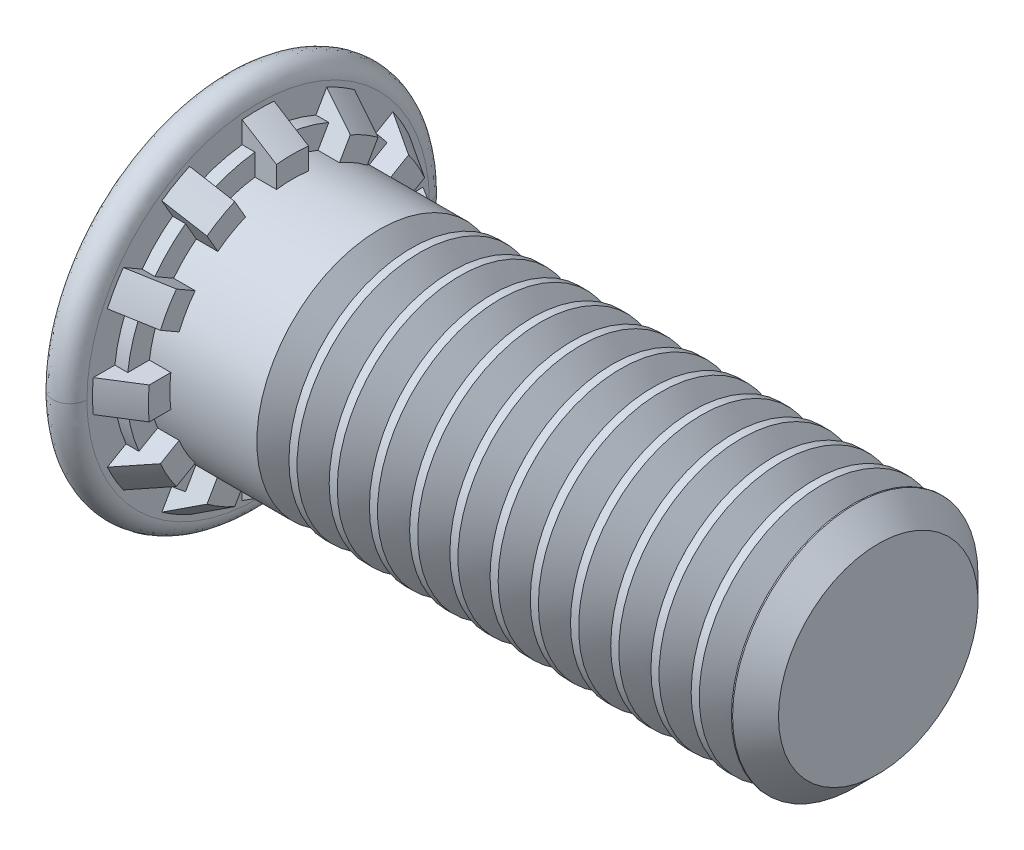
ISO-10303-21;
HEADER;
FILE_DESCRIPTION(('STEP AP214'),'2;1');
FILE_NAME('part.step','',(''),(''),'','','');
FILE_SCHEMA(('AUTOMOTIVE_DESIGN { 1 0 10303 214 1 1 1 1 }'));
ENDSEC;
DATA;
#1=APPLICATION_CONTEXT('core data for automotive mechanical design processes');
#2=APPLICATION_PROTOCOL_DEFINITION('international standard','automotive_design',2000,#1);
#3=PRODUCT_CONTEXT('',#1,'mechanical');
#4=PRODUCT('Part','Part','',(#3));
#5=PRODUCT_RELATED_PRODUCT_CATEGORY('part','',(#4));
#6=PRODUCT_DEFINITION_FORMATION('','',#4);
#7=PRODUCT_DEFINITION_CONTEXT('part definition',#1,'design');
#8=PRODUCT_DEFINITION('design','',#6,#7);
#9=PRODUCT_DEFINITION_SHAPE('','',#8);
#10=(LENGTH_UNIT() NAMED_UNIT(*) SI_UNIT(.MILLI.,.METRE.));
#11=(NAMED_UNIT(*) PLANE_ANGLE_UNIT() SI_UNIT($,.RADIAN.));
#12=(NAMED_UNIT(*) SI_UNIT($,.STERADIAN.) SOLID_ANGLE_UNIT());
#13=UNCERTAINTY_MEASURE_WITH_UNIT(LENGTH_MEASURE(1.E-05),#10,'distance_accuracy_value','');
#14=(GEOMETRIC_REPRESENTATION_CONTEXT(3) GLOBAL_UNCERTAINTY_ASSIGNED_CONTEXT((#13)) GLOBAL_UNIT_ASSIGNED_CONTEXT((#10,
#11,#12)) REPRESENTATION_CONTEXT('',''));
#15=CARTESIAN_POINT('',(0.,0.,0.));
#16=DIRECTION('',(0.,0.,1.));
#17=DIRECTION('',(1.,0.,0.));
#18=AXIS2_PLACEMENT_3D('',#15,#16,#17);
#19=CARTESIAN_POINT('',(0.,-2.11250952,-2.11250952));
#20=DIRECTION('',(-1.,0.,0.));
#21=DIRECTION('',(0.,0.,1.));
#22=AXIS2_PLACEMENT_3D('',#19,#20,#21);
#23=PLANE('',#22);
#24=CARTESIAN_POINT('',(0.,0.,0.));
#25=DIRECTION('',(-1.,0.,0.));
#26=DIRECTION('',(0.,0.,1.));
#27=AXIS2_PLACEMENT_3D('',#24,#25,#26);
#28=CIRCLE('',#27,2.08746);
#29=CARTESIAN_POINT('',(0.,0.,2.08746));
#30=VERTEX_POINT('',#29);
#31=EDGE_CURVE('E20',#30,#30,#28,.T.);
#32=ORIENTED_EDGE('',*,*,#31,.T.);
#33=EDGE_LOOP('',(#32));
#34=FACE_BOUND('',#33,.T.);
#35=ADVANCED_FACE('F16',(#34),#23,.T.);
#36=CARTESIAN_POINT('',(0.00508,0.,0.));
#37=DIRECTION('',(-1.,0.,0.));
#38=DIRECTION('',(0.,0.,1.));
#39=AXIS2_PLACEMENT_3D('',#36,#37,#38);
#40=CYLINDRICAL_SURFACE('',#39,2.08746);
#41=ORIENTED_EDGE('',*,*,#31,.F.);
#42=EDGE_LOOP('',(#41));
#43=FACE_BOUND('',#42,.T.);
#44=CARTESIAN_POINT('',(0.00508,0.,0.));
#45=DIRECTION('',(-1.,0.,0.));
#46=DIRECTION('',(0.,0.,1.));
#47=AXIS2_PLACEMENT_3D('',#44,#45,#46);
#48=CIRCLE('',#47,2.08746);
#49=CARTESIAN_POINT('',(0.00508,0.,2.08746));
#50=VERTEX_POINT('',#49);
#51=EDGE_CURVE('E1313',#50,#50,#48,.T.);
#52=ORIENTED_EDGE('',*,*,#51,.T.);
#53=EDGE_LOOP('',(#52));
#54=FACE_BOUND('',#53,.T.);
#55=ADVANCED_FACE('F966',(#43,#54),#40,.T.);
#56=CARTESIAN_POINT('',(0.00508,-2.11765048,2.11765048));
#57=DIRECTION('',(1.,0.,0.));
#58=DIRECTION('',(0.,0.,-1.));
#59=AXIS2_PLACEMENT_3D('',#56,#57,#58);
#60=PLANE('',#59);
#61=ORIENTED_EDGE('',*,*,#51,.F.);
#62=EDGE_LOOP('',(#61));
#63=FACE_BOUND('',#62,.T.);
#64=CARTESIAN_POINT('',(0.00508000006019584,0.,2.09253999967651));
#65=CARTESIAN_POINT('',(0.00508000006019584,-4.18508000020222,2.09253999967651));
#66=CARTESIAN_POINT('',(0.00508000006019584,-4.18508000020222,-2.09253999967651));
#67=CARTESIAN_POINT('',(0.00508000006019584,0.,-2.09253999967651));
#68=(BOUNDED_CURVE() B_SPLINE_CURVE(3,(#64,#65,#66,#67),.UNSPECIFIED.,.F.,
.F.) B_SPLINE_CURVE_WITH_KNOTS((4,4),(0.,1.),
.UNSPECIFIED.) CURVE() GEOMETRIC_REPRESENTATION_ITEM() RATIONAL_B_SPLINE_CURVE((0.959415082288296,
0.319805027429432,0.319805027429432,0.959415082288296)) REPRESENTATION_ITEM(''));
#69=CARTESIAN_POINT('',(0.00508000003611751,0.,2.09253999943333));
#70=VERTEX_POINT('',#69);
#71=CARTESIAN_POINT('',(0.00508000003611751,0.,-2.09253999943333));
#72=VERTEX_POINT('',#71);
#73=EDGE_CURVE('E950',#70,#72,#68,.T.);
#74=ORIENTED_EDGE('',*,*,#73,.F.);
#75=CARTESIAN_POINT('',(0.00508000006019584,0.,-2.09253999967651));
#76=CARTESIAN_POINT('',(0.00508000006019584,4.18508000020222,-2.09253999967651));
#77=CARTESIAN_POINT('',(0.00508000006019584,4.18508000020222,2.09253999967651));
#78=CARTESIAN_POINT('',(0.00508000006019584,0.,2.09253999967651));
#79=(BOUNDED_CURVE() B_SPLINE_CURVE(3,(#75,#76,#77,#78),.UNSPECIFIED.,.F.,
.F.) B_SPLINE_CURVE_WITH_KNOTS((4,4),(0.,1.),
.UNSPECIFIED.) CURVE() GEOMETRIC_REPRESENTATION_ITEM() RATIONAL_B_SPLINE_CURVE((0.959415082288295,
0.319805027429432,0.319805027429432,0.959415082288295)) REPRESENTATION_ITEM(''));
#80=EDGE_CURVE('E938',#72,#70,#79,.T.);
#81=ORIENTED_EDGE('',*,*,#80,.F.);
#82=EDGE_LOOP('',(#74,#81));
#83=FACE_BOUND('',#82,.T.);
#84=ADVANCED_FACE('F956',(#63,#83),#60,.F.);
#85=CARTESIAN_POINT('',(0.006116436,0.,2.071828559));
#86=CARTESIAN_POINT('',(0.006116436,4.143657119,2.071828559));
#87=CARTESIAN_POINT('',(0.006116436,4.143657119,-2.071828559));
#88=CARTESIAN_POINT('',(0.006116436,0.,-2.071828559));
#89=CARTESIAN_POINT('',(-0.007000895,0.,2.202564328));
#90=CARTESIAN_POINT('',(-0.007000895,4.405128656,2.202564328));
#91=CARTESIAN_POINT('',(-0.007000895,4.405128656,-2.202564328));
#92=CARTESIAN_POINT('',(-0.007000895,0.,-2.202564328));
#93=CARTESIAN_POINT('',(0.081147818,0.,2.3));
#94=CARTESIAN_POINT('',(0.081147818,4.6,2.3));
#95=CARTESIAN_POINT('',(0.081147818,4.6,-2.3));
#96=CARTESIAN_POINT('',(0.081147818,0.,-2.3));
#97=CARTESIAN_POINT('',(0.21254,0.,2.3));
#98=CARTESIAN_POINT('',(0.21254,4.6,2.3));
#99=CARTESIAN_POINT('',(0.21254,4.6,-2.3));
#100=CARTESIAN_POINT('',(0.21254,0.,-2.3));
#101=CARTESIAN_POINT('',(0.343932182,0.,2.3));
#102=CARTESIAN_POINT('',(0.343932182,4.6,2.3));
#103=CARTESIAN_POINT('',(0.343932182,4.6,-2.3));
#104=CARTESIAN_POINT('',(0.343932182,0.,-2.3));
#105=CARTESIAN_POINT('',(0.432080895,0.,2.202564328));
#106=CARTESIAN_POINT('',(0.432080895,4.405128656,2.202564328));
#107=CARTESIAN_POINT('',(0.432080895,4.405128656,-2.202564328));
#108=CARTESIAN_POINT('',(0.432080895,0.,-2.202564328));
#109=CARTESIAN_POINT('',(0.418963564,0.,2.071828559));
#110=CARTESIAN_POINT('',(0.418963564,4.143657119,2.071828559));
#111=CARTESIAN_POINT('',(0.418963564,4.143657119,-2.071828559));
#112=CARTESIAN_POINT('',(0.418963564,0.,-2.071828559));
#113=(BOUNDED_SURFACE() B_SPLINE_SURFACE(3,3,((#85,#86,#87,#88),(#89,#90,#91,#92),(#93,#94,#95,
#96),(#97,#98,#99,#100),(#101,#102,#103,#104),(#105,#106,#107,#108),(#109,#110,#111,#112)),
.UNSPECIFIED.,.F.,.F.,.F.) B_SPLINE_SURFACE_WITH_KNOTS((4,3,4),(4,4),(0.,0.5,1.),(0.,1.),
.UNSPECIFIED.) GEOMETRIC_REPRESENTATION_ITEM() RATIONAL_B_SPLINE_SURFACE(((1.,0.333333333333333,
0.333333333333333,1.),(0.780588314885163,0.260196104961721,0.260196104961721,0.780588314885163),
(0.780588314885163,0.260196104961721,0.260196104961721,0.780588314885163),(1.,0.333333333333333,
0.333333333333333,1.),(0.780588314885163,0.260196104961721,0.260196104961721,0.780588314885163),
(0.780588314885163,0.260196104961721,0.260196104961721,0.780588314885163),(1.,0.333333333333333,
0.333333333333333,1.))) REPRESENTATION_ITEM('') SURFACE());
#114=CARTESIAN_POINT('',(0.006116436,0.,2.071828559));
#115=CARTESIAN_POINT('',(-0.007000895,0.,2.202564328));
#116=CARTESIAN_POINT('',(0.081147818,0.,2.3));
#117=CARTESIAN_POINT('',(0.21254,0.,2.3));
#118=CARTESIAN_POINT('',(0.343932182,0.,2.3));
#119=CARTESIAN_POINT('',(0.432080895,0.,2.202564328));
#120=CARTESIAN_POINT('',(0.418963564,0.,2.071828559));
#121=(BOUNDED_CURVE() B_SPLINE_CURVE(3,(#114,#115,#116,#117,#118,#119,#120),.UNSPECIFIED.,.F.,
.F.) B_SPLINE_CURVE_WITH_KNOTS((4,3,4),(0.,0.5,1.),
.UNSPECIFIED.) CURVE() GEOMETRIC_REPRESENTATION_ITEM() RATIONAL_B_SPLINE_CURVE((1.,
0.780588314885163,0.780588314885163,1.,0.780588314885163,0.780588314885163,1.)) REPRESENTATION_ITEM(''));
#122=CARTESIAN_POINT('',(0.419999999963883,0.,2.09253999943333));
#123=VERTEX_POINT('',#122);
#124=EDGE_CURVE('E2606',#123,#70,#121,.F.);
#125=CARTESIAN_POINT('',(0.419999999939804,0.,2.09253999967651));
#126=CARTESIAN_POINT('',(0.419999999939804,4.18508000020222,2.09253999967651));
#127=CARTESIAN_POINT('',(0.419999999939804,4.18508000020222,-2.09253999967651));
#128=CARTESIAN_POINT('',(0.419999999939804,0.,-2.09253999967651));
#129=(BOUNDED_CURVE() B_SPLINE_CURVE(3,(#125,#126,#127,#128),.UNSPECIFIED.,.F.,
.F.) B_SPLINE_CURVE_WITH_KNOTS((4,4),(0.,1.),
.UNSPECIFIED.) CURVE() GEOMETRIC_REPRESENTATION_ITEM() RATIONAL_B_SPLINE_CURVE((0.959415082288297,
0.319805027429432,0.319805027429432,0.959415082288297)) REPRESENTATION_ITEM(''));
#130=CARTESIAN_POINT('',(0.419999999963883,0.,-2.09253999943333));
#131=VERTEX_POINT('',#130);
#132=EDGE_CURVE('E981',#131,#123,#129,.F.);
#133=CARTESIAN_POINT('',(0.006116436,0.,-2.071828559));
#134=CARTESIAN_POINT('',(-0.007000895,0.,-2.202564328));
#135=CARTESIAN_POINT('',(0.081147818,0.,-2.3));
#136=CARTESIAN_POINT('',(0.21254,0.,-2.3));
#137=CARTESIAN_POINT('',(0.343932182,0.,-2.3));
#138=CARTESIAN_POINT('',(0.432080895,0.,-2.202564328));
#139=CARTESIAN_POINT('',(0.418963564,0.,-2.071828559));
#140=(BOUNDED_CURVE() B_SPLINE_CURVE(3,(#133,#134,#135,#136,#137,#138,#139),.UNSPECIFIED.,.F.,
.F.) B_SPLINE_CURVE_WITH_KNOTS((4,3,4),(0.,0.5,1.),
.UNSPECIFIED.) CURVE() GEOMETRIC_REPRESENTATION_ITEM() RATIONAL_B_SPLINE_CURVE((1.,
0.780588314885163,0.780588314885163,1.,0.780588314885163,0.780588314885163,1.)) REPRESENTATION_ITEM(''));
#141=EDGE_CURVE('E892',#72,#131,#140,.T.);
#142=ORIENTED_EDGE('',*,*,#80,.T.);
#143=ORIENTED_EDGE('',*,*,#124,.F.);
#144=ORIENTED_EDGE('',*,*,#132,.F.);
#145=ORIENTED_EDGE('',*,*,#141,.F.);
#146=EDGE_LOOP('',(#142,#143,#144,#145));
#147=FACE_BOUND('',#146,.T.);
#148=ADVANCED_FACE('F907',(#147),#113,.T.);
#149=CARTESIAN_POINT('',(0.006116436,0.,-2.071828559));
#150=CARTESIAN_POINT('',(0.006116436,-4.143657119,-2.071828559));
#151=CARTESIAN_POINT('',(0.006116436,-4.143657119,2.071828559));
#152=CARTESIAN_POINT('',(0.006116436,0.,2.071828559));
#153=CARTESIAN_POINT('',(-0.007000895,0.,-2.202564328));
#154=CARTESIAN_POINT('',(-0.007000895,-4.405128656,-2.202564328));
#155=CARTESIAN_POINT('',(-0.007000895,-4.405128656,2.202564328));
#156=CARTESIAN_POINT('',(-0.007000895,0.,2.202564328));
#157=CARTESIAN_POINT('',(0.081147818,0.,-2.3));
#158=CARTESIAN_POINT('',(0.081147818,-4.6,-2.3));
#159=CARTESIAN_POINT('',(0.081147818,-4.6,2.3));
#160=CARTESIAN_POINT('',(0.081147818,0.,2.3));
#161=CARTESIAN_POINT('',(0.21254,0.,-2.3));
#162=CARTESIAN_POINT('',(0.21254,-4.6,-2.3));
#163=CARTESIAN_POINT('',(0.21254,-4.6,2.3));
#164=CARTESIAN_POINT('',(0.21254,0.,2.3));
#165=CARTESIAN_POINT('',(0.343932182,0.,-2.3));
#166=CARTESIAN_POINT('',(0.343932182,-4.6,-2.3));
#167=CARTESIAN_POINT('',(0.343932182,-4.6,2.3));
#168=CARTESIAN_POINT('',(0.343932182,0.,2.3));
#169=CARTESIAN_POINT('',(0.432080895,0.,-2.202564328));
#170=CARTESIAN_POINT('',(0.432080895,-4.405128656,-2.202564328));
#171=CARTESIAN_POINT('',(0.432080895,-4.405128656,2.202564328));
#172=CARTESIAN_POINT('',(0.432080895,0.,2.202564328));
#173=CARTESIAN_POINT('',(0.418963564,0.,-2.071828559));
#174=CARTESIAN_POINT('',(0.418963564,-4.143657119,-2.071828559));
#175=CARTESIAN_POINT('',(0.418963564,-4.143657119,2.071828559));
#176=CARTESIAN_POINT('',(0.418963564,0.,2.071828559));
#177=(BOUNDED_SURFACE() B_SPLINE_SURFACE(3,3,((#149,#150,#151,#152),(#153,#154,#155,#156),(#157,
#158,#159,#160),(#161,#162,#163,#164),(#165,#166,#167,#168),(#169,#170,#171,#172),(#173,#174,
#175,#176)),.UNSPECIFIED.,.F.,.F.,.F.) B_SPLINE_SURFACE_WITH_KNOTS((4,3,4),(4,4),(0.,0.5,1.),
(0.,1.),.UNSPECIFIED.) GEOMETRIC_REPRESENTATION_ITEM() RATIONAL_B_SPLINE_SURFACE(((1.,
0.333333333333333,0.333333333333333,1.),(0.780588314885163,0.260196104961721,0.260196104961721,
0.780588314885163),(0.780588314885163,0.260196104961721,0.260196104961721,0.780588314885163),
(1.,0.333333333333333,0.333333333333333,1.),(0.780588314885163,0.260196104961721,
0.260196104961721,0.780588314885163),(0.780588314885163,0.260196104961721,0.260196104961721,
0.780588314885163),(1.,0.333333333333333,0.333333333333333,1.))) REPRESENTATION_ITEM('') SURFACE());
#178=CARTESIAN_POINT('',(0.419999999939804,0.,-2.09253999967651));
#179=CARTESIAN_POINT('',(0.419999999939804,-4.18508000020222,-2.09253999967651));
#180=CARTESIAN_POINT('',(0.419999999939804,-4.18508000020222,2.09253999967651));
#181=CARTESIAN_POINT('',(0.419999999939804,0.,2.09253999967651));
#182=(BOUNDED_CURVE() B_SPLINE_CURVE(3,(#178,#179,#180,#181),.UNSPECIFIED.,.F.,
.F.) B_SPLINE_CURVE_WITH_KNOTS((4,4),(0.,1.),
.UNSPECIFIED.) CURVE() GEOMETRIC_REPRESENTATION_ITEM() RATIONAL_B_SPLINE_CURVE((0.959415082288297,
0.319805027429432,0.319805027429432,0.959415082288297)) REPRESENTATION_ITEM(''));
#183=EDGE_CURVE('E480',#123,#131,#182,.F.);
#184=ORIENTED_EDGE('',*,*,#124,.T.);
#185=ORIENTED_EDGE('',*,*,#73,.T.);
#186=ORIENTED_EDGE('',*,*,#141,.T.);
#187=ORIENTED_EDGE('',*,*,#183,.F.);
#188=EDGE_LOOP('',(#184,#185,#186,#187));
#189=FACE_BOUND('',#188,.T.);
#190=ADVANCED_FACE('F894',(#189),#177,.T.);
#191=CARTESIAN_POINT('',(0.42,0.,0.));
#192=DIRECTION('',(1.,0.,0.));
#193=DIRECTION('',(0.,1.,0.));
#194=AXIS2_PLACEMENT_3D('',#191,#192,#193);
#195=CYLINDRICAL_SURFACE('',#194,1.7625);
#196=DIRECTION('',(-1.,0.,0.));
#197=VECTOR('',#196,1.);
#198=CARTESIAN_POINT('',(0.63,-0.706237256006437,-1.61481738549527));
#199=LINE('',#198,#197);
#200=CARTESIAN_POINT('',(0.5775,-0.706237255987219,-1.61481738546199));
#201=VERTEX_POINT('',#200);
#202=CARTESIAN_POINT('',(0.42,-0.706237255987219,-1.61481738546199));
#203=VERTEX_POINT('',#202);
#204=EDGE_CURVE('E759',#201,#203,#199,.T.);
#205=ORIENTED_EDGE('',*,*,#204,.T.);
#206=CARTESIAN_POINT('',(0.42,0.,0.));
#207=DIRECTION('',(1.,0.,0.));
#208=DIRECTION('',(0.,1.,0.));
#209=AXIS2_PLACEMENT_3D('',#206,#207,#208);
#210=CIRCLE('',#209,1.7625);
#211=CARTESIAN_POINT('',(0.42,-0.195789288,-1.75159150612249));
#212=VERTEX_POINT('',#211);
#213=EDGE_CURVE('E1310',#212,#203,#210,.F.);
#214=ORIENTED_EDGE('',*,*,#213,.F.);
#215=DIRECTION('',(1.,0.,0.));
#216=VECTOR('',#215,1.);
#217=CARTESIAN_POINT('',(0.63,-0.195789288,-1.75159150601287));
#218=LINE('',#217,#216);
#219=CARTESIAN_POINT('',(0.5775,-0.195789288,-1.75159150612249));
#220=VERTEX_POINT('',#219);
#221=EDGE_CURVE('E875',#212,#220,#218,.T.);
#222=ORIENTED_EDGE('',*,*,#221,.T.);
#223=CARTESIAN_POINT('',(0.5775,0.,0.));
#224=DIRECTION('',(1.,0.,0.));
#225=DIRECTION('',(0.,1.,0.));
#226=AXIS2_PLACEMENT_3D('',#223,#224,#225);
#227=CIRCLE('',#226,1.7625);
#228=EDGE_CURVE('E763',#201,#220,#227,.T.);
#229=ORIENTED_EDGE('',*,*,#228,.F.);
#230=EDGE_LOOP('',(#205,#214,#222,#229));
#231=FACE_BOUND('',#230,.T.);
#232=ADVANCED_FACE('F906',(#231),#195,.T.);
#233=CARTESIAN_POINT('',(0.84,0.,0.));
#234=DIRECTION('',(-1.,0.,0.));
#235=DIRECTION('',(0.,-1.,0.));
#236=AXIS2_PLACEMENT_3D('',#233,#234,#235);
#237=CONICAL_SURFACE('',#236,1.7625,0.558599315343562);
#238=CARTESIAN_POINT('',(0.420000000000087,0.,0.));
#239=DIRECTION('',(-1.,0.,0.));
#240=DIRECTION('',(0.,-1.,0.));
#241=AXIS2_PLACEMENT_3D('',#238,#239,#240);
#242=CIRCLE('',#241,2.02499999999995);
#243=CARTESIAN_POINT('',(0.420000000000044,-0.838197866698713,-1.84337986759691));
#244=VERTEX_POINT('',#243);
#245=CARTESIAN_POINT('',(0.419999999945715,-1.17731486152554,-1.64759057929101));
#246=VERTEX_POINT('',#245);
#247=EDGE_CURVE('E1307',#244,#246,#242,.T.);
#248=ORIENTED_EDGE('',*,*,#247,.F.);
#249=CARTESIAN_POINT('',(0.419999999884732,-0.838197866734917,-1.84337986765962));
#250=CARTESIAN_POINT('',(0.49001491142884,-0.816216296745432,-1.80530667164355));
#251=CARTESIAN_POINT('',(0.560022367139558,-0.794228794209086,-1.76722320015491));
#252=CARTESIAN_POINT('',(0.700022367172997,-0.750241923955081,-1.69103570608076));
#253=CARTESIAN_POINT('',(0.770014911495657,-0.728242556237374,-1.65293168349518));
#254=CARTESIAN_POINT('',(0.839999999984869,-0.706237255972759,-1.61481738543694));
#255=B_SPLINE_CURVE_WITH_KNOTS('',3,(#249,#250,#251,#252,#253,#254),.UNSPECIFIED.,.F.,.F.,(4,2,
4),(0.,0.248019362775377,0.49603872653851),.UNSPECIFIED.);
#256=CARTESIAN_POINT('',(0.839999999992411,-0.706237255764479,-1.61481738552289));
#257=VERTEX_POINT('',#256);
#258=EDGE_CURVE('E873',#244,#257,#255,.T.);
#259=ORIENTED_EDGE('',*,*,#258,.T.);
#260=CARTESIAN_POINT('',(0.839999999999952,0.,0.));
#261=DIRECTION('',(-1.,0.,0.));
#262=DIRECTION('',(0.,-1.,0.));
#263=AXIS2_PLACEMENT_3D('',#260,#261,#262);
#264=CIRCLE('',#263,1.76250000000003);
#265=CARTESIAN_POINT('',(0.839999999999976,-1.04535425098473,-1.41902809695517));
#266=VERTEX_POINT('',#265);
#267=EDGE_CURVE('E752',#266,#257,#264,.F.);
#268=ORIENTED_EDGE('',*,*,#267,.F.);
#269=CARTESIAN_POINT('',(0.839999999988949,-1.0453542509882,-1.41902809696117));
#270=CARTESIAN_POINT('',(0.770014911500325,-1.06735955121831,-1.45714239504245));
#271=CARTESIAN_POINT('',(0.700022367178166,-1.08935891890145,-1.49524641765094));
#272=CARTESIAN_POINT('',(0.560022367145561,-1.13334578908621,-1.57143391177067));
#273=CARTESIAN_POINT('',(0.490014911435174,-1.15533329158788,-1.60951738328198));
#274=CARTESIAN_POINT('',(0.419999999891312,-1.17731486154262,-1.6475905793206));
#275=B_SPLINE_CURVE_WITH_KNOTS('',3,(#269,#270,#271,#272,#273,#274),.UNSPECIFIED.,.F.,.F.,(4,2,
4),(0.,0.248019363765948,0.49603872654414),.UNSPECIFIED.);
#276=EDGE_CURVE('E751',#266,#246,#275,.T.);
#277=ORIENTED_EDGE('',*,*,#276,.T.);
#278=EDGE_LOOP('',(#248,#259,#268,#277));
#279=FACE_BOUND('',#278,.T.);
#280=ADVANCED_FACE('F1364',(#279),#237,.T.);
#281=CARTESIAN_POINT('',(0.42,0.,0.));
#282=DIRECTION('',(1.,0.,0.));
#283=DIRECTION('',(0.,1.,0.));
#284=AXIS2_PLACEMENT_3D('',#281,#282,#283);
#285=CYLINDRICAL_SURFACE('',#284,1.7625);
#286=DIRECTION('',(-1.,0.,0.));
#287=VECTOR('',#286,1.);
#288=CARTESIAN_POINT('',(0.63,-1.41902809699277,-1.04535425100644));
#289=LINE('',#288,#287);
#290=CARTESIAN_POINT('',(0.5775,-1.41902809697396,-1.04535425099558));
#291=VERTEX_POINT('',#290);
#292=CARTESIAN_POINT('',(0.42,-1.41902809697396,-1.04535425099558));
#293=VERTEX_POINT('',#292);
#294=EDGE_CURVE('E740',#291,#293,#289,.T.);
#295=ORIENTED_EDGE('',*,*,#294,.T.);
#296=CARTESIAN_POINT('',(0.42,0.,0.));
#297=DIRECTION('',(1.,0.,0.));
#298=DIRECTION('',(0.,1.,0.));
#299=AXIS2_PLACEMENT_3D('',#296,#297,#298);
#300=CIRCLE('',#299,1.7625);
#301=CARTESIAN_POINT('',(0.42,-1.04535425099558,-1.41902809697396));
#302=VERTEX_POINT('',#301);
#303=EDGE_CURVE('E1304',#302,#293,#300,.F.);
#304=ORIENTED_EDGE('',*,*,#303,.F.);
#305=DIRECTION('',(1.,0.,0.));
#306=VECTOR('',#305,1.);
#307=CARTESIAN_POINT('',(0.63,-1.04535425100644,-1.41902809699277));
#308=LINE('',#307,#306);
#309=CARTESIAN_POINT('',(0.5775,-1.04535425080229,-1.41902809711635));
#310=VERTEX_POINT('',#309);
#311=EDGE_CURVE('E865',#302,#310,#308,.T.);
#312=ORIENTED_EDGE('',*,*,#311,.T.);
#313=CARTESIAN_POINT('',(0.5775,0.,0.));
#314=DIRECTION('',(1.,0.,0.));
#315=DIRECTION('',(0.,1.,0.));
#316=AXIS2_PLACEMENT_3D('',#313,#314,#315);
#317=CIRCLE('',#316,1.7625);
#318=EDGE_CURVE('E744',#291,#310,#317,.T.);
#319=ORIENTED_EDGE('',*,*,#318,.F.);
#320=EDGE_LOOP('',(#295,#304,#312,#319));
#321=FACE_BOUND('',#320,.T.);
#322=ADVANCED_FACE('F1373',(#321),#285,.T.);
#323=CARTESIAN_POINT('',(0.84,0.,0.));
#324=DIRECTION('',(-1.,0.,0.));
#325=DIRECTION('',(0.,-1.,0.));
#326=AXIS2_PLACEMENT_3D('',#323,#324,#325);
#327=CONICAL_SURFACE('',#326,1.7625,0.558599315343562);
#328=CARTESIAN_POINT('',(0.420000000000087,0.,0.));
#329=DIRECTION('',(-1.,0.,0.));
#330=DIRECTION('',(0.,-1.,0.));
#331=AXIS2_PLACEMENT_3D('',#328,#329,#330);
#332=CIRCLE('',#331,2.02499999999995);
#333=CARTESIAN_POINT('',(0.420000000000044,-1.64759057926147,-1.17731486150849));
#334=VERTEX_POINT('',#333);
#335=CARTESIAN_POINT('',(0.419999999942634,-1.84337986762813,-0.838197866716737));
#336=VERTEX_POINT('',#335);
#337=EDGE_CURVE('E1301',#334,#336,#332,.T.);
#338=ORIENTED_EDGE('',*,*,#337,.F.);
#339=CARTESIAN_POINT('',(0.419999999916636,-1.64759057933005,-1.17731486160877));
#340=CARTESIAN_POINT('',(0.490014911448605,-1.60951738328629,-1.15533329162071));
#341=CARTESIAN_POINT('',(0.56002236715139,-1.57143391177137,-1.13334578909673));
#342=CARTESIAN_POINT('',(0.700022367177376,-1.4952464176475,-1.08935891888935));
#343=CARTESIAN_POINT('',(0.770014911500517,-1.45714239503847,-1.0673595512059));
#344=CARTESIAN_POINT('',(0.839999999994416,-1.4190280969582,-1.04535425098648));
#345=B_SPLINE_CURVE_WITH_KNOTS('',3,(#339,#340,#341,#342,#343,#344),.UNSPECIFIED.,.F.,.F.,(4,2,
4),(0.,0.248019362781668,0.4960387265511),.UNSPECIFIED.);
#346=CARTESIAN_POINT('',(0.839999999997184,-1.41902809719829,-1.04535425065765));
#347=VERTEX_POINT('',#346);
#348=EDGE_CURVE('E863',#334,#347,#345,.T.);
#349=ORIENTED_EDGE('',*,*,#348,.T.);
#350=CARTESIAN_POINT('',(0.839999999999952,0.,0.));
#351=DIRECTION('',(-1.,0.,0.));
#352=DIRECTION('',(0.,-1.,0.));
#353=AXIS2_PLACEMENT_3D('',#350,#351,#352);
#354=CIRCLE('',#353,1.76250000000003);
#355=CARTESIAN_POINT('',(0.839999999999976,-1.61481738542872,-0.706237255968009));
#356=VERTEX_POINT('',#355);
#357=EDGE_CURVE('E2430',#356,#347,#354,.F.);
#358=ORIENTED_EDGE('',*,*,#357,.F.);
#359=CARTESIAN_POINT('',(0.839999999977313,-1.61481738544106,-0.706237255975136));
#360=CARTESIAN_POINT('',(0.770014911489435,-1.65293168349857,-0.72824255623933));
#361=CARTESIAN_POINT('',(0.700022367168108,-1.69103570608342,-0.750241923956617));
#362=CARTESIAN_POINT('',(0.560022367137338,-1.76722320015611,-0.794228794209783));
#363=CARTESIAN_POINT('',(0.490014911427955,-1.80530667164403,-0.81621629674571));
#364=CARTESIAN_POINT('',(0.419999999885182,-1.84337986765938,-0.838197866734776));
#365=B_SPLINE_CURVE_WITH_KNOTS('',3,(#359,#360,#361,#362,#363,#364),.UNSPECIFIED.,.F.,.F.,(4,2,
4),(0.,0.248019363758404,0.496038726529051),.UNSPECIFIED.);
#366=EDGE_CURVE('E732',#356,#336,#365,.T.);
#367=ORIENTED_EDGE('',*,*,#366,.T.);
#368=EDGE_LOOP('',(#338,#349,#358,#367));
#369=FACE_BOUND('',#368,.T.);
#370=ADVANCED_FACE('F1382',(#369),#327,.T.);
#371=CARTESIAN_POINT('',(0.42,0.,0.));
#372=DIRECTION('',(1.,0.,0.));
#373=DIRECTION('',(0.,1.,0.));
#374=AXIS2_PLACEMENT_3D('',#371,#372,#373);
#375=CYLINDRICAL_SURFACE('',#374,1.7625);
#376=DIRECTION('',(-1.,0.,0.));
#377=VECTOR('',#376,1.);
#378=CARTESIAN_POINT('',(0.63,-1.75159150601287,-0.195789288));
#379=LINE('',#378,#377);
#380=CARTESIAN_POINT('',(0.5775,-1.75159150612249,-0.195789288));
#381=VERTEX_POINT('',#380);
#382=CARTESIAN_POINT('',(0.42,-1.75159150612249,-0.195789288));
#383=VERTEX_POINT('',#382);
#384=EDGE_CURVE('E721',#381,#383,#379,.T.);
#385=ORIENTED_EDGE('',*,*,#384,.T.);
#386=CARTESIAN_POINT('',(0.42,0.,0.));
#387=DIRECTION('',(1.,0.,0.));
#388=DIRECTION('',(0.,1.,0.));
#389=AXIS2_PLACEMENT_3D('',#386,#387,#388);
#390=CIRCLE('',#389,1.7625);
#391=CARTESIAN_POINT('',(0.42,-1.61481738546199,-0.706237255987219));
#392=VERTEX_POINT('',#391);
#393=EDGE_CURVE('E1298',#392,#383,#390,.F.);
#394=ORIENTED_EDGE('',*,*,#393,.F.);
#395=DIRECTION('',(1.,0.,0.));
#396=VECTOR('',#395,1.);
#397=CARTESIAN_POINT('',(0.63,-1.61481738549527,-0.706237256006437));
#398=LINE('',#397,#396);
#399=CARTESIAN_POINT('',(0.5775,-1.61481738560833,-0.706237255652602));
#400=VERTEX_POINT('',#399);
#401=EDGE_CURVE('E855',#392,#400,#398,.T.);
#402=ORIENTED_EDGE('',*,*,#401,.T.);
#403=CARTESIAN_POINT('',(0.5775,0.,0.));
#404=DIRECTION('',(1.,0.,0.));
#405=DIRECTION('',(0.,1.,0.));
#406=AXIS2_PLACEMENT_3D('',#403,#404,#405);
#407=CIRCLE('',#406,1.7625);
#408=EDGE_CURVE('E725',#381,#400,#407,.T.);
#409=ORIENTED_EDGE('',*,*,#408,.F.);
#410=EDGE_LOOP('',(#385,#394,#402,#409));
#411=FACE_BOUND('',#410,.T.);
#412=ADVANCED_FACE('F1392',(#411),#375,.T.);
#413=CARTESIAN_POINT('',(0.84,0.,0.));
#414=DIRECTION('',(-1.,0.,0.));
#415=DIRECTION('',(0.,-1.,0.));
#416=AXIS2_PLACEMENT_3D('',#413,#414,#415);
#417=CONICAL_SURFACE('',#416,1.7625,0.558599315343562);
#418=CARTESIAN_POINT('',(0.420000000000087,0.,0.));
#419=DIRECTION('',(-1.,0.,0.));
#420=DIRECTION('',(0.,-1.,0.));
#421=AXIS2_PLACEMENT_3D('',#418,#419,#420);
#422=CIRCLE('',#421,2.02499999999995);
#423=CARTESIAN_POINT('',(0.420000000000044,-2.01551272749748,-0.195789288));
#424=VERTEX_POINT('',#423);
#425=CARTESIAN_POINT('',(0.419999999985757,-2.01551272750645,0.195789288));
#426=VERTEX_POINT('',#425);
#427=EDGE_CURVE('E1295',#424,#426,#422,.T.);
#428=ORIENTED_EDGE('',*,*,#427,.F.);
#429=CARTESIAN_POINT('',(0.419999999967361,-2.01551272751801,-0.195789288));
#430=CARTESIAN_POINT('',(0.490014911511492,-1.97154958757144,-0.195789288));
#431=CARTESIAN_POINT('',(0.560022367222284,-1.92757458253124,-0.195789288));
#432=CARTESIAN_POINT('',(0.700022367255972,-1.8396008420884,-0.195789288));
#433=CARTESIAN_POINT('',(0.770014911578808,-1.79560210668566,-0.195789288));
#434=CARTESIAN_POINT('',(0.840000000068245,-1.75159150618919,-0.195789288));
#435=B_SPLINE_CURVE_WITH_KNOTS('',3,(#429,#430,#431,#432,#433,#434),.UNSPECIFIED.,.F.,.F.,(4,2,
4),(0.,0.248019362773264,0.496038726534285),.UNSPECIFIED.);
#436=CARTESIAN_POINT('',(0.840000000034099,-1.75159150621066,-0.195789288));
#437=VERTEX_POINT('',#436);
#438=EDGE_CURVE('E853',#424,#437,#435,.T.);
#439=ORIENTED_EDGE('',*,*,#438,.T.);
#440=CARTESIAN_POINT('',(0.839999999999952,0.,0.));
#441=DIRECTION('',(-1.,0.,0.));
#442=DIRECTION('',(0.,-1.,0.));
#443=AXIS2_PLACEMENT_3D('',#440,#441,#442);
#444=CIRCLE('',#443,1.76250000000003);
#445=CARTESIAN_POINT('',(0.839999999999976,-1.75159150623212,0.195789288));
#446=VERTEX_POINT('',#445);
#447=EDGE_CURVE('E714',#446,#437,#444,.F.);
#448=ORIENTED_EDGE('',*,*,#447,.F.);
#449=CARTESIAN_POINT('',(0.840000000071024,-1.75159150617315,0.195789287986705));
#450=CARTESIAN_POINT('',(0.770014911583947,-1.79560210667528,0.195789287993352));
#451=CARTESIAN_POINT('',(0.700022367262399,-1.83960084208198,0.195789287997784));
#452=CARTESIAN_POINT('',(0.560022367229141,-1.92757458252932,0.195789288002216));
#453=CARTESIAN_POINT('',(0.49001491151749,-1.97154958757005,0.195789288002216));
#454=CARTESIAN_POINT('',(0.419999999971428,-2.01551272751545,0.195789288));
#455=B_SPLINE_CURVE_WITH_KNOTS('',3,(#449,#450,#451,#452,#453,#454),.UNSPECIFIED.,.F.,.F.,(4,2,
4),(0.,0.248019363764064,0.49603872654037),.UNSPECIFIED.);
#456=EDGE_CURVE('E710',#446,#426,#455,.T.);
#457=ORIENTED_EDGE('',*,*,#456,.T.);
#458=EDGE_LOOP('',(#428,#439,#448,#457));
#459=FACE_BOUND('',#458,.T.);
#460=ADVANCED_FACE('F1402',(#459),#417,.T.);
#461=CARTESIAN_POINT('',(0.42,0.,0.));
#462=DIRECTION('',(1.,0.,0.));
#463=DIRECTION('',(0.,1.,0.));
#464=AXIS2_PLACEMENT_3D('',#461,#462,#463);
#465=CYLINDRICAL_SURFACE('',#464,1.7625);
#466=DIRECTION('',(-1.,0.,0.));
#467=VECTOR('',#466,1.);
#468=CARTESIAN_POINT('',(0.63,-1.61481738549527,0.706237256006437));
#469=LINE('',#468,#467);
#470=CARTESIAN_POINT('',(0.5775,-1.61481738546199,0.706237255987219));
#471=VERTEX_POINT('',#470);
#472=CARTESIAN_POINT('',(0.42,-1.61481738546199,0.706237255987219));
#473=VERTEX_POINT('',#472);
#474=EDGE_CURVE('E699',#471,#473,#469,.T.);
#475=ORIENTED_EDGE('',*,*,#474,.T.);
#476=CARTESIAN_POINT('',(0.42,0.,0.));
#477=DIRECTION('',(1.,0.,0.));
#478=DIRECTION('',(0.,1.,0.));
#479=AXIS2_PLACEMENT_3D('',#476,#477,#478);
#480=CIRCLE('',#479,1.7625);
#481=CARTESIAN_POINT('',(0.42,-1.75159150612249,0.195789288));
#482=VERTEX_POINT('',#481);
#483=EDGE_CURVE('E1292',#482,#473,#480,.F.);
#484=ORIENTED_EDGE('',*,*,#483,.F.);
#485=DIRECTION('',(1.,0.,0.));
#486=VECTOR('',#485,1.);
#487=CARTESIAN_POINT('',(0.63,-1.75159150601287,0.195789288));
#488=LINE('',#487,#486);
#489=CARTESIAN_POINT('',(0.5775,-1.75159150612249,0.195789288));
#490=VERTEX_POINT('',#489);
#491=EDGE_CURVE('E845',#482,#490,#488,.T.);
#492=ORIENTED_EDGE('',*,*,#491,.T.);
#493=CARTESIAN_POINT('',(0.5775,0.,0.));
#494=DIRECTION('',(1.,0.,0.));
#495=DIRECTION('',(0.,1.,0.));
#496=AXIS2_PLACEMENT_3D('',#493,#494,#495);
#497=CIRCLE('',#496,1.7625);
#498=EDGE_CURVE('E703',#471,#490,#497,.T.);
#499=ORIENTED_EDGE('',*,*,#498,.F.);
#500=EDGE_LOOP('',(#475,#484,#492,#499));
#501=FACE_BOUND('',#500,.T.);
#502=ADVANCED_FACE('F1412',(#501),#465,.T.);
#503=CARTESIAN_POINT('',(0.84,0.,0.));
#504=DIRECTION('',(-1.,0.,0.));
#505=DIRECTION('',(0.,-1.,0.));
#506=AXIS2_PLACEMENT_3D('',#503,#504,#505);
#507=CONICAL_SURFACE('',#506,1.7625,0.558599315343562);
#508=CARTESIAN_POINT('',(0.420000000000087,0.,0.));
#509=DIRECTION('',(-1.,0.,0.));
#510=DIRECTION('',(0.,-1.,0.));
#511=AXIS2_PLACEMENT_3D('',#508,#509,#510);
#512=CIRCLE('',#511,2.02499999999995);
#513=CARTESIAN_POINT('',(0.420000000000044,-1.84337986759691,0.838197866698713));
#514=VERTEX_POINT('',#513);
#515=CARTESIAN_POINT('',(0.419999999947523,-1.64759057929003,1.17731486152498));
#516=VERTEX_POINT('',#515);
#517=EDGE_CURVE('E1289',#514,#516,#512,.T.);
#518=ORIENTED_EDGE('',*,*,#517,.F.);
#519=CARTESIAN_POINT('',(0.41999999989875,-1.843379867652,0.838197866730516));
#520=CARTESIAN_POINT('',(0.49001491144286,-1.80530667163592,0.816216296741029));
#521=CARTESIAN_POINT('',(0.56002236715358,-1.76722320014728,0.794228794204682));
#522=CARTESIAN_POINT('',(0.700022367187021,-1.69103570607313,0.750241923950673));
#523=CARTESIAN_POINT('',(0.770014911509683,-1.65293168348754,0.728242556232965));
#524=CARTESIAN_POINT('',(0.839999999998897,-1.6148173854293,0.706237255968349));
#525=B_SPLINE_CURVE_WITH_KNOTS('',3,(#519,#520,#521,#522,#523,#524),.UNSPECIFIED.,.F.,.F.,(4,2,
4),(0.,0.248019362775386,0.496038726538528),.UNSPECIFIED.);
#526=CARTESIAN_POINT('',(0.839999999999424,-1.61481738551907,0.706237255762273));
#527=VERTEX_POINT('',#526);
#528=EDGE_CURVE('E843',#514,#527,#525,.T.);
#529=ORIENTED_EDGE('',*,*,#528,.T.);
#530=CARTESIAN_POINT('',(0.839999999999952,0.,0.));
#531=DIRECTION('',(-1.,0.,0.));
#532=DIRECTION('',(0.,-1.,0.));
#533=AXIS2_PLACEMENT_3D('',#530,#531,#532);
#534=CIRCLE('',#533,1.76250000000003);
#535=CARTESIAN_POINT('',(0.839999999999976,-1.41902809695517,1.04535425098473));
#536=VERTEX_POINT('',#535);
#537=EDGE_CURVE('E2400',#536,#527,#534,.F.);
#538=ORIENTED_EDGE('',*,*,#537,.F.);
#539=CARTESIAN_POINT('',(0.839999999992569,-1.4190280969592,1.04535425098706));
#540=CARTESIAN_POINT('',(0.770014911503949,-1.45714239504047,1.06735955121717));
#541=CARTESIAN_POINT('',(0.700022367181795,-1.49524641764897,1.08935891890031));
#542=CARTESIAN_POINT('',(0.560022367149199,-1.57143391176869,1.13334578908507));
#543=CARTESIAN_POINT('',(0.490014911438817,-1.60951738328,1.15533329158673));
#544=CARTESIAN_POINT('',(0.419999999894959,-1.64759057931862,1.17731486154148));
#545=B_SPLINE_CURVE_WITH_KNOTS('',3,(#539,#540,#541,#542,#543,#544),.UNSPECIFIED.,.F.,.F.,(4,2,
4),(0.,0.248019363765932,0.496038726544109),.UNSPECIFIED.);
#546=EDGE_CURVE('E691',#536,#516,#545,.T.);
#547=ORIENTED_EDGE('',*,*,#546,.T.);
#548=EDGE_LOOP('',(#518,#529,#538,#547));
#549=FACE_BOUND('',#548,.T.);
#550=ADVANCED_FACE('F1422',(#549),#507,.T.);
#551=CARTESIAN_POINT('',(0.42,0.,0.));
#552=DIRECTION('',(1.,0.,0.));
#553=DIRECTION('',(0.,1.,0.));
#554=AXIS2_PLACEMENT_3D('',#551,#552,#553);
#555=CYLINDRICAL_SURFACE('',#554,1.7625);
#556=DIRECTION('',(-1.,0.,0.));
#557=VECTOR('',#556,1.);
#558=CARTESIAN_POINT('',(0.63,-1.04535425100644,1.41902809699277));
#559=LINE('',#558,#557);
#560=CARTESIAN_POINT('',(0.5775,-1.04535425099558,1.41902809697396));
#561=VERTEX_POINT('',#560);
#562=CARTESIAN_POINT('',(0.42,-1.04535425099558,1.41902809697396));
#563=VERTEX_POINT('',#562);
#564=EDGE_CURVE('E680',#561,#563,#559,.T.);
#565=ORIENTED_EDGE('',*,*,#564,.T.);
#566=CARTESIAN_POINT('',(0.42,0.,0.));
#567=DIRECTION('',(1.,0.,0.));
#568=DIRECTION('',(0.,1.,0.));
#569=AXIS2_PLACEMENT_3D('',#566,#567,#568);
#570=CIRCLE('',#569,1.7625);
#571=CARTESIAN_POINT('',(0.42,-1.41902809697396,1.04535425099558));
#572=VERTEX_POINT('',#571);
#573=EDGE_CURVE('E1286',#572,#563,#570,.F.);
#574=ORIENTED_EDGE('',*,*,#573,.F.);
#575=DIRECTION('',(1.,0.,0.));
#576=VECTOR('',#575,1.);
#577=CARTESIAN_POINT('',(0.63,-1.41902809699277,1.04535425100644));
#578=LINE('',#577,#576);
#579=CARTESIAN_POINT('',(0.5775,-1.41902809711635,1.04535425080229));
#580=VERTEX_POINT('',#579);
#581=EDGE_CURVE('E835',#572,#580,#578,.T.);
#582=ORIENTED_EDGE('',*,*,#581,.T.);
#583=CARTESIAN_POINT('',(0.5775,0.,0.));
#584=DIRECTION('',(1.,0.,0.));
#585=DIRECTION('',(0.,1.,0.));
#586=AXIS2_PLACEMENT_3D('',#583,#584,#585);
#587=CIRCLE('',#586,1.7625);
#588=EDGE_CURVE('E684',#561,#580,#587,.T.);
#589=ORIENTED_EDGE('',*,*,#588,.F.);
#590=EDGE_LOOP('',(#565,#574,#582,#589));
#591=FACE_BOUND('',#590,.T.);
#592=ADVANCED_FACE('F1432',(#591),#555,.T.);
#593=CARTESIAN_POINT('',(0.84,0.,0.));
#594=DIRECTION('',(-1.,0.,0.));
#595=DIRECTION('',(0.,-1.,0.));
#596=AXIS2_PLACEMENT_3D('',#593,#594,#595);
#597=CONICAL_SURFACE('',#596,1.7625,0.558599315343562);
#598=CARTESIAN_POINT('',(0.420000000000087,0.,0.));
#599=DIRECTION('',(-1.,0.,0.));
#600=DIRECTION('',(0.,-1.,0.));
#601=AXIS2_PLACEMENT_3D('',#598,#599,#600);
#602=CIRCLE('',#601,2.02499999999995);
#603=CARTESIAN_POINT('',(0.420000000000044,-1.17731486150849,1.64759057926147));
#604=VERTEX_POINT('',#603);
#605=CARTESIAN_POINT('',(0.419999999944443,-0.83819786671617,1.84337986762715));
#606=VERTEX_POINT('',#605);
#607=EDGE_CURVE('E1283',#604,#606,#602,.T.);
#608=ORIENTED_EDGE('',*,*,#607,.F.);
#609=CARTESIAN_POINT('',(0.41999999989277,-1.17731486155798,1.64759057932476));
#610=CARTESIAN_POINT('',(0.490014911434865,-1.15533329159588,1.60951738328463));
#611=CARTESIAN_POINT('',(0.560022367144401,-1.13334578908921,1.57143391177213));
#612=CARTESIAN_POINT('',(0.700022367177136,-1.08935891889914,1.49524641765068));
#613=CARTESIAN_POINT('',(0.770014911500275,-1.06735955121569,1.45714239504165));
#614=CARTESIAN_POINT('',(0.839999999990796,-1.04535425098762,1.41902809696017));
#615=B_SPLINE_CURVE_WITH_KNOTS('',3,(#609,#610,#611,#612,#613,#614),.UNSPECIFIED.,.F.,.F.,(4,2,
4),(0.,0.248019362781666,0.496038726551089),.UNSPECIFIED.);
#616=CARTESIAN_POINT('',(0.839999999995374,-1.04535425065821,1.41902809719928));
#617=VERTEX_POINT('',#616);
#618=EDGE_CURVE('E833',#604,#617,#615,.T.);
#619=ORIENTED_EDGE('',*,*,#618,.T.);
#620=CARTESIAN_POINT('',(0.839999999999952,0.,0.));
#621=DIRECTION('',(-1.,0.,0.));
#622=DIRECTION('',(0.,-1.,0.));
#623=AXIS2_PLACEMENT_3D('',#620,#621,#622);
#624=CIRCLE('',#623,1.76250000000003);
#625=CARTESIAN_POINT('',(0.839999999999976,-0.706237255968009,1.61481738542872));
#626=VERTEX_POINT('',#625);
#627=EDGE_CURVE('E673',#626,#617,#624,.F.);
#628=ORIENTED_EDGE('',*,*,#627,.F.);
#629=CARTESIAN_POINT('',(0.839999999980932,-0.706237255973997,1.61481738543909));
#630=CARTESIAN_POINT('',(0.770014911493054,-0.728242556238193,1.6529316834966));
#631=CARTESIAN_POINT('',(0.700022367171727,-0.75024192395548,1.69103570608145));
#632=CARTESIAN_POINT('',(0.560022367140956,-0.794228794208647,1.76722320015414));
#633=CARTESIAN_POINT('',(0.490014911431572,-0.816216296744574,1.80530667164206));
#634=CARTESIAN_POINT('',(0.419999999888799,-0.83819786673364,1.84337986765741));
#635=B_SPLINE_CURVE_WITH_KNOTS('',3,(#629,#630,#631,#632,#633,#634),.UNSPECIFIED.,.F.,.F.,(4,2,
4),(0.,0.248019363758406,0.496038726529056),.UNSPECIFIED.);
#636=EDGE_CURVE('E672',#626,#606,#635,.T.);
#637=ORIENTED_EDGE('',*,*,#636,.T.);
#638=EDGE_LOOP('',(#608,#619,#628,#637));
#639=FACE_BOUND('',#638,.T.);
#640=ADVANCED_FACE('F1442',(#639),#597,.T.);
#641=CARTESIAN_POINT('',(0.42,0.,0.));
#642=DIRECTION('',(1.,0.,0.));
#643=DIRECTION('',(0.,1.,0.));
#644=AXIS2_PLACEMENT_3D('',#641,#642,#643);
#645=CYLINDRICAL_SURFACE('',#644,1.7625);
#646=DIRECTION('',(-1.,0.,0.));
#647=VECTOR('',#646,1.);
#648=CARTESIAN_POINT('',(0.63,-0.195789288,1.75159150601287));
#649=LINE('',#648,#647);
#650=CARTESIAN_POINT('',(0.5775,-0.195789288,1.75159150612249));
#651=VERTEX_POINT('',#650);
#652=CARTESIAN_POINT('',(0.42,-0.195789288,1.75159150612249));
#653=VERTEX_POINT('',#652);
#654=EDGE_CURVE('E661',#651,#653,#649,.T.);
#655=ORIENTED_EDGE('',*,*,#654,.T.);
#656=CARTESIAN_POINT('',(0.42,0.,0.));
#657=DIRECTION('',(1.,0.,0.));
#658=DIRECTION('',(0.,1.,0.));
#659=AXIS2_PLACEMENT_3D('',#656,#657,#658);
#660=CIRCLE('',#659,1.7625);
#661=CARTESIAN_POINT('',(0.42,-0.706237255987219,1.61481738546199));
#662=VERTEX_POINT('',#661);
#663=EDGE_CURVE('E1280',#662,#653,#660,.F.);
#664=ORIENTED_EDGE('',*,*,#663,.F.);
#665=DIRECTION('',(1.,0.,0.));
#666=VECTOR('',#665,1.);
#667=CARTESIAN_POINT('',(0.63,-0.706237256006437,1.61481738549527));
#668=LINE('',#667,#666);
#669=CARTESIAN_POINT('',(0.5775,-0.706237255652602,1.61481738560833));
#670=VERTEX_POINT('',#669);
#671=EDGE_CURVE('E825',#662,#670,#668,.T.);
#672=ORIENTED_EDGE('',*,*,#671,.T.);
#673=CARTESIAN_POINT('',(0.5775,0.,0.));
#674=DIRECTION('',(1.,0.,0.));
#675=DIRECTION('',(0.,1.,0.));
#676=AXIS2_PLACEMENT_3D('',#673,#674,#675);
#677=CIRCLE('',#676,1.7625);
#678=EDGE_CURVE('E665',#651,#670,#677,.T.);
#679=ORIENTED_EDGE('',*,*,#678,.F.);
#680=EDGE_LOOP('',(#655,#664,#672,#679));
#681=FACE_BOUND('',#680,.T.);
#682=ADVANCED_FACE('F1452',(#681),#645,.T.);
#683=CARTESIAN_POINT('',(0.84,0.,0.));
#684=DIRECTION('',(-1.,0.,0.));
#685=DIRECTION('',(0.,-1.,0.));
#686=AXIS2_PLACEMENT_3D('',#683,#684,#685);
#687=CONICAL_SURFACE('',#686,1.7625,0.558599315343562);
#688=CARTESIAN_POINT('',(0.839999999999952,0.,0.));
#689=DIRECTION('',(-1.,0.,0.));
#690=DIRECTION('',(0.,-1.,0.));
#691=AXIS2_PLACEMENT_3D('',#688,#689,#690);
#692=CIRCLE('',#691,1.76250000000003);
#693=CARTESIAN_POINT('',(0.839999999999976,0.195789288,1.75159150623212));
#694=VERTEX_POINT('',#693);
#695=CARTESIAN_POINT('',(0.840000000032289,-0.195789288,1.7515915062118));
#696=VERTEX_POINT('',#695);
#697=EDGE_CURVE('E646',#694,#696,#692,.F.);
#698=ORIENTED_EDGE('',*,*,#697,.F.);
#699=CARTESIAN_POINT('',(0.84000000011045,0.195789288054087,1.75159150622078));
#700=CARTESIAN_POINT('',(0.770014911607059,0.195789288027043,1.79560210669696));
#701=CARTESIAN_POINT('',(0.700022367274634,0.195789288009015,1.83960084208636));
#702=CARTESIAN_POINT('',(0.560022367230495,0.195789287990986,1.9275745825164));
#703=CARTESIAN_POINT('',(0.490014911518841,0.195789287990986,1.97154958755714));
#704=CARTESIAN_POINT('',(0.419999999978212,0.195789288,2.01551272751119));
#705=B_SPLINE_CURVE_WITH_KNOTS('',3,(#699,#700,#701,#702,#703,#704),.UNSPECIFIED.,.F.,.F.,(4,2,
4),(0.,0.248019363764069,0.496038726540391),.UNSPECIFIED.);
#706=CARTESIAN_POINT('',(0.41999999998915,0.195789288,2.01551272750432));
#707=VERTEX_POINT('',#706);
#708=EDGE_CURVE('E642',#694,#707,#705,.T.);
#709=ORIENTED_EDGE('',*,*,#708,.T.);
#710=CARTESIAN_POINT('',(0.420000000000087,0.,0.));
#711=DIRECTION('',(-1.,0.,0.));
#712=DIRECTION('',(0.,-1.,0.));
#713=AXIS2_PLACEMENT_3D('',#710,#711,#712);
#714=CIRCLE('',#713,2.02499999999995);
#715=CARTESIAN_POINT('',(0.420000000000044,-0.195789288,2.01551272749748));
#716=VERTEX_POINT('',#715);
#717=EDGE_CURVE('E1277',#716,#707,#714,.T.);
#718=ORIENTED_EDGE('',*,*,#717,.F.);
#719=CARTESIAN_POINT('',(0.419999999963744,-0.195789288,2.01551272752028));
#720=CARTESIAN_POINT('',(0.490014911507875,-0.195789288,1.97154958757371));
#721=CARTESIAN_POINT('',(0.560022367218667,-0.195789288,1.92757458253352));
#722=CARTESIAN_POINT('',(0.700022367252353,-0.195789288,1.83960084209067));
#723=CARTESIAN_POINT('',(0.770014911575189,-0.195789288,1.79560210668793));
#724=CARTESIAN_POINT('',(0.840000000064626,-0.195789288,1.75159150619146));
#725=B_SPLINE_CURVE_WITH_KNOTS('',3,(#719,#720,#721,#722,#723,#724),.UNSPECIFIED.,.F.,.F.,(4,2,
4),(0.,0.248019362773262,0.49603872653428),.UNSPECIFIED.);
#726=EDGE_CURVE('E823',#716,#696,#725,.T.);
#727=ORIENTED_EDGE('',*,*,#726,.T.);
#728=EDGE_LOOP('',(#698,#709,#718,#727));
#729=FACE_BOUND('',#728,.T.);
#730=ADVANCED_FACE('F1462',(#729),#687,.T.);
#731=CARTESIAN_POINT('',(0.42,0.,0.));
#732=DIRECTION('',(1.,0.,0.));
#733=DIRECTION('',(0.,1.,0.));
#734=AXIS2_PLACEMENT_3D('',#731,#732,#733);
#735=CYLINDRICAL_SURFACE('',#734,1.7625);
#736=DIRECTION('',(-1.,0.,0.));
#737=VECTOR('',#736,1.);
#738=CARTESIAN_POINT('',(0.63,0.706237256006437,1.61481738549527));
#739=LINE('',#738,#737);
#740=CARTESIAN_POINT('',(0.5775,0.706237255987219,1.61481738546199));
#741=VERTEX_POINT('',#740);
#742=CARTESIAN_POINT('',(0.42,0.706237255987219,1.61481738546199));
#743=VERTEX_POINT('',#742);
#744=EDGE_CURVE('E631',#741,#743,#739,.T.);
#745=ORIENTED_EDGE('',*,*,#744,.T.);
#746=CARTESIAN_POINT('',(0.42,0.,0.));
#747=DIRECTION('',(1.,0.,0.));
#748=DIRECTION('',(0.,1.,0.));
#749=AXIS2_PLACEMENT_3D('',#746,#747,#748);
#750=CIRCLE('',#749,1.7625);
#751=CARTESIAN_POINT('',(0.42,0.195789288,1.75159150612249));
#752=VERTEX_POINT('',#751);
#753=EDGE_CURVE('E1274',#752,#743,#750,.F.);
#754=ORIENTED_EDGE('',*,*,#753,.F.);
#755=DIRECTION('',(1.,0.,0.));
#756=VECTOR('',#755,1.);
#757=CARTESIAN_POINT('',(0.63,0.195789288,1.75159150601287));
#758=LINE('',#757,#756);
#759=CARTESIAN_POINT('',(0.5775,0.195789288,1.75159150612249));
#760=VERTEX_POINT('',#759);
#761=EDGE_CURVE('E815',#752,#760,#758,.T.);
#762=ORIENTED_EDGE('',*,*,#761,.T.);
#763=CARTESIAN_POINT('',(0.5775,0.,0.));
#764=DIRECTION('',(1.,0.,0.));
#765=DIRECTION('',(0.,1.,0.));
#766=AXIS2_PLACEMENT_3D('',#763,#764,#765);
#767=CIRCLE('',#766,1.7625);
#768=EDGE_CURVE('E635',#741,#760,#767,.T.);
#769=ORIENTED_EDGE('',*,*,#768,.F.);
#770=EDGE_LOOP('',(#745,#754,#762,#769));
#771=FACE_BOUND('',#770,.T.);
#772=ADVANCED_FACE('F1472',(#771),#735,.T.);
#773=CARTESIAN_POINT('',(0.84,0.,0.));
#774=DIRECTION('',(-1.,0.,0.));
#775=DIRECTION('',(0.,-1.,0.));
#776=AXIS2_PLACEMENT_3D('',#773,#774,#775);
#777=CONICAL_SURFACE('',#776,1.7625,0.558599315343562);
#778=CARTESIAN_POINT('',(0.420000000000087,0.,0.));
#779=DIRECTION('',(-1.,0.,0.));
#780=DIRECTION('',(0.,-1.,0.));
#781=AXIS2_PLACEMENT_3D('',#778,#779,#780);
#782=CIRCLE('',#781,2.02499999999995);
#783=CARTESIAN_POINT('',(0.420000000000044,0.838197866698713,1.84337986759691));
#784=VERTEX_POINT('',#783);
#785=CARTESIAN_POINT('',(0.419999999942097,1.17731486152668,1.64759057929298));
#786=VERTEX_POINT('',#785);
#787=EDGE_CURVE('E1271',#784,#786,#782,.T.);
#788=ORIENTED_EDGE('',*,*,#787,.F.);
#789=CARTESIAN_POINT('',(0.419999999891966,0.838197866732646,1.84337986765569));
#790=CARTESIAN_POINT('',(0.490014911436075,0.81621629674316,1.80530667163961));
#791=CARTESIAN_POINT('',(0.560022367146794,0.794228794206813,1.76722320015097));
#792=CARTESIAN_POINT('',(0.700022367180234,0.750241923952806,1.69103570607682));
#793=CARTESIAN_POINT('',(0.770014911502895,0.728242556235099,1.65293168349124));
#794=CARTESIAN_POINT('',(0.839999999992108,0.706237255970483,1.614817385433));
#795=B_SPLINE_CURVE_WITH_KNOTS('',3,(#789,#790,#791,#792,#793,#794),.UNSPECIFIED.,.F.,.F.,(4,2,
4),(0.,0.248019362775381,0.496038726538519),.UNSPECIFIED.);
#796=CARTESIAN_POINT('',(0.83999999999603,0.706237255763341,1.61481738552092));
#797=VERTEX_POINT('',#796);
#798=EDGE_CURVE('E813',#784,#797,#795,.T.);
#799=ORIENTED_EDGE('',*,*,#798,.T.);
#800=CARTESIAN_POINT('',(0.839999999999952,0.,0.));
#801=DIRECTION('',(-1.,0.,0.));
#802=DIRECTION('',(0.,-1.,0.));
#803=AXIS2_PLACEMENT_3D('',#800,#801,#802);
#804=CIRCLE('',#803,1.76250000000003);
#805=CARTESIAN_POINT('',(0.839999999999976,1.04535425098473,1.41902809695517));
#806=VERTEX_POINT('',#805);
#807=EDGE_CURVE('E624',#806,#797,#804,.F.);
#808=ORIENTED_EDGE('',*,*,#807,.F.);
#809=CARTESIAN_POINT('',(0.83999999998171,1.04535425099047,1.41902809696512));
#810=CARTESIAN_POINT('',(0.770014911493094,1.06735955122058,1.45714239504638));
#811=CARTESIAN_POINT('',(0.700022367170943,1.08935891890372,1.49524641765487));
#812=CARTESIAN_POINT('',(0.560022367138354,1.13334578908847,1.57143391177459));
#813=CARTESIAN_POINT('',(0.490014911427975,1.15533329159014,1.6095173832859));
#814=CARTESIAN_POINT('',(0.419999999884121,1.17731486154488,1.64759057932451));
#815=B_SPLINE_CURVE_WITH_KNOTS('',3,(#809,#810,#811,#812,#813,#814),.UNSPECIFIED.,.F.,.F.,(4,2,
4),(0.,0.248019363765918,0.496038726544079),.UNSPECIFIED.);
#816=EDGE_CURVE('E623',#806,#786,#815,.T.);
#817=ORIENTED_EDGE('',*,*,#816,.T.);
#818=EDGE_LOOP('',(#788,#799,#808,#817));
#819=FACE_BOUND('',#818,.T.);
#820=ADVANCED_FACE('F1482',(#819),#777,.T.);
#821=CARTESIAN_POINT('',(0.42,0.,0.));
#822=DIRECTION('',(1.,0.,0.));
#823=DIRECTION('',(0.,1.,0.));
#824=AXIS2_PLACEMENT_3D('',#821,#822,#823);
#825=CYLINDRICAL_SURFACE('',#824,1.7625);
#826=DIRECTION('',(-1.,0.,0.));
#827=VECTOR('',#826,1.);
#828=CARTESIAN_POINT('',(0.63,1.41902809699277,1.04535425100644));
#829=LINE('',#828,#827);
#830=CARTESIAN_POINT('',(0.5775,1.41902809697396,1.04535425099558));
#831=VERTEX_POINT('',#830);
#832=CARTESIAN_POINT('',(0.42,1.41902809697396,1.04535425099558));
#833=VERTEX_POINT('',#832);
#834=EDGE_CURVE('E612',#831,#833,#829,.T.);
#835=ORIENTED_EDGE('',*,*,#834,.T.);
#836=CARTESIAN_POINT('',(0.42,0.,0.));
#837=DIRECTION('',(1.,0.,0.));
#838=DIRECTION('',(0.,1.,0.));
#839=AXIS2_PLACEMENT_3D('',#836,#837,#838);
#840=CIRCLE('',#839,1.7625);
#841=CARTESIAN_POINT('',(0.42,1.04535425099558,1.41902809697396));
#842=VERTEX_POINT('',#841);
#843=EDGE_CURVE('E1268',#842,#833,#840,.F.);
#844=ORIENTED_EDGE('',*,*,#843,.F.);
#845=DIRECTION('',(1.,0.,0.));
#846=VECTOR('',#845,1.);
#847=CARTESIAN_POINT('',(0.63,1.04535425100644,1.41902809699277));
#848=LINE('',#847,#846);
#849=CARTESIAN_POINT('',(0.5775,1.04535425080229,1.41902809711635));
#850=VERTEX_POINT('',#849);
#851=EDGE_CURVE('E805',#842,#850,#848,.T.);
#852=ORIENTED_EDGE('',*,*,#851,.T.);
#853=CARTESIAN_POINT('',(0.5775,0.,0.));
#854=DIRECTION('',(1.,0.,0.));
#855=DIRECTION('',(0.,1.,0.));
#856=AXIS2_PLACEMENT_3D('',#853,#854,#855);
#857=CIRCLE('',#856,1.7625);
#858=EDGE_CURVE('E616',#831,#850,#857,.T.);
#859=ORIENTED_EDGE('',*,*,#858,.F.);
#860=EDGE_LOOP('',(#835,#844,#852,#859));
#861=FACE_BOUND('',#860,.T.);
#862=ADVANCED_FACE('F1492',(#861),#825,.T.);
#863=CARTESIAN_POINT('',(0.84,0.,0.));
#864=DIRECTION('',(-1.,0.,0.));
#865=DIRECTION('',(0.,-1.,0.));
#866=AXIS2_PLACEMENT_3D('',#863,#864,#865);
#867=CONICAL_SURFACE('',#866,1.7625,0.558599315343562);
#868=CARTESIAN_POINT('',(0.419999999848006,1.64759057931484,1.17731486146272));
#869=CARTESIAN_POINT('',(0.490014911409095,1.60951738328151,1.15533329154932));
#870=CARTESIAN_POINT('',(0.560022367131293,1.57143391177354,1.13334578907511));
#871=CARTESIAN_POINT('',(0.700022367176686,1.49524641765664,1.0893589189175));
#872=CARTESIAN_POINT('',(0.770014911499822,1.45714239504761,1.06735955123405));
#873=CARTESIAN_POINT('',(0.839999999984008,1.41902809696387,1.04535425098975));
#874=B_SPLINE_CURVE_WITH_KNOTS('',3,(#868,#869,#870,#871,#872,#873),.UNSPECIFIED.,.F.,.F.,(4,2,
4),(0.,0.248019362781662,0.49603872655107),.UNSPECIFIED.);
#875=CARTESIAN_POINT('',(0.420000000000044,1.64759057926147,1.17731486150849));
#876=VERTEX_POINT('',#875);
#877=CARTESIAN_POINT('',(0.83999999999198,1.41902809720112,1.04535425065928));
#878=VERTEX_POINT('',#877);
#879=EDGE_CURVE('E803',#876,#878,#874,.T.);
#880=ORIENTED_EDGE('',*,*,#879,.T.);
#881=CARTESIAN_POINT('',(0.839999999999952,0.,0.));
#882=DIRECTION('',(-1.,0.,0.));
#883=DIRECTION('',(0.,-1.,0.));
#884=AXIS2_PLACEMENT_3D('',#881,#882,#883);
#885=CIRCLE('',#884,1.76250000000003);
#886=CARTESIAN_POINT('',(0.839999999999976,1.61481738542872,0.706237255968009));
#887=VERTEX_POINT('',#886);
#888=EDGE_CURVE('E605',#887,#878,#885,.F.);
#889=ORIENTED_EDGE('',*,*,#888,.F.);
#890=CARTESIAN_POINT('',(0.839999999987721,1.61481738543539,0.706237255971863));
#891=CARTESIAN_POINT('',(0.770014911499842,1.6529316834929,0.728242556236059));
#892=CARTESIAN_POINT('',(0.700022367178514,1.69103570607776,0.750241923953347));
#893=CARTESIAN_POINT('',(0.560022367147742,1.76722320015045,0.794228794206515));
#894=CARTESIAN_POINT('',(0.490014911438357,1.80530667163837,0.816216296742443));
#895=CARTESIAN_POINT('',(0.419999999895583,1.84337986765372,0.83819786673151));
#896=B_SPLINE_CURVE_WITH_KNOTS('',3,(#890,#891,#892,#893,#894,#895),.UNSPECIFIED.,.F.,.F.,(4,2,
4),(0.,0.248019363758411,0.496038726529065),.UNSPECIFIED.);
#897=CARTESIAN_POINT('',(0.419999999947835,1.84337986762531,0.838197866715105));
#898=VERTEX_POINT('',#897);
#899=EDGE_CURVE('E604',#887,#898,#896,.T.);
#900=ORIENTED_EDGE('',*,*,#899,.T.);
#901=CARTESIAN_POINT('',(0.420000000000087,0.,0.));
#902=DIRECTION('',(-1.,0.,0.));
#903=DIRECTION('',(0.,-1.,0.));
#904=AXIS2_PLACEMENT_3D('',#901,#902,#903);
#905=CIRCLE('',#904,2.02499999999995);
#906=EDGE_CURVE('E1265',#876,#898,#905,.T.);
#907=ORIENTED_EDGE('',*,*,#906,.F.);
#908=EDGE_LOOP('',(#880,#889,#900,#907));
#909=FACE_BOUND('',#908,.T.);
#910=ADVANCED_FACE('F1502',(#909),#867,.T.);
#911=CARTESIAN_POINT('',(0.42,0.,0.));
#912=DIRECTION('',(1.,0.,0.));
#913=DIRECTION('',(0.,1.,0.));
#914=AXIS2_PLACEMENT_3D('',#911,#912,#913);
#915=CYLINDRICAL_SURFACE('',#914,1.7625);
#916=DIRECTION('',(-1.,0.,0.));
#917=VECTOR('',#916,1.);
#918=CARTESIAN_POINT('',(0.63,1.75159150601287,0.195789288));
#919=LINE('',#918,#917);
#920=CARTESIAN_POINT('',(0.5775,1.75159150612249,0.195789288));
#921=VERTEX_POINT('',#920);
#922=CARTESIAN_POINT('',(0.42,1.75159150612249,0.195789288));
#923=VERTEX_POINT('',#922);
#924=EDGE_CURVE('E593',#921,#923,#919,.T.);
#925=ORIENTED_EDGE('',*,*,#924,.T.);
#926=CARTESIAN_POINT('',(0.42,0.,0.));
#927=DIRECTION('',(1.,0.,0.));
#928=DIRECTION('',(0.,1.,0.));
#929=AXIS2_PLACEMENT_3D('',#926,#927,#928);
#930=CIRCLE('',#929,1.7625);
#931=CARTESIAN_POINT('',(0.42,1.61481738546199,0.706237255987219));
#932=VERTEX_POINT('',#931);
#933=EDGE_CURVE('E1262',#932,#923,#930,.F.);
#934=ORIENTED_EDGE('',*,*,#933,.F.);
#935=DIRECTION('',(1.,0.,0.));
#936=VECTOR('',#935,1.);
#937=CARTESIAN_POINT('',(0.63,1.61481738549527,0.706237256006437));
#938=LINE('',#937,#936);
#939=CARTESIAN_POINT('',(0.5775,1.61481738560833,0.706237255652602));
#940=VERTEX_POINT('',#939);
#941=EDGE_CURVE('E795',#932,#940,#938,.T.);
#942=ORIENTED_EDGE('',*,*,#941,.T.);
#943=CARTESIAN_POINT('',(0.5775,0.,0.));
#944=DIRECTION('',(1.,0.,0.));
#945=DIRECTION('',(0.,1.,0.));
#946=AXIS2_PLACEMENT_3D('',#943,#944,#945);
#947=CIRCLE('',#946,1.7625);
#948=EDGE_CURVE('E597',#921,#940,#947,.T.);
#949=ORIENTED_EDGE('',*,*,#948,.F.);
#950=EDGE_LOOP('',(#925,#934,#942,#949));
#951=FACE_BOUND('',#950,.T.);
#952=ADVANCED_FACE('F1512',(#951),#915,.T.);
#953=CARTESIAN_POINT('',(0.84,0.,0.));
#954=DIRECTION('',(-1.,0.,0.));
#955=DIRECTION('',(0.,-1.,0.));
#956=AXIS2_PLACEMENT_3D('',#953,#954,#955);
#957=CONICAL_SURFACE('',#956,1.7625,0.558599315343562);
#958=CARTESIAN_POINT('',(0.419999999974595,2.01551272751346,0.195789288));
#959=CARTESIAN_POINT('',(0.490014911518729,1.9715495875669,0.195789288));
#960=CARTESIAN_POINT('',(0.560022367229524,1.92757458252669,0.195789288));
#961=CARTESIAN_POINT('',(0.700022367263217,1.83960084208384,0.195789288));
#962=CARTESIAN_POINT('',(0.770014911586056,1.7956021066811,0.195789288));
#963=CARTESIAN_POINT('',(0.840000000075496,1.75159150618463,0.195789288));
#964=B_SPLINE_CURVE_WITH_KNOTS('',3,(#958,#959,#960,#961,#962,#963),.UNSPECIFIED.,.F.,.F.,(4,2,
4),(0.,0.248019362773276,0.496038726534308),.UNSPECIFIED.);
#965=CARTESIAN_POINT('',(0.420000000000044,2.01551272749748,0.195789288));
#966=VERTEX_POINT('',#965);
#967=CARTESIAN_POINT('',(0.840000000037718,1.75159150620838,0.195789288));
#968=VERTEX_POINT('',#967);
#969=EDGE_CURVE('E586',#966,#968,#964,.T.);
#970=ORIENTED_EDGE('',*,*,#969,.T.);
#971=CARTESIAN_POINT('',(0.839999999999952,0.,0.));
#972=DIRECTION('',(-1.,0.,0.));
#973=DIRECTION('',(0.,-1.,0.));
#974=AXIS2_PLACEMENT_3D('',#971,#972,#973);
#975=CIRCLE('',#974,1.76250000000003);
#976=CARTESIAN_POINT('',(0.839999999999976,1.75159150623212,-0.195789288));
#977=VERTEX_POINT('',#976);
#978=EDGE_CURVE('E582',#977,#968,#975,.F.);
#979=ORIENTED_EDGE('',*,*,#978,.F.);
#980=CARTESIAN_POINT('',(0.840000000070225,1.75159150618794,-0.195789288));
#981=CARTESIAN_POINT('',(0.77001491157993,1.79560210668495,-0.195789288));
#982=CARTESIAN_POINT('',(0.700022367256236,1.83960084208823,-0.195789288));
#983=CARTESIAN_POINT('',(0.560022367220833,1.92757458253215,-0.195789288));
#984=CARTESIAN_POINT('',(0.490014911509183,1.97154958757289,-0.195789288));
#985=CARTESIAN_POINT('',(0.419999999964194,2.01551272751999,-0.195789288));
#986=B_SPLINE_CURVE_WITH_KNOTS('',3,(#980,#981,#982,#983,#984,#985),.UNSPECIFIED.,.F.,.F.,(4,2,
4),(0.,0.24801936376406,0.496038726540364),.UNSPECIFIED.);
#987=CARTESIAN_POINT('',(0.41999999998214,2.01551272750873,-0.195789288));
#988=VERTEX_POINT('',#987);
#989=EDGE_CURVE('E581',#977,#988,#986,.T.);
#990=ORIENTED_EDGE('',*,*,#989,.T.);
#991=CARTESIAN_POINT('',(0.420000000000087,0.,0.));
#992=DIRECTION('',(-1.,0.,0.));
#993=DIRECTION('',(0.,-1.,0.));
#994=AXIS2_PLACEMENT_3D('',#991,#992,#993);
#995=CIRCLE('',#994,2.02499999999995);
#996=EDGE_CURVE('E1259',#966,#988,#995,.T.);
#997=ORIENTED_EDGE('',*,*,#996,.F.);
#998=EDGE_LOOP('',(#970,#979,#990,#997));
#999=FACE_BOUND('',#998,.T.);
#1000=ADVANCED_FACE('F1522',(#999),#957,.T.);
#1001=CARTESIAN_POINT('',(0.42,0.,0.));
#1002=DIRECTION('',(1.,0.,0.));
#1003=DIRECTION('',(0.,1.,0.));
#1004=AXIS2_PLACEMENT_3D('',#1001,#1002,#1003);
#1005=CYLINDRICAL_SURFACE('',#1004,1.7625);
#1006=DIRECTION('',(-1.,0.,0.));
#1007=VECTOR('',#1006,1.);
#1008=CARTESIAN_POINT('',(0.63,1.61481738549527,-0.706237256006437));
#1009=LINE('',#1008,#1007);
#1010=CARTESIAN_POINT('',(0.5775,1.61481738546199,-0.706237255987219));
#1011=VERTEX_POINT('',#1010);
#1012=CARTESIAN_POINT('',(0.42,1.61481738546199,-0.706237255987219));
#1013=VERTEX_POINT('',#1012);
#1014=EDGE_CURVE('E570',#1011,#1013,#1009,.T.);
#1015=ORIENTED_EDGE('',*,*,#1014,.T.);
#1016=CARTESIAN_POINT('',(0.42,0.,0.));
#1017=DIRECTION('',(1.,0.,0.));
#1018=DIRECTION('',(0.,1.,0.));
#1019=AXIS2_PLACEMENT_3D('',#1016,#1017,#1018);
#1020=CIRCLE('',#1019,1.7625);
#1021=CARTESIAN_POINT('',(0.42,1.75159150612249,-0.195789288));
#1022=VERTEX_POINT('',#1021);
#1023=EDGE_CURVE('E1256',#1022,#1013,#1020,.F.);
#1024=ORIENTED_EDGE('',*,*,#1023,.F.);
#1025=DIRECTION('',(1.,0.,0.));
#1026=VECTOR('',#1025,1.);
#1027=CARTESIAN_POINT('',(0.63,1.75159150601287,-0.195789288));
#1028=LINE('',#1027,#1026);
#1029=CARTESIAN_POINT('',(0.5775,1.75159150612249,-0.195789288));
#1030=VERTEX_POINT('',#1029);
#1031=EDGE_CURVE('E786',#1022,#1030,#1028,.T.);
#1032=ORIENTED_EDGE('',*,*,#1031,.T.);
#1033=CARTESIAN_POINT('',(0.5775,0.,0.));
#1034=DIRECTION('',(1.,0.,0.));
#1035=DIRECTION('',(0.,1.,0.));
#1036=AXIS2_PLACEMENT_3D('',#1033,#1034,#1035);
#1037=CIRCLE('',#1036,1.7625);
#1038=EDGE_CURVE('E574',#1011,#1030,#1037,.T.);
#1039=ORIENTED_EDGE('',*,*,#1038,.F.);
#1040=EDGE_LOOP('',(#1015,#1024,#1032,#1039));
#1041=FACE_BOUND('',#1040,.T.);
#1042=ADVANCED_FACE('F1532',(#1041),#1005,.T.);
#1043=CARTESIAN_POINT('',(0.84,0.,0.));
#1044=DIRECTION('',(-1.,0.,0.));
#1045=DIRECTION('',(0.,-1.,0.));
#1046=AXIS2_PLACEMENT_3D('',#1043,#1044,#1045);
#1047=CONICAL_SURFACE('',#1046,1.7625,0.558599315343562);
#1048=CARTESIAN_POINT('',(0.420000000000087,0.,0.));
#1049=DIRECTION('',(-1.,0.,0.));
#1050=DIRECTION('',(0.,-1.,0.));
#1051=AXIS2_PLACEMENT_3D('',#1048,#1049,#1050);
#1052=CIRCLE('',#1051,2.02499999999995);
#1053=CARTESIAN_POINT('',(0.420000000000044,1.84337986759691,-0.838197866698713));
#1054=VERTEX_POINT('',#1053);
#1055=CARTESIAN_POINT('',(0.419999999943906,1.647590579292,-1.17731486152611));
#1056=VERTEX_POINT('',#1055);
#1057=EDGE_CURVE('E1247',#1054,#1056,#1052,.T.);
#1058=ORIENTED_EDGE('',*,*,#1057,.F.);
#1059=CARTESIAN_POINT('',(0.419999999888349,1.84337986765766,-0.838197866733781));
#1060=CARTESIAN_POINT('',(0.490014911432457,1.80530667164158,-0.816216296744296));
#1061=CARTESIAN_POINT('',(0.560022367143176,1.76722320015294,-0.79422879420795));
#1062=CARTESIAN_POINT('',(0.700022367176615,1.69103570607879,-0.750241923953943));
#1063=CARTESIAN_POINT('',(0.770014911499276,1.65293168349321,-0.728242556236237));
#1064=CARTESIAN_POINT('',(0.839999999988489,1.61481738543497,-0.706237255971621));
#1065=B_SPLINE_CURVE_WITH_KNOTS('',3,(#1059,#1060,#1061,#1062,#1063,#1064),.UNSPECIFIED.,.F.,
.F.,(4,2,4),(0.,0.248019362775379,0.496038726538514),.UNSPECIFIED.);
#1066=CARTESIAN_POINT('',(0.83999999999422,1.6148173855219,-0.70623725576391));
#1067=VERTEX_POINT('',#1066);
#1068=EDGE_CURVE('E784',#1054,#1067,#1065,.T.);
#1069=ORIENTED_EDGE('',*,*,#1068,.T.);
#1070=CARTESIAN_POINT('',(0.839999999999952,0.,0.));
#1071=DIRECTION('',(-1.,0.,0.));
#1072=DIRECTION('',(0.,-1.,0.));
#1073=AXIS2_PLACEMENT_3D('',#1070,#1071,#1072);
#1074=CIRCLE('',#1073,1.76250000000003);
#1075=CARTESIAN_POINT('',(0.839999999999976,1.41902809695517,-1.04535425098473));
#1076=VERTEX_POINT('',#1075);
#1077=EDGE_CURVE('E2295',#1076,#1067,#1074,.F.);
#1078=ORIENTED_EDGE('',*,*,#1077,.F.);
#1079=CARTESIAN_POINT('',(0.83999999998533,1.41902809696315,-1.04535425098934));
#1080=CARTESIAN_POINT('',(0.770014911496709,1.45714239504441,-1.06735955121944));
#1081=CARTESIAN_POINT('',(0.700022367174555,1.49524641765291,-1.08935891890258));
#1082=CARTESIAN_POINT('',(0.560022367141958,1.57143391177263,-1.13334578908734));
#1083=CARTESIAN_POINT('',(0.490014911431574,1.60951738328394,-1.15533329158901));
#1084=CARTESIAN_POINT('',(0.419999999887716,1.64759057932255,-1.17731486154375));
#1085=B_SPLINE_CURVE_WITH_KNOTS('',3,(#1079,#1080,#1081,#1082,#1083,#1084),.UNSPECIFIED.,.F.,
.F.,(4,2,4),(0.,0.248019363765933,0.496038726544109),.UNSPECIFIED.);
#1086=EDGE_CURVE('E562',#1076,#1056,#1085,.T.);
#1087=ORIENTED_EDGE('',*,*,#1086,.T.);
#1088=EDGE_LOOP('',(#1058,#1069,#1078,#1087));
#1089=FACE_BOUND('',#1088,.T.);
#1090=ADVANCED_FACE('F1542',(#1089),#1047,.T.);
#1091=CARTESIAN_POINT('',(0.42,0.,0.));
#1092=DIRECTION('',(1.,0.,0.));
#1093=DIRECTION('',(0.,1.,0.));
#1094=AXIS2_PLACEMENT_3D('',#1091,#1092,#1093);
#1095=CYLINDRICAL_SURFACE('',#1094,1.7625);
#1096=DIRECTION('',(-1.,0.,0.));
#1097=VECTOR('',#1096,1.);
#1098=CARTESIAN_POINT('',(0.63,1.04535425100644,-1.41902809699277));
#1099=LINE('',#1098,#1097);
#1100=CARTESIAN_POINT('',(0.5775,1.04535425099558,-1.41902809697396));
#1101=VERTEX_POINT('',#1100);
#1102=CARTESIAN_POINT('',(0.42,1.04535425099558,-1.41902809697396));
#1103=VERTEX_POINT('',#1102);
#1104=EDGE_CURVE('E491',#1101,#1103,#1099,.T.);
#1105=ORIENTED_EDGE('',*,*,#1104,.T.);
#1106=CARTESIAN_POINT('',(0.42,0.,0.));
#1107=DIRECTION('',(1.,0.,0.));
#1108=DIRECTION('',(0.,1.,0.));
#1109=AXIS2_PLACEMENT_3D('',#1106,#1107,#1108);
#1110=CIRCLE('',#1109,1.7625);
#1111=CARTESIAN_POINT('',(0.42,1.41902809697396,-1.04535425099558));
#1112=VERTEX_POINT('',#1111);
#1113=EDGE_CURVE('E488',#1112,#1103,#1110,.F.);
#1114=ORIENTED_EDGE('',*,*,#1113,.F.);
#1115=DIRECTION('',(1.,0.,0.));
#1116=VECTOR('',#1115,1.);
#1117=CARTESIAN_POINT('',(0.63,1.41902809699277,-1.04535425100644));
#1118=LINE('',#1117,#1116);
#1119=CARTESIAN_POINT('',(0.5775,1.41902809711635,-1.04535425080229));
#1120=VERTEX_POINT('',#1119);
#1121=EDGE_CURVE('E777',#1112,#1120,#1118,.T.);
#1122=ORIENTED_EDGE('',*,*,#1121,.T.);
#1123=CARTESIAN_POINT('',(0.5775,0.,0.));
#1124=DIRECTION('',(1.,0.,0.));
#1125=DIRECTION('',(0.,1.,0.));
#1126=AXIS2_PLACEMENT_3D('',#1123,#1124,#1125);
#1127=CIRCLE('',#1126,1.7625);
#1128=EDGE_CURVE('E507',#1101,#1120,#1127,.T.);
#1129=ORIENTED_EDGE('',*,*,#1128,.F.);
#1130=EDGE_LOOP('',(#1105,#1114,#1122,#1129));
#1131=FACE_BOUND('',#1130,.T.);
#1132=ADVANCED_FACE('F1552',(#1131),#1095,.T.);
#1133=CARTESIAN_POINT('',(0.84,0.,0.));
#1134=DIRECTION('',(-1.,0.,0.));
#1135=DIRECTION('',(0.,-1.,0.));
#1136=AXIS2_PLACEMENT_3D('',#1133,#1134,#1135);
#1137=CONICAL_SURFACE('',#1136,1.7625,0.558599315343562);
#1138=CARTESIAN_POINT('',(0.420000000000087,0.,0.));
#1139=DIRECTION('',(-1.,0.,0.));
#1140=DIRECTION('',(0.,-1.,0.));
#1141=AXIS2_PLACEMENT_3D('',#1138,#1139,#1140);
#1142=CIRCLE('',#1141,2.02499999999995);
#1143=CARTESIAN_POINT('',(0.420000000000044,1.17731486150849,-1.64759057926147));
#1144=VERTEX_POINT('',#1143);
#1145=CARTESIAN_POINT('',(0.419999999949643,0.838197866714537,-1.84337986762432));
#1146=VERTEX_POINT('',#1145);
#1147=EDGE_CURVE('E468',#1144,#1146,#1142,.T.);
#1148=ORIENTED_EDGE('',*,*,#1147,.F.);
#1149=CARTESIAN_POINT('',(0.419999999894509,1.17731486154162,-1.64759057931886));
#1150=CARTESIAN_POINT('',(0.490014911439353,1.15533329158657,-1.60951738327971));
#1151=CARTESIAN_POINT('',(0.560022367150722,1.13334578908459,-1.57143391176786));
#1152=CARTESIAN_POINT('',(0.70002236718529,1.08935891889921,-1.49524641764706));
#1153=CARTESIAN_POINT('',(0.77001491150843,1.06735955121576,-1.45714239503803));
#1154=CARTESIAN_POINT('',(0.839999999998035,1.04535425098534,-1.41902809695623));
#1155=B_SPLINE_CURVE_WITH_KNOTS('',3,(#1149,#1150,#1151,#1152,#1153,#1154),.UNSPECIFIED.,.F.,
.F.,(4,2,4),(0.,0.24801936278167,0.496038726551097),.UNSPECIFIED.);
#1156=CARTESIAN_POINT('',(0.839999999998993,1.04535425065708,-1.4190280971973));
#1157=VERTEX_POINT('',#1156);
#1158=EDGE_CURVE('E472',#1144,#1157,#1155,.T.);
#1159=ORIENTED_EDGE('',*,*,#1158,.T.);
#1160=CARTESIAN_POINT('',(0.839999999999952,0.,0.));
#1161=DIRECTION('',(-1.,0.,0.));
#1162=DIRECTION('',(0.,-1.,0.));
#1163=AXIS2_PLACEMENT_3D('',#1160,#1161,#1162);
#1164=CIRCLE('',#1163,1.76250000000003);
#1165=CARTESIAN_POINT('',(0.839999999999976,0.706237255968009,-1.61481738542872));
#1166=VERTEX_POINT('',#1165);
#1167=EDGE_CURVE('E497',#1166,#1157,#1164,.F.);
#1168=ORIENTED_EDGE('',*,*,#1167,.F.);
#1169=CARTESIAN_POINT('',(0.83999999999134,0.706237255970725,-1.61481738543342));
#1170=CARTESIAN_POINT('',(0.77001491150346,0.728242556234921,-1.65293168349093));
#1171=CARTESIAN_POINT('',(0.700022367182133,0.75024192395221,-1.69103570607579));
#1172=CARTESIAN_POINT('',(0.56002236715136,0.794228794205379,-1.76722320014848));
#1173=CARTESIAN_POINT('',(0.490014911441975,0.816216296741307,-1.80530667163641));
#1174=CARTESIAN_POINT('',(0.4199999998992,0.838197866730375,-1.84337986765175));
#1175=B_SPLINE_CURVE_WITH_KNOTS('',3,(#1169,#1170,#1171,#1172,#1173,#1174),.UNSPECIFIED.,.F.,
.F.,(4,2,4),(0.,0.248019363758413,0.496038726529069),.UNSPECIFIED.);
#1176=EDGE_CURVE('E475',#1166,#1146,#1175,.T.);
#1177=ORIENTED_EDGE('',*,*,#1176,.T.);
#1178=EDGE_LOOP('',(#1148,#1159,#1168,#1177));
#1179=FACE_BOUND('',#1178,.T.);
#1180=ADVANCED_FACE('F470',(#1179),#1137,.T.);
#1181=CARTESIAN_POINT('',(0.42,0.,0.));
#1182=DIRECTION('',(1.,0.,0.));
#1183=DIRECTION('',(0.,1.,0.));
#1184=AXIS2_PLACEMENT_3D('',#1181,#1182,#1183);
#1185=CYLINDRICAL_SURFACE('',#1184,1.7625);
#1186=DIRECTION('',(-1.,0.,0.));
#1187=VECTOR('',#1186,1.);
#1188=CARTESIAN_POINT('',(0.63,0.195789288,-1.75159150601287));
#1189=LINE('',#1188,#1187);
#1190=CARTESIAN_POINT('',(0.5775,0.195789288,-1.75159150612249));
#1191=VERTEX_POINT('',#1190);
#1192=CARTESIAN_POINT('',(0.42,0.195789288,-1.75159150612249));
#1193=VERTEX_POINT('',#1192);
#1194=EDGE_CURVE('E770',#1191,#1193,#1189,.T.);
#1195=ORIENTED_EDGE('',*,*,#1194,.T.);
#1196=CARTESIAN_POINT('',(0.42,0.,0.));
#1197=DIRECTION('',(1.,0.,0.));
#1198=DIRECTION('',(0.,1.,0.));
#1199=AXIS2_PLACEMENT_3D('',#1196,#1197,#1198);
#1200=CIRCLE('',#1199,1.7625);
#1201=CARTESIAN_POINT('',(0.42,0.706237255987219,-1.61481738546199));
#1202=VERTEX_POINT('',#1201);
#1203=EDGE_CURVE('E479',#1202,#1193,#1200,.F.);
#1204=ORIENTED_EDGE('',*,*,#1203,.F.);
#1205=DIRECTION('',(1.,0.,0.));
#1206=VECTOR('',#1205,1.);
#1207=CARTESIAN_POINT('',(0.63,0.706237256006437,-1.61481738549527));
#1208=LINE('',#1207,#1206);
#1209=CARTESIAN_POINT('',(0.5775,0.706237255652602,-1.61481738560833));
#1210=VERTEX_POINT('',#1209);
#1211=EDGE_CURVE('E773',#1202,#1210,#1208,.T.);
#1212=ORIENTED_EDGE('',*,*,#1211,.T.);
#1213=CARTESIAN_POINT('',(0.5775,0.,0.));
#1214=DIRECTION('',(1.,0.,0.));
#1215=DIRECTION('',(0.,1.,0.));
#1216=AXIS2_PLACEMENT_3D('',#1213,#1214,#1215);
#1217=CIRCLE('',#1216,1.7625);
#1218=EDGE_CURVE('E536',#1191,#1210,#1217,.T.);
#1219=ORIENTED_EDGE('',*,*,#1218,.F.);
#1220=EDGE_LOOP('',(#1195,#1204,#1212,#1219));
#1221=FACE_BOUND('',#1220,.T.);
#1222=ADVANCED_FACE('F1230',(#1221),#1185,.T.);
#1223=CARTESIAN_POINT('',(0.42,-2.11765048,2.11765048));
#1224=DIRECTION('',(1.,0.,0.));
#1225=DIRECTION('',(0.,0.,-1.));
#1226=AXIS2_PLACEMENT_3D('',#1223,#1224,#1225);
#1227=PLANE('',#1226);
#1228=ORIENTED_EDGE('',*,*,#1113,.T.);
#1229=DIRECTION('',(0.,0.499999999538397,-0.866025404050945));
#1230=VECTOR('',#1229,1.);
#1231=CARTESIAN_POINT('',(0.42,1.046021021,-1.4201829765));
#1232=LINE('',#1231,#1230);
#1233=EDGE_CURVE('E484',#1103,#1144,#1232,.T.);
#1234=ORIENTED_EDGE('',*,*,#1233,.T.);
#1235=ORIENTED_EDGE('',*,*,#1147,.T.);
#1236=DIRECTION('',(0.,-0.500000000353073,0.866025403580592));
#1237=VECTOR('',#1236,1.);
#1238=CARTESIAN_POINT('',(0.42,0.706904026,-1.615972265));
#1239=LINE('',#1238,#1237);
#1240=EDGE_CURVE('E534',#1146,#1202,#1239,.T.);
#1241=ORIENTED_EDGE('',*,*,#1240,.T.);
#1242=ORIENTED_EDGE('',*,*,#1203,.T.);
#1243=DIRECTION('',(0.,0.,-1.));
#1244=VECTOR('',#1243,1.);
#1245=CARTESIAN_POINT('',(0.42,0.195789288,-1.752925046));
#1246=LINE('',#1245,#1244);
#1247=CARTESIAN_POINT('',(0.420000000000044,0.195789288,-2.01551272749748));
#1248=VERTEX_POINT('',#1247);
#1249=EDGE_CURVE('E767',#1193,#1248,#1246,.T.);
#1250=ORIENTED_EDGE('',*,*,#1249,.T.);
#1251=CARTESIAN_POINT('',(0.420000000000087,0.,0.));
#1252=DIRECTION('',(-1.,0.,0.));
#1253=DIRECTION('',(0.,-1.,0.));
#1254=AXIS2_PLACEMENT_3D('',#1251,#1252,#1253);
#1255=CIRCLE('',#1254,2.02499999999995);
#1256=CARTESIAN_POINT('',(0.419999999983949,-0.195789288,-2.01551272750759));
#1257=VERTEX_POINT('',#1256);
#1258=EDGE_CURVE('E1240',#1248,#1257,#1255,.T.);
#1259=ORIENTED_EDGE('',*,*,#1258,.T.);
#1260=DIRECTION('',(0.,0.,1.));
#1261=VECTOR('',#1260,1.);
#1262=CARTESIAN_POINT('',(0.42,-0.195789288,-1.752925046));
#1263=LINE('',#1262,#1261);
#1264=EDGE_CURVE('E877',#1257,#212,#1263,.T.);
#1265=ORIENTED_EDGE('',*,*,#1264,.T.);
#1266=ORIENTED_EDGE('',*,*,#213,.T.);
#1267=DIRECTION('',(0.,-0.500000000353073,-0.866025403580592));
#1268=VECTOR('',#1267,1.);
#1269=CARTESIAN_POINT('',(0.42,-0.706904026,-1.615972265));
#1270=LINE('',#1269,#1268);
#1271=EDGE_CURVE('E870',#203,#244,#1270,.T.);
#1272=ORIENTED_EDGE('',*,*,#1271,.T.);
#1273=ORIENTED_EDGE('',*,*,#247,.T.);
#1274=DIRECTION('',(0.,0.499999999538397,0.866025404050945));
#1275=VECTOR('',#1274,1.);
#1276=CARTESIAN_POINT('',(0.42,-1.046021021,-1.4201829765));
#1277=LINE('',#1276,#1275);
#1278=EDGE_CURVE('E867',#246,#302,#1277,.T.);
#1279=ORIENTED_EDGE('',*,*,#1278,.T.);
#1280=ORIENTED_EDGE('',*,*,#303,.T.);
#1281=DIRECTION('',(0.,-0.866025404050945,-0.499999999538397));
#1282=VECTOR('',#1281,1.);
#1283=CARTESIAN_POINT('',(0.42,-1.4201829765,-1.046021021));
#1284=LINE('',#1283,#1282);
#1285=EDGE_CURVE('E860',#293,#334,#1284,.T.);
#1286=ORIENTED_EDGE('',*,*,#1285,.T.);
#1287=ORIENTED_EDGE('',*,*,#337,.T.);
#1288=DIRECTION('',(0.,0.866025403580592,0.500000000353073));
#1289=VECTOR('',#1288,1.);
#1290=CARTESIAN_POINT('',(0.42,-1.615972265,-0.706904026));
#1291=LINE('',#1290,#1289);
#1292=EDGE_CURVE('E857',#336,#392,#1291,.T.);
#1293=ORIENTED_EDGE('',*,*,#1292,.T.);
#1294=ORIENTED_EDGE('',*,*,#393,.T.);
#1295=DIRECTION('',(0.,-1.,0.));
#1296=VECTOR('',#1295,1.);
#1297=CARTESIAN_POINT('',(0.42,-1.752925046,-0.195789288));
#1298=LINE('',#1297,#1296);
#1299=EDGE_CURVE('E850',#383,#424,#1298,.T.);
#1300=ORIENTED_EDGE('',*,*,#1299,.T.);
#1301=ORIENTED_EDGE('',*,*,#427,.T.);
#1302=DIRECTION('',(0.,1.,0.));
#1303=VECTOR('',#1302,1.);
#1304=CARTESIAN_POINT('',(0.42,-1.752925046,0.195789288));
#1305=LINE('',#1304,#1303);
#1306=EDGE_CURVE('E847',#426,#482,#1305,.T.);
#1307=ORIENTED_EDGE('',*,*,#1306,.T.);
#1308=ORIENTED_EDGE('',*,*,#483,.T.);
#1309=DIRECTION('',(0.,-0.866025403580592,0.500000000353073));
#1310=VECTOR('',#1309,1.);
#1311=CARTESIAN_POINT('',(0.42,-1.615972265,0.706904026));
#1312=LINE('',#1311,#1310);
#1313=EDGE_CURVE('E840',#473,#514,#1312,.T.);
#1314=ORIENTED_EDGE('',*,*,#1313,.T.);
#1315=ORIENTED_EDGE('',*,*,#517,.T.);
#1316=DIRECTION('',(0.,0.866025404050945,-0.499999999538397));
#1317=VECTOR('',#1316,1.);
#1318=CARTESIAN_POINT('',(0.42,-1.4201829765,1.046021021));
#1319=LINE('',#1318,#1317);
#1320=EDGE_CURVE('E837',#516,#572,#1319,.T.);
#1321=ORIENTED_EDGE('',*,*,#1320,.T.);
#1322=ORIENTED_EDGE('',*,*,#573,.T.);
#1323=DIRECTION('',(0.,-0.499999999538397,0.866025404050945));
#1324=VECTOR('',#1323,1.);
#1325=CARTESIAN_POINT('',(0.42,-1.046021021,1.4201829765));
#1326=LINE('',#1325,#1324);
#1327=EDGE_CURVE('E830',#563,#604,#1326,.T.);
#1328=ORIENTED_EDGE('',*,*,#1327,.T.);
#1329=ORIENTED_EDGE('',*,*,#607,.T.);
#1330=DIRECTION('',(0.,0.500000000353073,-0.866025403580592));
#1331=VECTOR('',#1330,1.);
#1332=CARTESIAN_POINT('',(0.42,-0.706904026,1.615972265));
#1333=LINE('',#1332,#1331);
#1334=EDGE_CURVE('E827',#606,#662,#1333,.T.);
#1335=ORIENTED_EDGE('',*,*,#1334,.T.);
#1336=ORIENTED_EDGE('',*,*,#663,.T.);
#1337=DIRECTION('',(0.,0.,1.));
#1338=VECTOR('',#1337,1.);
#1339=CARTESIAN_POINT('',(0.42,-0.195789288,1.752925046));
#1340=LINE('',#1339,#1338);
#1341=EDGE_CURVE('E820',#653,#716,#1340,.T.);
#1342=ORIENTED_EDGE('',*,*,#1341,.T.);
#1343=ORIENTED_EDGE('',*,*,#717,.T.);
#1344=DIRECTION('',(0.,0.,-1.));
#1345=VECTOR('',#1344,1.);
#1346=CARTESIAN_POINT('',(0.42,0.195789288,1.752925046));
#1347=LINE('',#1346,#1345);
#1348=EDGE_CURVE('E817',#707,#752,#1347,.T.);
#1349=ORIENTED_EDGE('',*,*,#1348,.T.);
#1350=ORIENTED_EDGE('',*,*,#753,.T.);
#1351=DIRECTION('',(0.,0.500000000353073,0.866025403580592));
#1352=VECTOR('',#1351,1.);
#1353=CARTESIAN_POINT('',(0.42,0.706904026,1.615972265));
#1354=LINE('',#1353,#1352);
#1355=EDGE_CURVE('E810',#743,#784,#1354,.T.);
#1356=ORIENTED_EDGE('',*,*,#1355,.T.);
#1357=ORIENTED_EDGE('',*,*,#787,.T.);
#1358=DIRECTION('',(0.,-0.499999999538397,-0.866025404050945));
#1359=VECTOR('',#1358,1.);
#1360=CARTESIAN_POINT('',(0.42,1.046021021,1.4201829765));
#1361=LINE('',#1360,#1359);
#1362=EDGE_CURVE('E807',#786,#842,#1361,.T.);
#1363=ORIENTED_EDGE('',*,*,#1362,.T.);
#1364=ORIENTED_EDGE('',*,*,#843,.T.);
#1365=DIRECTION('',(0.,0.866025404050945,0.499999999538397));
#1366=VECTOR('',#1365,1.);
#1367=CARTESIAN_POINT('',(0.42,1.4201829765,1.046021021));
#1368=LINE('',#1367,#1366);
#1369=EDGE_CURVE('E800',#833,#876,#1368,.T.);
#1370=ORIENTED_EDGE('',*,*,#1369,.T.);
#1371=ORIENTED_EDGE('',*,*,#906,.T.);
#1372=DIRECTION('',(0.,-0.866025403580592,-0.500000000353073));
#1373=VECTOR('',#1372,1.);
#1374=CARTESIAN_POINT('',(0.42,1.615972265,0.706904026));
#1375=LINE('',#1374,#1373);
#1376=EDGE_CURVE('E797',#898,#932,#1375,.T.);
#1377=ORIENTED_EDGE('',*,*,#1376,.T.);
#1378=ORIENTED_EDGE('',*,*,#933,.T.);
#1379=DIRECTION('',(0.,1.,0.));
#1380=VECTOR('',#1379,1.);
#1381=CARTESIAN_POINT('',(0.42,1.752925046,0.195789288));
#1382=LINE('',#1381,#1380);
#1383=EDGE_CURVE('E791',#923,#966,#1382,.T.);
#1384=ORIENTED_EDGE('',*,*,#1383,.T.);
#1385=ORIENTED_EDGE('',*,*,#996,.T.);
#1386=DIRECTION('',(0.,-1.,0.));
#1387=VECTOR('',#1386,1.);
#1388=CARTESIAN_POINT('',(0.42,1.752925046,-0.195789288));
#1389=LINE('',#1388,#1387);
#1390=EDGE_CURVE('E788',#988,#1022,#1389,.T.);
#1391=ORIENTED_EDGE('',*,*,#1390,.T.);
#1392=ORIENTED_EDGE('',*,*,#1023,.T.);
#1393=DIRECTION('',(0.,0.866025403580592,-0.500000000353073));
#1394=VECTOR('',#1393,1.);
#1395=CARTESIAN_POINT('',(0.42,1.615972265,-0.706904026));
#1396=LINE('',#1395,#1394);
#1397=EDGE_CURVE('E781',#1013,#1054,#1396,.T.);
#1398=ORIENTED_EDGE('',*,*,#1397,.T.);
#1399=ORIENTED_EDGE('',*,*,#1057,.T.);
#1400=DIRECTION('',(0.,-0.866025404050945,0.499999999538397));
#1401=VECTOR('',#1400,1.);
#1402=CARTESIAN_POINT('',(0.42,1.4201829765,-1.046021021));
#1403=LINE('',#1402,#1401);
#1404=EDGE_CURVE('E779',#1056,#1112,#1403,.T.);
#1405=ORIENTED_EDGE('',*,*,#1404,.T.);
#1406=EDGE_LOOP('',(#1228,#1234,#1235,#1241,#1242,#1250,#1259,#1265,#1266,#1272,#1273,#1279,
#1280,#1286,#1287,#1293,#1294,#1300,#1301,#1307,#1308,#1314,#1315,#1321,#1322,#1328,#1329,#1335,
#1336,#1342,#1343,#1349,#1350,#1356,#1357,#1363,#1364,#1370,#1371,#1377,#1378,#1384,#1385,#1391,
#1392,#1398,#1399,#1405));
#1407=FACE_BOUND('',#1406,.T.);
#1408=ORIENTED_EDGE('',*,*,#132,.T.);
#1409=ORIENTED_EDGE('',*,*,#183,.T.);
#1410=EDGE_LOOP('',(#1408,#1409));
#1411=FACE_BOUND('',#1410,.T.);
#1412=ADVANCED_FACE('F485',(#1407,#1411),#1227,.T.);
#1413=CARTESIAN_POINT('',(0.84,0.,0.));
#1414=DIRECTION('',(-1.,0.,0.));
#1415=DIRECTION('',(0.,-1.,0.));
#1416=AXIS2_PLACEMENT_3D('',#1413,#1414,#1415);
#1417=CONICAL_SURFACE('',#1416,1.7625,0.558599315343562);
#1418=ORIENTED_EDGE('',*,*,#1258,.F.);
#1419=CARTESIAN_POINT('',(0.419999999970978,0.195789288,-2.01551272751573));
#1420=CARTESIAN_POINT('',(0.49001491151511,0.195789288,-1.97154958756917));
#1421=CARTESIAN_POINT('',(0.560022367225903,0.195789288,-1.92757458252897));
#1422=CARTESIAN_POINT('',(0.700022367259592,0.195789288,-1.83960084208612));
#1423=CARTESIAN_POINT('',(0.770014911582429,0.195789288,-1.79560210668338));
#1424=CARTESIAN_POINT('',(0.840000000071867,0.195789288,-1.75159150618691));
#1425=B_SPLINE_CURVE_WITH_KNOTS('',3,(#1419,#1420,#1421,#1422,#1423,#1424),.UNSPECIFIED.,.F.,
.F.,(4,2,4),(0.,0.248019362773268,0.496038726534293),.UNSPECIFIED.);
#1426=CARTESIAN_POINT('',(0.840000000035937,0.195789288,-1.7515915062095));
#1427=VERTEX_POINT('',#1426);
#1428=EDGE_CURVE('E769',#1248,#1427,#1425,.T.);
#1429=ORIENTED_EDGE('',*,*,#1428,.T.);
#1430=CARTESIAN_POINT('',(0.84,0.,0.));
#1431=DIRECTION('',(-1.,0.,0.));
#1432=DIRECTION('',(0.,-1.,0.));
#1433=AXIS2_PLACEMENT_3D('',#1430,#1431,#1432);
#1434=CIRCLE('',#1433,1.7625);
#1435=CARTESIAN_POINT('',(0.840000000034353,-0.195789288,-1.7515915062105));
#1436=VERTEX_POINT('',#1435);
#1437=EDGE_CURVE('E766',#1436,#1427,#1434,.F.);
#1438=ORIENTED_EDGE('',*,*,#1437,.F.);
#1439=CARTESIAN_POINT('',(0.840000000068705,-0.195789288,-1.7515915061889));
#1440=CARTESIAN_POINT('',(0.770014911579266,-0.195789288,-1.79560210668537));
#1441=CARTESIAN_POINT('',(0.700022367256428,-0.195789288,-1.83960084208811));
#1442=CARTESIAN_POINT('',(0.560022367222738,-0.195789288,-1.92757458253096));
#1443=CARTESIAN_POINT('',(0.490014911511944,-0.195789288,-1.97154958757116));
#1444=CARTESIAN_POINT('',(0.419999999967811,-0.195789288,-2.01551272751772));
#1445=B_SPLINE_CURVE_WITH_KNOTS('',3,(#1439,#1440,#1441,#1442,#1443,#1444),.UNSPECIFIED.,.F.,
.F.,(4,2,4),(0.,0.248019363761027,0.496038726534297),.UNSPECIFIED.);
#1446=EDGE_CURVE('E880',#1436,#1257,#1445,.T.);
#1447=ORIENTED_EDGE('',*,*,#1446,.T.);
#1448=EDGE_LOOP('',(#1418,#1429,#1438,#1447));
#1449=FACE_BOUND('',#1448,.T.);
#1450=ADVANCED_FACE('F1036',(#1449),#1417,.T.);
#1451=CARTESIAN_POINT('',(0.42,-0.195789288,-2.0186828));
#1452=DIRECTION('',(0.,1.,0.));
#1453=DIRECTION('',(0.,0.,1.));
#1454=AXIS2_PLACEMENT_3D('',#1451,#1452,#1453);
#1455=PLANE('',#1454);
#1456=ORIENTED_EDGE('',*,*,#221,.F.);
#1457=ORIENTED_EDGE('',*,*,#1264,.F.);
#1458=ORIENTED_EDGE('',*,*,#1446,.F.);
#1459=DIRECTION('',(0.,0.,-1.));
#1460=VECTOR('',#1459,1.);
#1461=CARTESIAN_POINT('',(0.84,-0.195789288,-1.624833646));
#1462=LINE('',#1461,#1460);
#1463=CARTESIAN_POINT('',(0.840000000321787,-0.195789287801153,-1.48716729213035));
#1464=VERTEX_POINT('',#1463);
#1465=EDGE_CURVE('E1030',#1464,#1436,#1462,.T.);
#1466=ORIENTED_EDGE('',*,*,#1465,.F.);
#1467=DIRECTION('',(1.,0.,0.));
#1468=VECTOR('',#1467,1.);
#1469=CARTESIAN_POINT('',(1.240545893,-0.195789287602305,-1.48716729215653));
#1470=LINE('',#1469,#1468);
#1471=CARTESIAN_POINT('',(0.5775,-0.195789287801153,-1.48716729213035));
#1472=VERTEX_POINT('',#1471);
#1473=EDGE_CURVE('E764',#1464,#1472,#1470,.F.);
#1474=ORIENTED_EDGE('',*,*,#1473,.T.);
#1475=DIRECTION('',(0.,0.,1.));
#1476=VECTOR('',#1475,1.);
#1477=CARTESIAN_POINT('',(0.5775,-0.195789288,-1.5687054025));
#1478=LINE('',#1477,#1476);
#1479=EDGE_CURVE('E760',#220,#1472,#1478,.T.);
#1480=ORIENTED_EDGE('',*,*,#1479,.F.);
#1481=EDGE_LOOP('',(#1456,#1457,#1458,#1466,#1474,#1480));
#1482=FACE_BOUND('',#1481,.T.);
#1483=ADVANCED_FACE('F1591',(#1482),#1455,.F.);
#1484=CARTESIAN_POINT('',(0.5775,-0.195789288,-1.383624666));
#1485=DIRECTION('',(1.,0.,0.));
#1486=DIRECTION('',(0.,-1.,0.));
#1487=AXIS2_PLACEMENT_3D('',#1484,#1485,#1486);
#1488=PLANE('',#1487);
#1489=CARTESIAN_POINT('',(0.5775,0.,0.));
#1490=DIRECTION('',(-1.,0.,0.));
#1491=DIRECTION('',(0.,-1.,0.));
#1492=AXIS2_PLACEMENT_3D('',#1489,#1490,#1491);
#1493=CIRCLE('',#1492,1.5);
#1494=CARTESIAN_POINT('',(0.5775,-0.574025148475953,-1.38581929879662));
#1495=VERTEX_POINT('',#1494);
#1496=EDGE_CURVE('E755',#1472,#1495,#1493,.T.);
#1497=ORIENTED_EDGE('',*,*,#1496,.T.);
#1498=DIRECTION('',(0.,-0.500000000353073,-0.866025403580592));
#1499=VECTOR('',#1498,1.);
#1500=CARTESIAN_POINT('',(0.5775,-0.706904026,-1.615972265));
#1501=LINE('',#1500,#1499);
#1502=EDGE_CURVE('E756',#1495,#201,#1501,.T.);
#1503=ORIENTED_EDGE('',*,*,#1502,.T.);
#1504=ORIENTED_EDGE('',*,*,#228,.T.);
#1505=ORIENTED_EDGE('',*,*,#1479,.T.);
#1506=EDGE_LOOP('',(#1497,#1503,#1504,#1505));
#1507=FACE_BOUND('',#1506,.T.);
#1508=ADVANCED_FACE('F1599',(#1507),#1488,.T.);
#1509=CARTESIAN_POINT('',(0.42,-0.574025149,-1.385819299));
#1510=DIRECTION('',(0.,-0.866025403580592,0.500000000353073));
#1511=DIRECTION('',(0.,-0.500000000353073,-0.866025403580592));
#1512=AXIS2_PLACEMENT_3D('',#1509,#1510,#1511);
#1513=PLANE('',#1512);
#1514=ORIENTED_EDGE('',*,*,#258,.F.);
#1515=ORIENTED_EDGE('',*,*,#1271,.F.);
#1516=ORIENTED_EDGE('',*,*,#204,.F.);
#1517=ORIENTED_EDGE('',*,*,#1502,.F.);
#1518=DIRECTION('',(-1.,0.,0.));
#1519=VECTOR('',#1518,1.);
#1520=CARTESIAN_POINT('',(1.240545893,-0.574025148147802,-1.38581929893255));
#1521=LINE('',#1520,#1519);
#1522=CARTESIAN_POINT('',(0.840000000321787,-0.574025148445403,-1.38581929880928));
#1523=VERTEX_POINT('',#1522);
#1524=EDGE_CURVE('E753',#1495,#1523,#1521,.F.);
#1525=ORIENTED_EDGE('',*,*,#1524,.T.);
#1526=DIRECTION('',(0.,0.499999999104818,0.866025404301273));
#1527=VECTOR('',#1526,1.);
#1528=CARTESIAN_POINT('',(0.84,-0.706237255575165,-1.61481738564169));
#1529=LINE('',#1528,#1527);
#1530=EDGE_CURVE('E2445',#257,#1523,#1529,.T.);
#1531=ORIENTED_EDGE('',*,*,#1530,.F.);
#1532=EDGE_LOOP('',(#1514,#1515,#1516,#1517,#1525,#1531));
#1533=FACE_BOUND('',#1532,.T.);
#1534=ADVANCED_FACE('F1608',(#1533),#1513,.F.);
#1535=CARTESIAN_POINT('',(0.84,-1.048182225,-1.187481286));
#1536=DIRECTION('',(1.,0.,0.));
#1537=DIRECTION('',(0.,0.,-1.));
#1538=AXIS2_PLACEMENT_3D('',#1535,#1536,#1537);
#1539=PLANE('',#1538);
#1540=DIRECTION('',(0.,-0.499999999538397,-0.866025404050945));
#1541=VECTOR('',#1540,1.);
#1542=CARTESIAN_POINT('',(0.84,-1.046021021,-1.4201829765));
#1543=LINE('',#1542,#1541);
#1544=CARTESIAN_POINT('',(0.840000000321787,-0.913142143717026,-1.19003001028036));
#1545=VERTEX_POINT('',#1544);
#1546=EDGE_CURVE('E748',#1545,#266,#1543,.T.);
#1547=ORIENTED_EDGE('',*,*,#1546,.T.);
#1548=ORIENTED_EDGE('',*,*,#267,.T.);
#1549=ORIENTED_EDGE('',*,*,#1530,.T.);
#1550=CARTESIAN_POINT('',(0.840000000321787,0.,0.));
#1551=DIRECTION('',(-1.,0.,0.));
#1552=DIRECTION('',(0.,-1.,0.));
#1553=AXIS2_PLACEMENT_3D('',#1550,#1551,#1552);
#1554=CIRCLE('',#1553,1.5);
#1555=EDGE_CURVE('E747',#1523,#1545,#1554,.T.);
#1556=ORIENTED_EDGE('',*,*,#1555,.T.);
#1557=EDGE_LOOP('',(#1547,#1548,#1549,#1556));
#1558=FACE_BOUND('',#1557,.T.);
#1559=ADVANCED_FACE('F1618',(#1558),#1539,.T.);
#1560=CARTESIAN_POINT('',(0.42,-1.178899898,-1.650335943));
#1561=DIRECTION('',(0.,0.866025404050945,-0.499999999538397));
#1562=DIRECTION('',(0.,0.499999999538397,0.866025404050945));
#1563=AXIS2_PLACEMENT_3D('',#1560,#1561,#1562);
#1564=PLANE('',#1563);
#1565=ORIENTED_EDGE('',*,*,#311,.F.);
#1566=ORIENTED_EDGE('',*,*,#1278,.F.);
#1567=ORIENTED_EDGE('',*,*,#276,.F.);
#1568=ORIENTED_EDGE('',*,*,#1546,.F.);
#1569=DIRECTION('',(1.,0.,0.));
#1570=VECTOR('',#1569,1.);
#1571=CARTESIAN_POINT('',(1.240545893,-0.913142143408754,-1.19003001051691));
#1572=LINE('',#1571,#1570);
#1573=CARTESIAN_POINT('',(0.5775,-0.913142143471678,-1.19003001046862));
#1574=VERTEX_POINT('',#1573);
#1575=EDGE_CURVE('E745',#1545,#1574,#1572,.F.);
#1576=ORIENTED_EDGE('',*,*,#1575,.T.);
#1577=DIRECTION('',(0.,0.499999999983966,0.866025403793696));
#1578=VECTOR('',#1577,1.);
#1579=CARTESIAN_POINT('',(0.5775,-0.9539111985,-1.260644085));
#1580=LINE('',#1579,#1578);
#1581=EDGE_CURVE('E741',#310,#1574,#1580,.T.);
#1582=ORIENTED_EDGE('',*,*,#1581,.F.);
#1583=EDGE_LOOP('',(#1565,#1566,#1567,#1568,#1576,#1582));
#1584=FACE_BOUND('',#1583,.T.);
#1585=ADVANCED_FACE('F1628',(#1584),#1564,.F.);
#1586=CARTESIAN_POINT('',(0.5775,-0.86137083,-1.100359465));
#1587=DIRECTION('',(1.,0.,0.));
#1588=DIRECTION('',(0.,-0.866025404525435,0.499999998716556));
#1589=AXIS2_PLACEMENT_3D('',#1586,#1587,#1588);
#1590=PLANE('',#1589);
#1591=CARTESIAN_POINT('',(0.5775,0.,0.));
#1592=DIRECTION('',(-1.,0.,0.));
#1593=DIRECTION('',(0.,-1.,0.));
#1594=AXIS2_PLACEMENT_3D('',#1591,#1592,#1593);
#1595=CIRCLE('',#1594,1.5);
#1596=CARTESIAN_POINT('',(0.5775,-1.19003001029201,-0.913142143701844));
#1597=VERTEX_POINT('',#1596);
#1598=EDGE_CURVE('E736',#1574,#1597,#1595,.T.);
#1599=ORIENTED_EDGE('',*,*,#1598,.T.);
#1600=DIRECTION('',(0.,-0.866025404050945,-0.499999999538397));
#1601=VECTOR('',#1600,1.);
#1602=CARTESIAN_POINT('',(0.5775,-1.4201829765,-1.046021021));
#1603=LINE('',#1602,#1601);
#1604=EDGE_CURVE('E737',#1597,#291,#1603,.T.);
#1605=ORIENTED_EDGE('',*,*,#1604,.T.);
#1606=ORIENTED_EDGE('',*,*,#318,.T.);
#1607=ORIENTED_EDGE('',*,*,#1581,.T.);
#1608=EDGE_LOOP('',(#1599,#1605,#1606,#1607));
#1609=FACE_BOUND('',#1608,.T.);
#1610=ADVANCED_FACE('F1638',(#1609),#1590,.T.);
#1611=CARTESIAN_POINT('',(0.42,-1.19003001,-0.913142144));
#1612=DIRECTION('',(0.,-0.499999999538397,0.866025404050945));
#1613=DIRECTION('',(0.,-0.866025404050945,-0.499999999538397));
#1614=AXIS2_PLACEMENT_3D('',#1611,#1612,#1613);
#1615=PLANE('',#1614);
#1616=ORIENTED_EDGE('',*,*,#348,.F.);
#1617=ORIENTED_EDGE('',*,*,#1285,.F.);
#1618=ORIENTED_EDGE('',*,*,#294,.F.);
#1619=ORIENTED_EDGE('',*,*,#1604,.F.);
#1620=DIRECTION('',(-1.,0.,0.));
#1621=VECTOR('',#1620,1.);
#1622=CARTESIAN_POINT('',(1.240545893,-1.1900300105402,-0.91314214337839));
#1623=LINE('',#1622,#1621);
#1624=CARTESIAN_POINT('',(0.840000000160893,-1.19003001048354,-0.91314214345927));
#1625=VERTEX_POINT('',#1624);
#1626=EDGE_CURVE('E734',#1597,#1625,#1623,.F.);
#1627=ORIENTED_EDGE('',*,*,#1626,.T.);
#1628=DIRECTION('',(0.,0.866025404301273,0.499999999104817));
#1629=VECTOR('',#1628,1.);
#1630=CARTESIAN_POINT('',(0.84,-1.41902809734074,-1.04535425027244));
#1631=LINE('',#1630,#1629);
#1632=EDGE_CURVE('E733',#347,#1625,#1631,.T.);
#1633=ORIENTED_EDGE('',*,*,#1632,.F.);
#1634=EDGE_LOOP('',(#1616,#1617,#1618,#1619,#1627,#1633));
#1635=FACE_BOUND('',#1634,.T.);
#1636=ADVANCED_FACE('F1648',(#1635),#1615,.F.);
#1637=CARTESIAN_POINT('',(0.84,-1.61736611,-0.571197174));
#1638=DIRECTION('',(1.,0.,0.));
#1639=DIRECTION('',(0.,0.,-1.));
#1640=AXIS2_PLACEMENT_3D('',#1637,#1638,#1639);
#1641=PLANE('',#1640);
#1642=ORIENTED_EDGE('',*,*,#1632,.T.);
#1643=CARTESIAN_POINT('',(0.840000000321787,0.,0.));
#1644=DIRECTION('',(-1.,0.,0.));
#1645=DIRECTION('',(0.,-1.,0.));
#1646=AXIS2_PLACEMENT_3D('',#1643,#1644,#1645);
#1647=CIRCLE('',#1646,1.5);
#1648=CARTESIAN_POINT('',(0.840000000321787,-1.38581929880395,-0.574025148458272));
#1649=VERTEX_POINT('',#1648);
#1650=EDGE_CURVE('E728',#1625,#1649,#1647,.T.);
#1651=ORIENTED_EDGE('',*,*,#1650,.T.);
#1652=DIRECTION('',(0.,-0.866025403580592,-0.500000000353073));
#1653=VECTOR('',#1652,1.);
#1654=CARTESIAN_POINT('',(0.84,-1.615972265,-0.706904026));
#1655=LINE('',#1654,#1653);
#1656=EDGE_CURVE('E729',#1649,#356,#1655,.T.);
#1657=ORIENTED_EDGE('',*,*,#1656,.T.);
#1658=ORIENTED_EDGE('',*,*,#357,.T.);
#1659=EDGE_LOOP('',(#1642,#1651,#1657,#1658));
#1660=FACE_BOUND('',#1659,.T.);
#1661=ADVANCED_FACE('F1658',(#1660),#1641,.T.);
#1662=CARTESIAN_POINT('',(0.42,-1.846125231,-0.839782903));
#1663=DIRECTION('',(0.,0.500000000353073,-0.866025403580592));
#1664=DIRECTION('',(0.,0.866025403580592,0.500000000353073));
#1665=AXIS2_PLACEMENT_3D('',#1662,#1663,#1664);
#1666=PLANE('',#1665);
#1667=ORIENTED_EDGE('',*,*,#401,.F.);
#1668=ORIENTED_EDGE('',*,*,#1292,.F.);
#1669=ORIENTED_EDGE('',*,*,#366,.F.);
#1670=ORIENTED_EDGE('',*,*,#1656,.F.);
#1671=DIRECTION('',(1.,0.,0.));
#1672=VECTOR('',#1671,1.);
#1673=CARTESIAN_POINT('',(1.240545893,-1.38581929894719,-0.57402514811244));
#1674=LINE('',#1673,#1672);
#1675=CARTESIAN_POINT('',(0.5775,-1.38581929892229,-0.574025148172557));
#1676=VERTEX_POINT('',#1675);
#1677=EDGE_CURVE('E726',#1649,#1676,#1674,.F.);
#1678=ORIENTED_EDGE('',*,*,#1677,.T.);
#1679=DIRECTION('',(0.,0.866025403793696,0.499999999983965));
#1680=VECTOR('',#1679,1.);
#1681=CARTESIAN_POINT('',(0.5775,-1.456433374,-0.6147942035));
#1682=LINE('',#1681,#1680);
#1683=EDGE_CURVE('E722',#400,#1676,#1682,.T.);
#1684=ORIENTED_EDGE('',*,*,#1683,.F.);
#1685=EDGE_LOOP('',(#1667,#1668,#1669,#1670,#1678,#1684));
#1686=FACE_BOUND('',#1685,.T.);
#1687=ADVANCED_FACE('F1668',(#1686),#1666,.F.);
#1688=CARTESIAN_POINT('',(0.5775,-1.296148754,-0.522253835));
#1689=DIRECTION('',(1.,0.,0.));
#1690=DIRECTION('',(0.,-0.499999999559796,0.866025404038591));
#1691=AXIS2_PLACEMENT_3D('',#1688,#1689,#1690);
#1692=PLANE('',#1691);
#1693=CARTESIAN_POINT('',(0.5775,0.,0.));
#1694=DIRECTION('',(-1.,0.,0.));
#1695=DIRECTION('',(0.,-1.,0.));
#1696=AXIS2_PLACEMENT_3D('',#1693,#1694,#1695);
#1697=CIRCLE('',#1696,1.5);
#1698=CARTESIAN_POINT('',(0.5775,-1.48716729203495,-0.195789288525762));
#1699=VERTEX_POINT('',#1698);
#1700=EDGE_CURVE('E717',#1676,#1699,#1697,.T.);
#1701=ORIENTED_EDGE('',*,*,#1700,.T.);
#1702=DIRECTION('',(0.,-1.,0.));
#1703=VECTOR('',#1702,1.);
#1704=CARTESIAN_POINT('',(0.5775,-1.752925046,-0.195789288));
#1705=LINE('',#1704,#1703);
#1706=EDGE_CURVE('E718',#1699,#381,#1705,.T.);
#1707=ORIENTED_EDGE('',*,*,#1706,.T.);
#1708=ORIENTED_EDGE('',*,*,#408,.T.);
#1709=ORIENTED_EDGE('',*,*,#1683,.T.);
#1710=EDGE_LOOP('',(#1701,#1707,#1708,#1709));
#1711=FACE_BOUND('',#1710,.T.);
#1712=ADVANCED_FACE('F1678',(#1711),#1692,.T.);
#1713=CARTESIAN_POINT('',(0.42,-1.487167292,-0.195789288));
#1714=DIRECTION('',(0.,0.,1.));
#1715=DIRECTION('',(0.,-1.,0.));
#1716=AXIS2_PLACEMENT_3D('',#1713,#1714,#1715);
#1717=PLANE('',#1716);
#1718=ORIENTED_EDGE('',*,*,#438,.F.);
#1719=ORIENTED_EDGE('',*,*,#1299,.F.);
#1720=ORIENTED_EDGE('',*,*,#384,.F.);
#1721=ORIENTED_EDGE('',*,*,#1706,.F.);
#1722=DIRECTION('',(-1.,0.,0.));
#1723=VECTOR('',#1722,1.);
#1724=CARTESIAN_POINT('',(1.240545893,-1.48716729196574,-0.195789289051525));
#1725=LINE('',#1724,#1723);
#1726=CARTESIAN_POINT('',(0.840000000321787,-1.48716729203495,-0.195789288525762));
#1727=VERTEX_POINT('',#1726);
#1728=EDGE_CURVE('E715',#1699,#1727,#1725,.F.);
#1729=ORIENTED_EDGE('',*,*,#1728,.T.);
#1730=DIRECTION('',(0.,1.,0.));
#1731=VECTOR('',#1730,1.);
#1732=CARTESIAN_POINT('',(0.84,-1.624833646,-0.195789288));
#1733=LINE('',#1732,#1731);
#1734=EDGE_CURVE('E711',#437,#1727,#1733,.T.);
#1735=ORIENTED_EDGE('',*,*,#1734,.F.);
#1736=EDGE_LOOP('',(#1718,#1719,#1720,#1721,#1729,#1735));
#1737=FACE_BOUND('',#1736,.T.);
#1738=ADVANCED_FACE('F1688',(#1737),#1717,.F.);
#1739=CARTESIAN_POINT('',(0.84,-1.764151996,0.195789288));
#1740=DIRECTION('',(1.,0.,0.));
#1741=DIRECTION('',(0.,0.,-1.));
#1742=AXIS2_PLACEMENT_3D('',#1739,#1740,#1741);
#1743=PLANE('',#1742);
#1744=ORIENTED_EDGE('',*,*,#1734,.T.);
#1745=CARTESIAN_POINT('',(0.840000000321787,0.,0.));
#1746=DIRECTION('',(-1.,0.,0.));
#1747=DIRECTION('',(0.,-1.,0.));
#1748=AXIS2_PLACEMENT_3D('',#1745,#1746,#1747);
#1749=CIRCLE('',#1748,1.5);
#1750=CARTESIAN_POINT('',(0.840000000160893,-1.48716729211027,0.195789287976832));
#1751=VERTEX_POINT('',#1750);
#1752=EDGE_CURVE('E706',#1727,#1751,#1749,.T.);
#1753=ORIENTED_EDGE('',*,*,#1752,.T.);
#1754=DIRECTION('',(0.,-1.,0.));
#1755=VECTOR('',#1754,1.);
#1756=CARTESIAN_POINT('',(0.84,-1.752925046,0.195789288));
#1757=LINE('',#1756,#1755);
#1758=EDGE_CURVE('E707',#1751,#446,#1757,.T.);
#1759=ORIENTED_EDGE('',*,*,#1758,.T.);
#1760=ORIENTED_EDGE('',*,*,#447,.T.);
#1761=EDGE_LOOP('',(#1744,#1753,#1759,#1760));
#1762=FACE_BOUND('',#1761,.T.);
#1763=ADVANCED_FACE('F1698',(#1762),#1743,.T.);
#1764=CARTESIAN_POINT('',(0.42,-2.0186828,0.195789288));
#1765=DIRECTION('',(0.,0.,-1.));
#1766=DIRECTION('',(0.,1.,0.));
#1767=AXIS2_PLACEMENT_3D('',#1764,#1765,#1766);
#1768=PLANE('',#1767);
#1769=ORIENTED_EDGE('',*,*,#491,.F.);
#1770=ORIENTED_EDGE('',*,*,#1306,.F.);
#1771=ORIENTED_EDGE('',*,*,#456,.F.);
#1772=ORIENTED_EDGE('',*,*,#1758,.F.);
#1773=DIRECTION('',(1.,0.,0.));
#1774=VECTOR('',#1773,1.);
#1775=CARTESIAN_POINT('',(1.240545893,-1.48716729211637,0.195789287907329));
#1776=LINE('',#1775,#1774);
#1777=CARTESIAN_POINT('',(0.5775,-1.48716729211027,0.195789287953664));
#1778=VERTEX_POINT('',#1777);
#1779=EDGE_CURVE('E704',#1751,#1778,#1776,.F.);
#1780=ORIENTED_EDGE('',*,*,#1779,.T.);
#1781=DIRECTION('',(0.,1.,0.));
#1782=VECTOR('',#1781,1.);
#1783=CARTESIAN_POINT('',(0.5775,-1.5687054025,0.195789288));
#1784=LINE('',#1783,#1782);
#1785=EDGE_CURVE('E700',#490,#1778,#1784,.T.);
#1786=ORIENTED_EDGE('',*,*,#1785,.F.);
#1787=EDGE_LOOP('',(#1769,#1770,#1771,#1772,#1780,#1786));
#1788=FACE_BOUND('',#1787,.T.);
#1789=ADVANCED_FACE('F1708',(#1788),#1768,.F.);
#1790=CARTESIAN_POINT('',(0.5775,-1.383624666,0.195789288));
#1791=DIRECTION('',(1.,0.,0.));
#1792=DIRECTION('',(0.,0.,1.));
#1793=AXIS2_PLACEMENT_3D('',#1790,#1791,#1792);
#1794=PLANE('',#1793);
#1795=CARTESIAN_POINT('',(0.5775,0.,0.));
#1796=DIRECTION('',(-1.,0.,0.));
#1797=DIRECTION('',(0.,-1.,0.));
#1798=AXIS2_PLACEMENT_3D('',#1795,#1796,#1797);
#1799=CIRCLE('',#1798,1.5);
#1800=CARTESIAN_POINT('',(0.5775,-1.38581929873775,0.57402514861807));
#1801=VERTEX_POINT('',#1800);
#1802=EDGE_CURVE('E695',#1778,#1801,#1799,.T.);
#1803=ORIENTED_EDGE('',*,*,#1802,.T.);
#1804=DIRECTION('',(0.,-0.866025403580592,0.500000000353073));
#1805=VECTOR('',#1804,1.);
#1806=CARTESIAN_POINT('',(0.5775,-1.615972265,0.706904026));
#1807=LINE('',#1806,#1805);
#1808=EDGE_CURVE('E696',#1801,#471,#1807,.T.);
#1809=ORIENTED_EDGE('',*,*,#1808,.T.);
#1810=ORIENTED_EDGE('',*,*,#498,.T.);
#1811=ORIENTED_EDGE('',*,*,#1785,.T.);
#1812=EDGE_LOOP('',(#1803,#1809,#1810,#1811));
#1813=FACE_BOUND('',#1812,.T.);
#1814=ADVANCED_FACE('F1718',(#1813),#1794,.T.);
#1815=CARTESIAN_POINT('',(0.42,-1.385819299,0.574025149));
#1816=DIRECTION('',(0.,0.500000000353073,0.866025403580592));
#1817=DIRECTION('',(0.,-0.866025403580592,0.500000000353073));
#1818=AXIS2_PLACEMENT_3D('',#1815,#1816,#1817);
#1819=PLANE('',#1818);
#1820=ORIENTED_EDGE('',*,*,#528,.F.);
#1821=ORIENTED_EDGE('',*,*,#1313,.F.);
#1822=ORIENTED_EDGE('',*,*,#474,.F.);
#1823=ORIENTED_EDGE('',*,*,#1808,.F.);
#1824=DIRECTION('',(-1.,0.,0.));
#1825=VECTOR('',#1824,1.);
#1826=CARTESIAN_POINT('',(1.240545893,-1.38581929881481,0.574025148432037));
#1827=LINE('',#1826,#1825);
#1828=CARTESIAN_POINT('',(0.840000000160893,-1.3858192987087,0.57402514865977));
#1829=VERTEX_POINT('',#1828);
#1830=EDGE_CURVE('E693',#1801,#1829,#1827,.F.);
#1831=ORIENTED_EDGE('',*,*,#1830,.T.);
#1832=DIRECTION('',(0.,0.866025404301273,-0.499999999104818));
#1833=VECTOR('',#1832,1.);
#1834=CARTESIAN_POINT('',(0.84,-1.61481738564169,0.706237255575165));
#1835=LINE('',#1834,#1833);
#1836=EDGE_CURVE('E692',#527,#1829,#1835,.T.);
#1837=ORIENTED_EDGE('',*,*,#1836,.F.);
#1838=EDGE_LOOP('',(#1820,#1821,#1822,#1823,#1831,#1837));
#1839=FACE_BOUND('',#1838,.T.);
#1840=ADVANCED_FACE('F1728',(#1839),#1819,.F.);
#1841=CARTESIAN_POINT('',(0.84,-1.61736611,1.048182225));
#1842=DIRECTION('',(1.,0.,0.));
#1843=DIRECTION('',(0.,0.,-1.));
#1844=AXIS2_PLACEMENT_3D('',#1841,#1842,#1843);
#1845=PLANE('',#1844);
#1846=ORIENTED_EDGE('',*,*,#1836,.T.);
#1847=CARTESIAN_POINT('',(0.840000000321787,0.,0.));
#1848=DIRECTION('',(-1.,0.,0.));
#1849=DIRECTION('',(0.,-1.,0.));
#1850=AXIS2_PLACEMENT_3D('',#1847,#1848,#1849);
#1851=CIRCLE('',#1850,1.5);
#1852=CARTESIAN_POINT('',(0.840000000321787,-1.19003001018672,0.913142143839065));
#1853=VERTEX_POINT('',#1852);
#1854=EDGE_CURVE('E687',#1829,#1853,#1851,.T.);
#1855=ORIENTED_EDGE('',*,*,#1854,.T.);
#1856=DIRECTION('',(0.,-0.866025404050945,0.499999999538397));
#1857=VECTOR('',#1856,1.);
#1858=CARTESIAN_POINT('',(0.84,-1.4201829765,1.046021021));
#1859=LINE('',#1858,#1857);
#1860=EDGE_CURVE('E688',#1853,#536,#1859,.T.);
#1861=ORIENTED_EDGE('',*,*,#1860,.T.);
#1862=ORIENTED_EDGE('',*,*,#537,.T.);
#1863=EDGE_LOOP('',(#1846,#1855,#1861,#1862));
#1864=FACE_BOUND('',#1863,.T.);
#1865=ADVANCED_FACE('F1738',(#1864),#1845,.T.);
#1866=CARTESIAN_POINT('',(0.42,-1.650335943,1.178899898));
#1867=DIRECTION('',(0.,-0.499999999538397,-0.866025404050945));
#1868=DIRECTION('',(0.,0.866025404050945,-0.499999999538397));
#1869=AXIS2_PLACEMENT_3D('',#1866,#1867,#1868);
#1870=PLANE('',#1869);
#1871=ORIENTED_EDGE('',*,*,#581,.F.);
#1872=ORIENTED_EDGE('',*,*,#1320,.F.);
#1873=ORIENTED_EDGE('',*,*,#546,.F.);
#1874=ORIENTED_EDGE('',*,*,#1860,.F.);
#1875=DIRECTION('',(1.,0.,0.));
#1876=VECTOR('',#1875,1.);
#1877=CARTESIAN_POINT('',(1.240545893,-1.19003001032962,0.913142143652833));
#1878=LINE('',#1877,#1876);
#1879=CARTESIAN_POINT('',(0.5775,-1.19003001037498,0.913142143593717));
#1880=VERTEX_POINT('',#1879);
#1881=EDGE_CURVE('E685',#1853,#1880,#1878,.F.);
#1882=ORIENTED_EDGE('',*,*,#1881,.T.);
#1883=DIRECTION('',(0.,0.866025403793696,-0.499999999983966));
#1884=VECTOR('',#1883,1.);
#1885=CARTESIAN_POINT('',(0.5775,-1.260644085,0.9539111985));
#1886=LINE('',#1885,#1884);
#1887=EDGE_CURVE('E681',#580,#1880,#1886,.T.);
#1888=ORIENTED_EDGE('',*,*,#1887,.F.);
#1889=EDGE_LOOP('',(#1871,#1872,#1873,#1874,#1882,#1888));
#1890=FACE_BOUND('',#1889,.T.);
#1891=ADVANCED_FACE('F1748',(#1890),#1870,.F.);
#1892=CARTESIAN_POINT('',(0.5775,-1.100359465,0.86137083));
#1893=DIRECTION('',(1.,0.,0.));
#1894=DIRECTION('',(0.,0.499999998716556,0.866025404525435));
#1895=AXIS2_PLACEMENT_3D('',#1892,#1893,#1894);
#1896=PLANE('',#1895);
#1897=CARTESIAN_POINT('',(0.5775,0.,0.));
#1898=DIRECTION('',(-1.,0.,0.));
#1899=DIRECTION('',(0.,-1.,0.));
#1900=AXIS2_PLACEMENT_3D('',#1897,#1898,#1899);
#1901=CIRCLE('',#1900,1.5);
#1902=CARTESIAN_POINT('',(0.5775,-0.913142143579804,1.19003001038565));
#1903=VERTEX_POINT('',#1902);
#1904=EDGE_CURVE('E676',#1880,#1903,#1901,.T.);
#1905=ORIENTED_EDGE('',*,*,#1904,.T.);
#1906=DIRECTION('',(0.,-0.499999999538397,0.866025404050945));
#1907=VECTOR('',#1906,1.);
#1908=CARTESIAN_POINT('',(0.5775,-1.046021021,1.4201829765));
#1909=LINE('',#1908,#1907);
#1910=EDGE_CURVE('E677',#1903,#561,#1909,.T.);
#1911=ORIENTED_EDGE('',*,*,#1910,.T.);
#1912=ORIENTED_EDGE('',*,*,#588,.T.);
#1913=ORIENTED_EDGE('',*,*,#1887,.T.);
#1914=EDGE_LOOP('',(#1905,#1911,#1912,#1913));
#1915=FACE_BOUND('',#1914,.T.);
#1916=ADVANCED_FACE('F1758',(#1915),#1896,.T.);
#1917=CARTESIAN_POINT('',(0.42,-0.913142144,1.19003001));
#1918=DIRECTION('',(0.,0.866025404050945,0.499999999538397));
#1919=DIRECTION('',(0.,-0.499999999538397,0.866025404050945));
#1920=AXIS2_PLACEMENT_3D('',#1917,#1918,#1919);
#1921=PLANE('',#1920);
#1922=ORIENTED_EDGE('',*,*,#618,.F.);
#1923=ORIENTED_EDGE('',*,*,#1327,.F.);
#1924=ORIENTED_EDGE('',*,*,#564,.F.);
#1925=ORIENTED_EDGE('',*,*,#1910,.F.);
#1926=DIRECTION('',(-1.,0.,0.));
#1927=VECTOR('',#1926,1.);
#1928=CARTESIAN_POINT('',(1.240545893,-0.913142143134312,1.19003001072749));
#1929=LINE('',#1928,#1927);
#1930=CARTESIAN_POINT('',(0.840000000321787,-0.913142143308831,1.19003001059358));
#1931=VERTEX_POINT('',#1930);
#1932=EDGE_CURVE('E674',#1903,#1931,#1929,.F.);
#1933=ORIENTED_EDGE('',*,*,#1932,.T.);
#1934=DIRECTION('',(0.,0.499999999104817,-0.866025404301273));
#1935=VECTOR('',#1934,1.);
#1936=CARTESIAN_POINT('',(0.84,-1.04535425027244,1.41902809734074));
#1937=LINE('',#1936,#1935);
#1938=EDGE_CURVE('E2384',#617,#1931,#1937,.T.);
#1939=ORIENTED_EDGE('',*,*,#1938,.F.);
#1940=EDGE_LOOP('',(#1922,#1923,#1924,#1925,#1933,#1939));
#1941=FACE_BOUND('',#1940,.T.);
#1942=ADVANCED_FACE('F1768',(#1941),#1921,.F.);
#1943=CARTESIAN_POINT('',(0.84,-1.048182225,1.61736611));
#1944=DIRECTION('',(1.,0.,0.));
#1945=DIRECTION('',(0.,0.,-1.));
#1946=AXIS2_PLACEMENT_3D('',#1943,#1944,#1945);
#1947=PLANE('',#1946);
#1948=DIRECTION('',(0.,-0.500000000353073,0.866025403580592));
#1949=VECTOR('',#1948,1.);
#1950=CARTESIAN_POINT('',(0.84,-0.706904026,1.615972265));
#1951=LINE('',#1950,#1949);
#1952=CARTESIAN_POINT('',(0.840000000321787,-0.574025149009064,1.3858192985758));
#1953=VERTEX_POINT('',#1952);
#1954=EDGE_CURVE('E669',#1953,#626,#1951,.T.);
#1955=ORIENTED_EDGE('',*,*,#1954,.T.);
#1956=ORIENTED_EDGE('',*,*,#627,.T.);
#1957=ORIENTED_EDGE('',*,*,#1938,.T.);
#1958=CARTESIAN_POINT('',(0.840000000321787,0.,0.));
#1959=DIRECTION('',(-1.,0.,0.));
#1960=DIRECTION('',(0.,-1.,0.));
#1961=AXIS2_PLACEMENT_3D('',#1958,#1959,#1960);
#1962=CIRCLE('',#1961,1.5);
#1963=EDGE_CURVE('E668',#1931,#1953,#1962,.T.);
#1964=ORIENTED_EDGE('',*,*,#1963,.T.);
#1965=EDGE_LOOP('',(#1955,#1956,#1957,#1964));
#1966=FACE_BOUND('',#1965,.T.);
#1967=ADVANCED_FACE('F1778',(#1966),#1947,.T.);
#1968=CARTESIAN_POINT('',(0.42,-0.839782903,1.846125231));
#1969=DIRECTION('',(0.,-0.866025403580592,-0.500000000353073));
#1970=DIRECTION('',(0.,0.500000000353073,-0.866025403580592));
#1971=AXIS2_PLACEMENT_3D('',#1968,#1969,#1970);
#1972=PLANE('',#1971);
#1973=ORIENTED_EDGE('',*,*,#671,.F.);
#1974=ORIENTED_EDGE('',*,*,#1334,.F.);
#1975=ORIENTED_EDGE('',*,*,#636,.F.);
#1976=ORIENTED_EDGE('',*,*,#1954,.F.);
#1977=DIRECTION('',(1.,0.,0.));
#1978=VECTOR('',#1977,1.);
#1979=CARTESIAN_POINT('',(1.240545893,-0.574025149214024,1.3858192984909));
#1980=LINE('',#1979,#1978);
#1981=CARTESIAN_POINT('',(0.5775,-0.57402514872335,1.38581929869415));
#1982=VERTEX_POINT('',#1981);
#1983=EDGE_CURVE('E666',#1953,#1982,#1980,.F.);
#1984=ORIENTED_EDGE('',*,*,#1983,.T.);
#1985=DIRECTION('',(0.,0.499999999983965,-0.866025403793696));
#1986=VECTOR('',#1985,1.);
#1987=CARTESIAN_POINT('',(0.5775,-0.6147942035,1.456433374));
#1988=LINE('',#1987,#1986);
#1989=EDGE_CURVE('E662',#670,#1982,#1988,.T.);
#1990=ORIENTED_EDGE('',*,*,#1989,.F.);
#1991=EDGE_LOOP('',(#1973,#1974,#1975,#1976,#1984,#1990));
#1992=FACE_BOUND('',#1991,.T.);
#1993=ADVANCED_FACE('F1788',(#1992),#1972,.F.);
#1994=CARTESIAN_POINT('',(0.5775,-0.522253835,1.296148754));
#1995=DIRECTION('',(1.,0.,0.));
#1996=DIRECTION('',(0.,0.866025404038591,0.499999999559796));
#1997=AXIS2_PLACEMENT_3D('',#1994,#1995,#1996);
#1998=PLANE('',#1997);
#1999=CARTESIAN_POINT('',(0.5775,0.,0.));
#2000=DIRECTION('',(-1.,0.,0.));
#2001=DIRECTION('',(0.,-1.,0.));
#2002=AXIS2_PLACEMENT_3D('',#1999,#2000,#2001);
#2003=CIRCLE('',#2002,1.5);
#2004=CARTESIAN_POINT('',(0.5775,-0.195789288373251,1.48716729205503));
#2005=VERTEX_POINT('',#2004);
#2006=EDGE_CURVE('E657',#1982,#2005,#2003,.T.);
#2007=ORIENTED_EDGE('',*,*,#2006,.T.);
#2008=DIRECTION('',(0.,0.,1.));
#2009=VECTOR('',#2008,1.);
#2010=CARTESIAN_POINT('',(0.5775,-0.195789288,1.752925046));
#2011=LINE('',#2010,#2009);
#2012=EDGE_CURVE('E658',#2005,#651,#2011,.T.);
#2013=ORIENTED_EDGE('',*,*,#2012,.T.);
#2014=ORIENTED_EDGE('',*,*,#678,.T.);
#2015=ORIENTED_EDGE('',*,*,#1989,.T.);
#2016=EDGE_LOOP('',(#2007,#2013,#2014,#2015));
#2017=FACE_BOUND('',#2016,.T.);
#2018=ADVANCED_FACE('F1798',(#2017),#1998,.T.);
#2019=CARTESIAN_POINT('',(0.42,-0.195789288,1.487167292));
#2020=DIRECTION('',(0.,1.,0.));
#2021=DIRECTION('',(0.,0.,1.));
#2022=AXIS2_PLACEMENT_3D('',#2019,#2020,#2021);
#2023=PLANE('',#2022);
#2024=ORIENTED_EDGE('',*,*,#726,.F.);
#2025=ORIENTED_EDGE('',*,*,#1341,.F.);
#2026=ORIENTED_EDGE('',*,*,#654,.F.);
#2027=ORIENTED_EDGE('',*,*,#2012,.F.);
#2028=DIRECTION('',(-1.,0.,0.));
#2029=VECTOR('',#2028,1.);
#2030=CARTESIAN_POINT('',(1.240545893,-0.195789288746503,1.48716729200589));
#2031=LINE('',#2030,#2029);
#2032=CARTESIAN_POINT('',(0.840000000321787,-0.195789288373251,1.48716729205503));
#2033=VERTEX_POINT('',#2032);
#2034=EDGE_CURVE('E654',#2005,#2033,#2031,.F.);
#2035=ORIENTED_EDGE('',*,*,#2034,.T.);
#2036=DIRECTION('',(0.,0.,-1.));
#2037=VECTOR('',#2036,1.);
#2038=CARTESIAN_POINT('',(0.84,-0.195789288,1.624833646));
#2039=LINE('',#2038,#2037);
#2040=EDGE_CURVE('E643',#696,#2033,#2039,.T.);
#2041=ORIENTED_EDGE('',*,*,#2040,.F.);
#2042=EDGE_LOOP('',(#2024,#2025,#2026,#2027,#2035,#2041));
#2043=FACE_BOUND('',#2042,.T.);
#2044=ADVANCED_FACE('F1808',(#2043),#2023,.F.);
#2045=CARTESIAN_POINT('',(0.84,-0.195789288,1.764151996));
#2046=DIRECTION('',(1.,0.,0.));
#2047=DIRECTION('',(0.,0.,-1.));
#2048=AXIS2_PLACEMENT_3D('',#2045,#2046,#2047);
#2049=PLANE('',#2048);
#2050=ORIENTED_EDGE('',*,*,#2040,.T.);
#2051=CARTESIAN_POINT('',(0.840000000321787,0.,0.));
#2052=DIRECTION('',(-1.,0.,0.));
#2053=DIRECTION('',(0.,-1.,0.));
#2054=AXIS2_PLACEMENT_3D('',#2051,#2052,#2053);
#2055=CIRCLE('',#2054,1.5);
#2056=CARTESIAN_POINT('',(0.840000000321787,0.195789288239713,1.48716729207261));
#2057=VERTEX_POINT('',#2056);
#2058=EDGE_CURVE('E638',#2033,#2057,#2055,.T.);
#2059=ORIENTED_EDGE('',*,*,#2058,.T.);
#2060=DIRECTION('',(0.,0.,1.));
#2061=VECTOR('',#2060,1.);
#2062=CARTESIAN_POINT('',(0.84,0.195789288,1.752925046));
#2063=LINE('',#2062,#2061);
#2064=EDGE_CURVE('E639',#2057,#694,#2063,.T.);
#2065=ORIENTED_EDGE('',*,*,#2064,.T.);
#2066=ORIENTED_EDGE('',*,*,#697,.T.);
#2067=EDGE_LOOP('',(#2050,#2059,#2065,#2066));
#2068=FACE_BOUND('',#2067,.T.);
#2069=ADVANCED_FACE('F1818',(#2068),#2049,.T.);
#2070=CARTESIAN_POINT('',(0.42,0.195789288,2.0186828));
#2071=DIRECTION('',(0.,-1.,0.));
#2072=DIRECTION('',(0.,0.,-1.));
#2073=AXIS2_PLACEMENT_3D('',#2070,#2071,#2072);
#2074=PLANE('',#2073);
#2075=ORIENTED_EDGE('',*,*,#761,.F.);
#2076=ORIENTED_EDGE('',*,*,#1348,.F.);
#2077=ORIENTED_EDGE('',*,*,#708,.F.);
#2078=ORIENTED_EDGE('',*,*,#2064,.F.);
#2079=DIRECTION('',(1.,0.,0.));
#2080=VECTOR('',#2079,1.);
#2081=CARTESIAN_POINT('',(1.240545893,0.195789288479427,1.48716729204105));
#2082=LINE('',#2081,#2080);
#2083=CARTESIAN_POINT('',(0.5775,0.195789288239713,1.48716729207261));
#2084=VERTEX_POINT('',#2083);
#2085=EDGE_CURVE('E636',#2057,#2084,#2082,.F.);
#2086=ORIENTED_EDGE('',*,*,#2085,.T.);
#2087=DIRECTION('',(0.,0.,-1.));
#2088=VECTOR('',#2087,1.);
#2089=CARTESIAN_POINT('',(0.5775,0.195789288,1.5687054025));
#2090=LINE('',#2089,#2088);
#2091=EDGE_CURVE('E632',#760,#2084,#2090,.T.);
#2092=ORIENTED_EDGE('',*,*,#2091,.F.);
#2093=EDGE_LOOP('',(#2075,#2076,#2077,#2078,#2086,#2092));
#2094=FACE_BOUND('',#2093,.T.);
#2095=ADVANCED_FACE('F1828',(#2094),#2074,.F.);
#2096=CARTESIAN_POINT('',(0.5775,0.195789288,1.383624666));
#2097=DIRECTION('',(1.,0.,0.));
#2098=DIRECTION('',(0.,1.,0.));
#2099=AXIS2_PLACEMENT_3D('',#2096,#2097,#2098);
#2100=PLANE('',#2099);
#2101=CARTESIAN_POINT('',(0.5775,0.,0.));
#2102=DIRECTION('',(-1.,0.,0.));
#2103=DIRECTION('',(0.,-1.,0.));
#2104=AXIS2_PLACEMENT_3D('',#2101,#2102,#2103);
#2105=CIRCLE('',#2104,1.5);
#2106=CARTESIAN_POINT('',(0.5775,0.574025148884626,1.38581929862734));
#2107=VERTEX_POINT('',#2106);
#2108=EDGE_CURVE('E627',#2084,#2107,#2105,.T.);
#2109=ORIENTED_EDGE('',*,*,#2108,.T.);
#2110=DIRECTION('',(0.,0.500000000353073,0.866025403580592));
#2111=VECTOR('',#2110,1.);
#2112=CARTESIAN_POINT('',(0.5775,0.706904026,1.615972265));
#2113=LINE('',#2112,#2111);
#2114=EDGE_CURVE('E628',#2107,#741,#2113,.T.);
#2115=ORIENTED_EDGE('',*,*,#2114,.T.);
#2116=ORIENTED_EDGE('',*,*,#768,.T.);
#2117=ORIENTED_EDGE('',*,*,#2091,.T.);
#2118=EDGE_LOOP('',(#2109,#2115,#2116,#2117));
#2119=FACE_BOUND('',#2118,.T.);
#2120=ADVANCED_FACE('F1838',(#2119),#2100,.T.);
#2121=CARTESIAN_POINT('',(0.42,0.574025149,1.385819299));
#2122=DIRECTION('',(0.,0.866025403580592,-0.500000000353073));
#2123=DIRECTION('',(0.,0.500000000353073,0.866025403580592));
#2124=AXIS2_PLACEMENT_3D('',#2121,#2122,#2123);
#2125=PLANE('',#2124);
#2126=ORIENTED_EDGE('',*,*,#798,.F.);
#2127=ORIENTED_EDGE('',*,*,#1355,.F.);
#2128=ORIENTED_EDGE('',*,*,#744,.F.);
#2129=ORIENTED_EDGE('',*,*,#2114,.F.);
#2130=DIRECTION('',(-1.,0.,0.));
#2131=VECTOR('',#2130,1.);
#2132=CARTESIAN_POINT('',(1.240545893,0.574025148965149,1.38581929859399));
#2133=LINE('',#2132,#2131);
#2134=CARTESIAN_POINT('',(0.840000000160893,0.574025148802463,1.3858192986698));
#2135=VERTEX_POINT('',#2134);
#2136=EDGE_CURVE('E625',#2107,#2135,#2133,.F.);
#2137=ORIENTED_EDGE('',*,*,#2136,.T.);
#2138=DIRECTION('',(0.,-0.499999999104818,-0.866025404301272));
#2139=VECTOR('',#2138,1.);
#2140=CARTESIAN_POINT('',(0.84,0.706237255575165,1.61481738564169));
#2141=LINE('',#2140,#2139);
#2142=EDGE_CURVE('E2354',#797,#2135,#2141,.T.);
#2143=ORIENTED_EDGE('',*,*,#2142,.F.);
#2144=EDGE_LOOP('',(#2126,#2127,#2128,#2129,#2137,#2143));
#2145=FACE_BOUND('',#2144,.T.);
#2146=ADVANCED_FACE('F1848',(#2145),#2125,.F.);
#2147=CARTESIAN_POINT('',(0.84,0.571197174,1.61736611));
#2148=DIRECTION('',(1.,0.,0.));
#2149=DIRECTION('',(0.,0.,-1.));
#2150=AXIS2_PLACEMENT_3D('',#2147,#2148,#2149);
#2151=PLANE('',#2150);
#2152=DIRECTION('',(0.,0.499999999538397,0.866025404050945));
#2153=VECTOR('',#2152,1.);
#2154=CARTESIAN_POINT('',(0.84,1.046021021,1.4201829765));
#2155=LINE('',#2154,#2153);
#2156=CARTESIAN_POINT('',(0.840000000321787,0.913142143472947,1.19003001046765));
#2157=VERTEX_POINT('',#2156);
#2158=EDGE_CURVE('E620',#2157,#806,#2155,.T.);
#2159=ORIENTED_EDGE('',*,*,#2158,.T.);
#2160=ORIENTED_EDGE('',*,*,#807,.T.);
#2161=ORIENTED_EDGE('',*,*,#2142,.T.);
#2162=CARTESIAN_POINT('',(0.840000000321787,0.,0.));
#2163=DIRECTION('',(-1.,0.,0.));
#2164=DIRECTION('',(0.,-1.,0.));
#2165=AXIS2_PLACEMENT_3D('',#2162,#2163,#2164);
#2166=CIRCLE('',#2165,1.5);
#2167=EDGE_CURVE('E619',#2135,#2157,#2166,.T.);
#2168=ORIENTED_EDGE('',*,*,#2167,.T.);
#2169=EDGE_LOOP('',(#2159,#2160,#2161,#2168));
#2170=FACE_BOUND('',#2169,.T.);
#2171=ADVANCED_FACE('F1858',(#2170),#2151,.T.);
#2172=CARTESIAN_POINT('',(0.42,1.178899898,1.650335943));
#2173=DIRECTION('',(0.,-0.866025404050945,0.499999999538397));
#2174=DIRECTION('',(0.,-0.499999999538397,-0.866025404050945));
#2175=AXIS2_PLACEMENT_3D('',#2172,#2173,#2174);
#2176=PLANE('',#2175);
#2177=ORIENTED_EDGE('',*,*,#851,.F.);
#2178=ORIENTED_EDGE('',*,*,#1362,.F.);
#2179=ORIENTED_EDGE('',*,*,#816,.F.);
#2180=ORIENTED_EDGE('',*,*,#2158,.F.);
#2181=DIRECTION('',(1.,0.,0.));
#2182=VECTOR('',#2181,1.);
#2183=CARTESIAN_POINT('',(1.240545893,0.913142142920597,1.19003001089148));
#2184=LINE('',#2183,#2182);
#2185=CARTESIAN_POINT('',(0.5775,0.913142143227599,1.19003001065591));
#2186=VERTEX_POINT('',#2185);
#2187=EDGE_CURVE('E617',#2157,#2186,#2184,.F.);
#2188=ORIENTED_EDGE('',*,*,#2187,.T.);
#2189=DIRECTION('',(0.,-0.499999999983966,-0.866025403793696));
#2190=VECTOR('',#2189,1.);
#2191=CARTESIAN_POINT('',(0.5775,0.9539111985,1.260644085));
#2192=LINE('',#2191,#2190);
#2193=EDGE_CURVE('E613',#850,#2186,#2192,.T.);
#2194=ORIENTED_EDGE('',*,*,#2193,.F.);
#2195=EDGE_LOOP('',(#2177,#2178,#2179,#2180,#2188,#2194));
#2196=FACE_BOUND('',#2195,.T.);
#2197=ADVANCED_FACE('F1868',(#2196),#2176,.F.);
#2198=CARTESIAN_POINT('',(0.5775,0.86137083,1.100359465));
#2199=DIRECTION('',(1.,0.,0.));
#2200=DIRECTION('',(0.,0.866025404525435,-0.499999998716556));
#2201=AXIS2_PLACEMENT_3D('',#2198,#2199,#2200);
#2202=PLANE('',#2201);
#2203=CARTESIAN_POINT('',(0.5775,0.,0.));
#2204=DIRECTION('',(-1.,0.,0.));
#2205=DIRECTION('',(0.,-1.,0.));
#2206=AXIS2_PLACEMENT_3D('',#2203,#2204,#2205);
#2207=CIRCLE('',#2206,1.5);
#2208=CARTESIAN_POINT('',(0.5775,1.19003001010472,0.913142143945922));
#2209=VERTEX_POINT('',#2208);
#2210=EDGE_CURVE('E608',#2186,#2209,#2207,.T.);
#2211=ORIENTED_EDGE('',*,*,#2210,.T.);
#2212=DIRECTION('',(0.,0.866025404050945,0.499999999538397));
#2213=VECTOR('',#2212,1.);
#2214=CARTESIAN_POINT('',(0.5775,1.4201829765,1.046021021));
#2215=LINE('',#2214,#2213);
#2216=EDGE_CURVE('E609',#2209,#831,#2215,.T.);
#2217=ORIENTED_EDGE('',*,*,#2216,.T.);
#2218=ORIENTED_EDGE('',*,*,#858,.T.);
#2219=ORIENTED_EDGE('',*,*,#2193,.T.);
#2220=EDGE_LOOP('',(#2211,#2217,#2218,#2219));
#2221=FACE_BOUND('',#2220,.T.);
#2222=ADVANCED_FACE('F1878',(#2221),#2202,.T.);
#2223=CARTESIAN_POINT('',(0.42,1.19003001,0.913142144));
#2224=DIRECTION('',(0.,0.499999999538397,-0.866025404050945));
#2225=DIRECTION('',(0.,0.866025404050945,0.499999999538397));
#2226=AXIS2_PLACEMENT_3D('',#2223,#2224,#2225);
#2227=PLANE('',#2226);
#2228=ORIENTED_EDGE('',*,*,#879,.F.);
#2229=ORIENTED_EDGE('',*,*,#1369,.F.);
#2230=ORIENTED_EDGE('',*,*,#834,.F.);
#2231=ORIENTED_EDGE('',*,*,#2216,.F.);
#2232=DIRECTION('',(-1.,0.,0.));
#2233=VECTOR('',#2232,1.);
#2234=CARTESIAN_POINT('',(1.240545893,1.19003001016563,0.913142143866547));
#2235=LINE('',#2234,#2233);
#2236=CARTESIAN_POINT('',(0.840000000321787,1.19003001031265,0.913142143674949));
#2237=VERTEX_POINT('',#2236);
#2238=EDGE_CURVE('E606',#2209,#2237,#2235,.F.);
#2239=ORIENTED_EDGE('',*,*,#2238,.T.);
#2240=DIRECTION('',(0.,-0.866025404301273,-0.499999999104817));
#2241=VECTOR('',#2240,1.);
#2242=CARTESIAN_POINT('',(0.84,1.41902809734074,1.04535425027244));
#2243=LINE('',#2242,#2241);
#2244=EDGE_CURVE('E2338',#878,#2237,#2243,.T.);
#2245=ORIENTED_EDGE('',*,*,#2244,.F.);
#2246=EDGE_LOOP('',(#2228,#2229,#2230,#2231,#2239,#2245));
#2247=FACE_BOUND('',#2246,.T.);
#2248=ADVANCED_FACE('F1888',(#2247),#2227,.F.);
#2249=CARTESIAN_POINT('',(0.84,1.187481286,1.048182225));
#2250=DIRECTION('',(1.,0.,0.));
#2251=DIRECTION('',(0.,0.,-1.));
#2252=AXIS2_PLACEMENT_3D('',#2249,#2250,#2251);
#2253=PLANE('',#2252);
#2254=DIRECTION('',(0.,0.866025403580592,0.500000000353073));
#2255=VECTOR('',#2254,1.);
#2256=CARTESIAN_POINT('',(0.84,1.615972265,0.706904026));
#2257=LINE('',#2256,#2255);
#2258=CARTESIAN_POINT('',(0.840000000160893,1.38581929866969,0.57402514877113));
#2259=VERTEX_POINT('',#2258);
#2260=EDGE_CURVE('E601',#2259,#887,#2257,.T.);
#2261=ORIENTED_EDGE('',*,*,#2260,.T.);
#2262=ORIENTED_EDGE('',*,*,#888,.T.);
#2263=ORIENTED_EDGE('',*,*,#2244,.T.);
#2264=CARTESIAN_POINT('',(0.840000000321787,0.,0.));
#2265=DIRECTION('',(-1.,0.,0.));
#2266=DIRECTION('',(0.,-1.,0.));
#2267=AXIS2_PLACEMENT_3D('',#2264,#2265,#2266);
#2268=CIRCLE('',#2267,1.5);
#2269=EDGE_CURVE('E600',#2237,#2259,#2268,.T.);
#2270=ORIENTED_EDGE('',*,*,#2269,.T.);
#2271=EDGE_LOOP('',(#2261,#2262,#2263,#2270));
#2272=FACE_BOUND('',#2271,.T.);
#2273=ADVANCED_FACE('F1898',(#2272),#2253,.T.);
#2274=CARTESIAN_POINT('',(0.42,1.846125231,0.839782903));
#2275=DIRECTION('',(0.,-0.500000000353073,0.866025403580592));
#2276=DIRECTION('',(0.,-0.866025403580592,-0.500000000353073));
#2277=AXIS2_PLACEMENT_3D('',#2274,#2275,#2276);
#2278=PLANE('',#2277);
#2279=ORIENTED_EDGE('',*,*,#941,.F.);
#2280=ORIENTED_EDGE('',*,*,#1376,.F.);
#2281=ORIENTED_EDGE('',*,*,#899,.F.);
#2282=ORIENTED_EDGE('',*,*,#2260,.F.);
#2283=DIRECTION('',(1.,0.,0.));
#2284=VECTOR('',#2283,1.);
#2285=CARTESIAN_POINT('',(1.240545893,1.38581929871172,0.574025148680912));
#2286=LINE('',#2285,#2284);
#2287=CARTESIAN_POINT('',(0.5775,1.38581929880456,0.574025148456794));
#2288=VERTEX_POINT('',#2287);
#2289=EDGE_CURVE('E598',#2259,#2288,#2286,.F.);
#2290=ORIENTED_EDGE('',*,*,#2289,.T.);
#2291=DIRECTION('',(0.,-0.866025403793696,-0.499999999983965));
#2292=VECTOR('',#2291,1.);
#2293=CARTESIAN_POINT('',(0.5775,1.456433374,0.6147942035));
#2294=LINE('',#2293,#2292);
#2295=EDGE_CURVE('E594',#940,#2288,#2294,.T.);
#2296=ORIENTED_EDGE('',*,*,#2295,.F.);
#2297=EDGE_LOOP('',(#2279,#2280,#2281,#2282,#2290,#2296));
#2298=FACE_BOUND('',#2297,.T.);
#2299=ADVANCED_FACE('F1908',(#2298),#2278,.F.);
#2300=CARTESIAN_POINT('',(0.5775,1.296148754,0.522253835));
#2301=DIRECTION('',(1.,0.,0.));
#2302=DIRECTION('',(0.,0.499999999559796,-0.866025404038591));
#2303=AXIS2_PLACEMENT_3D('',#2300,#2301,#2302);
#2304=PLANE('',#2303);
#2305=CARTESIAN_POINT('',(0.5775,0.,0.));
#2306=DIRECTION('',(-1.,0.,0.));
#2307=DIRECTION('',(0.,-1.,0.));
#2308=AXIS2_PLACEMENT_3D('',#2305,#2306,#2307);
#2309=CIRCLE('',#2308,1.5);
#2310=CARTESIAN_POINT('',(0.5775,1.48716729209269,0.195789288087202));
#2311=VERTEX_POINT('',#2310);
#2312=EDGE_CURVE('E589',#2288,#2311,#2309,.T.);
#2313=ORIENTED_EDGE('',*,*,#2312,.T.);
#2314=DIRECTION('',(0.,1.,0.));
#2315=VECTOR('',#2314,1.);
#2316=CARTESIAN_POINT('',(0.5775,1.752925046,0.195789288));
#2317=LINE('',#2316,#2315);
#2318=EDGE_CURVE('E590',#2311,#921,#2317,.T.);
#2319=ORIENTED_EDGE('',*,*,#2318,.T.);
#2320=ORIENTED_EDGE('',*,*,#948,.T.);
#2321=ORIENTED_EDGE('',*,*,#2295,.T.);
#2322=EDGE_LOOP('',(#2313,#2319,#2320,#2321));
#2323=FACE_BOUND('',#2322,.T.);
#2324=ADVANCED_FACE('F1918',(#2323),#2304,.T.);
#2325=CARTESIAN_POINT('',(0.42,1.487167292,0.195789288));
#2326=DIRECTION('',(0.,0.,-1.));
#2327=DIRECTION('',(0.,1.,0.));
#2328=AXIS2_PLACEMENT_3D('',#2325,#2326,#2327);
#2329=PLANE('',#2328);
#2330=ORIENTED_EDGE('',*,*,#969,.F.);
#2331=ORIENTED_EDGE('',*,*,#1383,.F.);
#2332=ORIENTED_EDGE('',*,*,#924,.F.);
#2333=ORIENTED_EDGE('',*,*,#2318,.F.);
#2334=DIRECTION('',(-1.,0.,0.));
#2335=VECTOR('',#2334,1.);
#2336=CARTESIAN_POINT('',(1.240545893,1.48716729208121,0.195789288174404));
#2337=LINE('',#2336,#2335);
#2338=CARTESIAN_POINT('',(0.840000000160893,1.48716729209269,0.195789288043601));
#2339=VERTEX_POINT('',#2338);
#2340=EDGE_CURVE('E587',#2311,#2339,#2337,.F.);
#2341=ORIENTED_EDGE('',*,*,#2340,.T.);
#2342=DIRECTION('',(0.,-1.,0.));
#2343=VECTOR('',#2342,1.);
#2344=CARTESIAN_POINT('',(0.84,1.624833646,0.195789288));
#2345=LINE('',#2344,#2343);
#2346=EDGE_CURVE('E583',#968,#2339,#2345,.T.);
#2347=ORIENTED_EDGE('',*,*,#2346,.F.);
#2348=EDGE_LOOP('',(#2330,#2331,#2332,#2333,#2341,#2347));
#2349=FACE_BOUND('',#2348,.T.);
#2350=ADVANCED_FACE('F1928',(#2349),#2329,.F.);
#2351=CARTESIAN_POINT('',(0.84,1.485515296,0.195789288));
#2352=DIRECTION('',(1.,0.,0.));
#2353=DIRECTION('',(0.,0.,-1.));
#2354=AXIS2_PLACEMENT_3D('',#2351,#2352,#2353);
#2355=PLANE('',#2354);
#2356=DIRECTION('',(0.,1.,0.));
#2357=VECTOR('',#2356,1.);
#2358=CARTESIAN_POINT('',(0.84,1.752925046,-0.195789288));
#2359=LINE('',#2358,#2357);
#2360=CARTESIAN_POINT('',(0.840000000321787,1.48716729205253,-0.195789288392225));
#2361=VERTEX_POINT('',#2360);
#2362=EDGE_CURVE('E578',#2361,#977,#2359,.T.);
#2363=ORIENTED_EDGE('',*,*,#2362,.T.);
#2364=ORIENTED_EDGE('',*,*,#978,.T.);
#2365=ORIENTED_EDGE('',*,*,#2346,.T.);
#2366=CARTESIAN_POINT('',(0.840000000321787,0.,0.));
#2367=DIRECTION('',(-1.,0.,0.));
#2368=DIRECTION('',(0.,-1.,0.));
#2369=AXIS2_PLACEMENT_3D('',#2366,#2367,#2368);
#2370=CIRCLE('',#2369,1.5);
#2371=EDGE_CURVE('E577',#2339,#2361,#2370,.T.);
#2372=ORIENTED_EDGE('',*,*,#2371,.T.);
#2373=EDGE_LOOP('',(#2363,#2364,#2365,#2372));
#2374=FACE_BOUND('',#2373,.T.);
#2375=ADVANCED_FACE('F1938',(#2374),#2355,.T.);
#2376=CARTESIAN_POINT('',(0.42,1.487167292,-0.195789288));
#2377=DIRECTION('',(0.,0.,1.));
#2378=DIRECTION('',(1.,0.,0.));
#2379=AXIS2_PLACEMENT_3D('',#2376,#2377,#2378);
#2380=PLANE('',#2379);
#2381=ORIENTED_EDGE('',*,*,#1031,.F.);
#2382=ORIENTED_EDGE('',*,*,#1390,.F.);
#2383=ORIENTED_EDGE('',*,*,#989,.F.);
#2384=ORIENTED_EDGE('',*,*,#2362,.F.);
#2385=DIRECTION('',(1.,0.,0.));
#2386=VECTOR('',#2385,1.);
#2387=CARTESIAN_POINT('',(1.240545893,1.4871672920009,-0.19578928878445));
#2388=LINE('',#2387,#2386);
#2389=CARTESIAN_POINT('',(0.5775,1.48716729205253,-0.195789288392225));
#2390=VERTEX_POINT('',#2389);
#2391=EDGE_CURVE('E575',#2361,#2390,#2388,.F.);
#2392=ORIENTED_EDGE('',*,*,#2391,.T.);
#2393=DIRECTION('',(0.,-1.,0.));
#2394=VECTOR('',#2393,1.);
#2395=CARTESIAN_POINT('',(0.5775,1.5687054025,-0.195789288));
#2396=LINE('',#2395,#2394);
#2397=EDGE_CURVE('E571',#1030,#2390,#2396,.T.);
#2398=ORIENTED_EDGE('',*,*,#2397,.F.);
#2399=EDGE_LOOP('',(#2381,#2382,#2383,#2384,#2392,#2398));
#2400=FACE_BOUND('',#2399,.T.);
#2401=ADVANCED_FACE('F1948',(#2400),#2380,.F.);
#2402=CARTESIAN_POINT('',(0.5775,1.383624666,-0.195789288));
#2403=DIRECTION('',(1.,0.,0.));
#2404=DIRECTION('',(0.,0.,-1.));
#2405=AXIS2_PLACEMENT_3D('',#2402,#2403,#2404);
#2406=PLANE('',#2405);
#2407=CARTESIAN_POINT('',(0.5775,0.,0.));
#2408=DIRECTION('',(-1.,0.,0.));
#2409=DIRECTION('',(0.,-1.,0.));
#2410=AXIS2_PLACEMENT_3D('',#2407,#2408,#2409);
#2411=CIRCLE('',#2410,1.5);
#2412=CARTESIAN_POINT('',(0.5775,1.38581929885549,-0.574025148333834));
#2413=VERTEX_POINT('',#2412);
#2414=EDGE_CURVE('E566',#2390,#2413,#2411,.T.);
#2415=ORIENTED_EDGE('',*,*,#2414,.T.);
#2416=DIRECTION('',(0.,0.866025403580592,-0.500000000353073));
#2417=VECTOR('',#2416,1.);
#2418=CARTESIAN_POINT('',(0.5775,1.615972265,-0.706904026));
#2419=LINE('',#2418,#2417);
#2420=EDGE_CURVE('E567',#2413,#1011,#2419,.T.);
#2421=ORIENTED_EDGE('',*,*,#2420,.T.);
#2422=ORIENTED_EDGE('',*,*,#1038,.T.);
#2423=ORIENTED_EDGE('',*,*,#2397,.T.);
#2424=EDGE_LOOP('',(#2415,#2421,#2422,#2423));
#2425=FACE_BOUND('',#2424,.T.);
#2426=ADVANCED_FACE('F1958',(#2425),#2406,.T.);
#2427=CARTESIAN_POINT('',(0.42,1.385819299,-0.574025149));
#2428=DIRECTION('',(0.,-0.500000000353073,-0.866025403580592));
#2429=DIRECTION('',(0.,0.866025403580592,-0.500000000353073));
#2430=AXIS2_PLACEMENT_3D('',#2427,#2428,#2429);
#2431=PLANE('',#2430);
#2432=ORIENTED_EDGE('',*,*,#1068,.F.);
#2433=ORIENTED_EDGE('',*,*,#1397,.F.);
#2434=ORIENTED_EDGE('',*,*,#1014,.F.);
#2435=ORIENTED_EDGE('',*,*,#2420,.F.);
#2436=DIRECTION('',(-1.,0.,0.));
#2437=VECTOR('',#2436,1.);
#2438=CARTESIAN_POINT('',(1.240545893,1.38581929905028,-0.574025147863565));
#2439=LINE('',#2438,#2437);
#2440=CARTESIAN_POINT('',(0.840000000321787,1.38581929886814,-0.574025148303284));
#2441=VERTEX_POINT('',#2440);
#2442=EDGE_CURVE('E564',#2413,#2441,#2439,.F.);
#2443=ORIENTED_EDGE('',*,*,#2442,.T.);
#2444=DIRECTION('',(0.,-0.866025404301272,0.499999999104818));
#2445=VECTOR('',#2444,1.);
#2446=CARTESIAN_POINT('',(0.84,1.61481738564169,-0.706237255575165));
#2447=LINE('',#2446,#2445);
#2448=EDGE_CURVE('E563',#1067,#2441,#2447,.T.);
#2449=ORIENTED_EDGE('',*,*,#2448,.F.);
#2450=EDGE_LOOP('',(#2432,#2433,#2434,#2435,#2443,#2449));
#2451=FACE_BOUND('',#2450,.T.);
#2452=ADVANCED_FACE('F1968',(#2451),#2431,.F.);
#2453=CARTESIAN_POINT('',(0.84,1.187481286,-0.571197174));
#2454=DIRECTION('',(1.,0.,0.));
#2455=DIRECTION('',(0.,0.,-1.));
#2456=AXIS2_PLACEMENT_3D('',#2453,#2454,#2455);
#2457=PLANE('',#2456);
#2458=ORIENTED_EDGE('',*,*,#2448,.T.);
#2459=CARTESIAN_POINT('',(0.840000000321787,0.,0.));
#2460=DIRECTION('',(-1.,0.,0.));
#2461=DIRECTION('',(0.,-1.,0.));
#2462=AXIS2_PLACEMENT_3D('',#2459,#2460,#2461);
#2463=CIRCLE('',#2462,1.5);
#2464=CARTESIAN_POINT('',(0.840000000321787,1.190030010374,-0.913142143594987));
#2465=VERTEX_POINT('',#2464);
#2466=EDGE_CURVE('E558',#2441,#2465,#2463,.T.);
#2467=ORIENTED_EDGE('',*,*,#2466,.T.);
#2468=DIRECTION('',(0.,0.866025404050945,-0.499999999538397));
#2469=VECTOR('',#2468,1.);
#2470=CARTESIAN_POINT('',(0.84,1.4201829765,-1.046021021));
#2471=LINE('',#2470,#2469);
#2472=EDGE_CURVE('E559',#2465,#1076,#2471,.T.);
#2473=ORIENTED_EDGE('',*,*,#2472,.T.);
#2474=ORIENTED_EDGE('',*,*,#1077,.T.);
#2475=EDGE_LOOP('',(#2458,#2467,#2473,#2474));
#2476=FACE_BOUND('',#2475,.T.);
#2477=ADVANCED_FACE('F1978',(#2476),#2457,.T.);
#2478=CARTESIAN_POINT('',(0.42,1.650335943,-1.178899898));
#2479=DIRECTION('',(0.,0.499999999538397,0.866025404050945));
#2480=DIRECTION('',(0.,-0.866025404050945,0.499999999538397));
#2481=AXIS2_PLACEMENT_3D('',#2478,#2479,#2480);
#2482=PLANE('',#2481);
#2483=ORIENTED_EDGE('',*,*,#1121,.F.);
#2484=ORIENTED_EDGE('',*,*,#1404,.F.);
#2485=ORIENTED_EDGE('',*,*,#1086,.F.);
#2486=ORIENTED_EDGE('',*,*,#2472,.F.);
#2487=DIRECTION('',(1.,0.,0.));
#2488=VECTOR('',#2487,1.);
#2489=CARTESIAN_POINT('',(1.240545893,1.19003001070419,-0.913142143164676));
#2490=LINE('',#2489,#2488);
#2491=CARTESIAN_POINT('',(0.5775,1.19003001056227,-0.913142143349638));
#2492=VERTEX_POINT('',#2491);
#2493=EDGE_CURVE('E556',#2465,#2492,#2490,.F.);
#2494=ORIENTED_EDGE('',*,*,#2493,.T.);
#2495=DIRECTION('',(0.,-0.866025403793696,0.499999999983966));
#2496=VECTOR('',#2495,1.);
#2497=CARTESIAN_POINT('',(0.5775,1.260644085,-0.9539111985));
#2498=LINE('',#2497,#2496);
#2499=EDGE_CURVE('E553',#1120,#2492,#2498,.T.);
#2500=ORIENTED_EDGE('',*,*,#2499,.F.);
#2501=EDGE_LOOP('',(#2483,#2484,#2485,#2486,#2494,#2500));
#2502=FACE_BOUND('',#2501,.T.);
#2503=ADVANCED_FACE('F1988',(#2502),#2482,.F.);
#2504=CARTESIAN_POINT('',(0.5775,1.100359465,-0.86137083));
#2505=DIRECTION('',(1.,0.,0.));
#2506=DIRECTION('',(0.,-0.499999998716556,-0.866025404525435));
#2507=AXIS2_PLACEMENT_3D('',#2504,#2505,#2506);
#2508=PLANE('',#2507);
#2509=CARTESIAN_POINT('',(0.5775,0.,0.));
#2510=DIRECTION('',(-1.,0.,0.));
#2511=DIRECTION('',(0.,-1.,0.));
#2512=AXIS2_PLACEMENT_3D('',#2509,#2510,#2511);
#2513=CIRCLE('',#2512,1.5);
#2514=CARTESIAN_POINT('',(0.5775,0.913142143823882,-1.19003001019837));
#2515=VERTEX_POINT('',#2514);
#2516=EDGE_CURVE('E549',#2492,#2515,#2513,.T.);
#2517=ORIENTED_EDGE('',*,*,#2516,.T.);
#2518=DIRECTION('',(0.,0.499999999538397,-0.866025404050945));
#2519=VECTOR('',#2518,1.);
#2520=CARTESIAN_POINT('',(0.5775,1.046021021,-1.4201829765));
#2521=LINE('',#2520,#2519);
#2522=EDGE_CURVE('E550',#2515,#1101,#2521,.T.);
#2523=ORIENTED_EDGE('',*,*,#2522,.T.);
#2524=ORIENTED_EDGE('',*,*,#1128,.T.);
#2525=ORIENTED_EDGE('',*,*,#2499,.T.);
#2526=EDGE_LOOP('',(#2517,#2523,#2524,#2525));
#2527=FACE_BOUND('',#2526,.T.);
#2528=ADVANCED_FACE('F517',(#2527),#2508,.T.);
#2529=CARTESIAN_POINT('',(0.42,0.913142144,-1.19003001));
#2530=DIRECTION('',(0.,-0.866025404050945,-0.499999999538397));
#2531=DIRECTION('',(0.,0.499999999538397,-0.866025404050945));
#2532=AXIS2_PLACEMENT_3D('',#2529,#2530,#2531);
#2533=PLANE('',#2532);
#2534=ORIENTED_EDGE('',*,*,#1158,.F.);
#2535=ORIENTED_EDGE('',*,*,#1233,.F.);
#2536=ORIENTED_EDGE('',*,*,#1104,.F.);
#2537=ORIENTED_EDGE('',*,*,#2522,.F.);
#2538=DIRECTION('',(-1.,0.,0.));
#2539=VECTOR('',#2538,1.);
#2540=CARTESIAN_POINT('',(1.240545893,0.913142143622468,-1.19003001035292));
#2541=LINE('',#2540,#2539);
#2542=CARTESIAN_POINT('',(0.840000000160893,0.913142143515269,-1.19003001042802));
#2543=VERTEX_POINT('',#2542);
#2544=EDGE_CURVE('E546',#2515,#2543,#2541,.F.);
#2545=ORIENTED_EDGE('',*,*,#2544,.T.);
#2546=DIRECTION('',(0.,-0.499999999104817,0.866025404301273));
#2547=VECTOR('',#2546,1.);
#2548=CARTESIAN_POINT('',(0.84,1.04535425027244,-1.41902809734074));
#2549=LINE('',#2548,#2547);
#2550=EDGE_CURVE('E495',#1157,#2543,#2549,.T.);
#2551=ORIENTED_EDGE('',*,*,#2550,.F.);
#2552=EDGE_LOOP('',(#2534,#2535,#2536,#2537,#2545,#2551));
#2553=FACE_BOUND('',#2552,.T.);
#2554=ADVANCED_FACE('F493',(#2553),#2533,.F.);
#2555=CARTESIAN_POINT('',(0.84,0.571197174,-1.187481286));
#2556=DIRECTION('',(1.,0.,0.));
#2557=DIRECTION('',(0.,0.,-1.));
#2558=AXIS2_PLACEMENT_3D('',#2555,#2556,#2557);
#2559=PLANE('',#2558);
#2560=ORIENTED_EDGE('',*,*,#2550,.T.);
#2561=CARTESIAN_POINT('',(0.840000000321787,0.,0.));
#2562=DIRECTION('',(-1.,0.,0.));
#2563=DIRECTION('',(0.,-1.,0.));
#2564=AXIS2_PLACEMENT_3D('',#2561,#2562,#2563);
#2565=CIRCLE('',#2564,1.5);
#2566=CARTESIAN_POINT('',(0.840000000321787,0.57402514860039,-1.38581929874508));
#2567=VERTEX_POINT('',#2566);
#2568=EDGE_CURVE('E548',#2543,#2567,#2565,.T.);
#2569=ORIENTED_EDGE('',*,*,#2568,.T.);
#2570=DIRECTION('',(0.,0.500000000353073,-0.866025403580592));
#2571=VECTOR('',#2570,1.);
#2572=CARTESIAN_POINT('',(0.84,0.706904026,-1.615972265));
#2573=LINE('',#2572,#2571);
#2574=EDGE_CURVE('E535',#2567,#1166,#2573,.T.);
#2575=ORIENTED_EDGE('',*,*,#2574,.T.);
#2576=ORIENTED_EDGE('',*,*,#1167,.T.);
#2577=EDGE_LOOP('',(#2560,#2569,#2575,#2576));
#2578=FACE_BOUND('',#2577,.T.);
#2579=ADVANCED_FACE('F516',(#2578),#2559,.T.);
#2580=CARTESIAN_POINT('',(0.42,0.839782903,-1.846125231));
#2581=DIRECTION('',(0.,0.866025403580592,0.500000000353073));
#2582=DIRECTION('',(0.,-0.500000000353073,0.866025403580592));
#2583=AXIS2_PLACEMENT_3D('',#2580,#2581,#2582);
#2584=PLANE('',#2583);
#2585=ORIENTED_EDGE('',*,*,#1211,.F.);
#2586=ORIENTED_EDGE('',*,*,#1240,.F.);
#2587=ORIENTED_EDGE('',*,*,#1176,.F.);
#2588=ORIENTED_EDGE('',*,*,#2574,.F.);
#2589=DIRECTION('',(1.,0.,0.));
#2590=VECTOR('',#2589,1.);
#2591=CARTESIAN_POINT('',(1.240545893,0.574025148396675,-1.38581929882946));
#2592=LINE('',#2591,#2590);
#2593=CARTESIAN_POINT('',(0.5775,0.574025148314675,-1.38581929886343));
#2594=VERTEX_POINT('',#2593);
#2595=EDGE_CURVE('E544',#2567,#2594,#2592,.F.);
#2596=ORIENTED_EDGE('',*,*,#2595,.T.);
#2597=DIRECTION('',(0.,-0.499999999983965,0.866025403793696));
#2598=VECTOR('',#2597,1.);
#2599=CARTESIAN_POINT('',(0.5775,0.6147942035,-1.456433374));
#2600=LINE('',#2599,#2598);
#2601=EDGE_CURVE('E1222',#1210,#2594,#2600,.T.);
#2602=ORIENTED_EDGE('',*,*,#2601,.F.);
#2603=EDGE_LOOP('',(#2585,#2586,#2587,#2588,#2596,#2602));
#2604=FACE_BOUND('',#2603,.T.);
#2605=ADVANCED_FACE('F521',(#2604),#2584,.F.);
#2606=CARTESIAN_POINT('',(0.5775,0.522253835,-1.296148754));
#2607=DIRECTION('',(1.,0.,0.));
#2608=DIRECTION('',(0.,-0.866025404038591,-0.499999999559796));
#2609=AXIS2_PLACEMENT_3D('',#2606,#2607,#2608);
#2610=PLANE('',#2609);
#2611=CARTESIAN_POINT('',(0.5775,0.,0.));
#2612=DIRECTION('',(-1.,0.,0.));
#2613=DIRECTION('',(0.,-1.,0.));
#2614=AXIS2_PLACEMENT_3D('',#2611,#2612,#2613);
#2615=CIRCLE('',#2614,1.5);
#2616=CARTESIAN_POINT('',(0.5775,0.195789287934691,-1.48716729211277));
#2617=VERTEX_POINT('',#2616);
#2618=EDGE_CURVE('E1005',#2594,#2617,#2615,.T.);
#2619=ORIENTED_EDGE('',*,*,#2618,.T.);
#2620=DIRECTION('',(0.,0.,-1.));
#2621=VECTOR('',#2620,1.);
#2622=CARTESIAN_POINT('',(0.5775,0.195789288,-1.752925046));
#2623=LINE('',#2622,#2621);
#2624=EDGE_CURVE('E772',#2617,#1191,#2623,.T.);
#2625=ORIENTED_EDGE('',*,*,#2624,.T.);
#2626=ORIENTED_EDGE('',*,*,#1218,.T.);
#2627=ORIENTED_EDGE('',*,*,#2601,.T.);
#2628=EDGE_LOOP('',(#2619,#2625,#2626,#2627));
#2629=FACE_BOUND('',#2628,.T.);
#2630=ADVANCED_FACE('F526',(#2629),#2610,.T.);
#2631=CARTESIAN_POINT('',(0.42,0.195789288,-1.487167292));
#2632=DIRECTION('',(0.,-1.,0.));
#2633=DIRECTION('',(0.,0.,-1.));
#2634=AXIS2_PLACEMENT_3D('',#2631,#2632,#2633);
#2635=PLANE('',#2634);
#2636=ORIENTED_EDGE('',*,*,#1428,.F.);
#2637=ORIENTED_EDGE('',*,*,#1249,.F.);
#2638=ORIENTED_EDGE('',*,*,#1194,.F.);
#2639=ORIENTED_EDGE('',*,*,#2624,.F.);
#2640=DIRECTION('',(-1.,0.,0.));
#2641=VECTOR('',#2640,1.);
#2642=CARTESIAN_POINT('',(1.240545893,0.195789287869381,-1.48716729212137));
#2643=LINE('',#2642,#2641);
#2644=CARTESIAN_POINT('',(0.840000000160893,0.195789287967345,-1.48716729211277));
#2645=VERTEX_POINT('',#2644);
#2646=EDGE_CURVE('E35',#2617,#2645,#2643,.F.);
#2647=ORIENTED_EDGE('',*,*,#2646,.T.);
#2648=DIRECTION('',(0.,0.,1.));
#2649=VECTOR('',#2648,1.);
#2650=CARTESIAN_POINT('',(0.84,0.195789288,-1.624833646));
#2651=LINE('',#2650,#2649);
#2652=EDGE_CURVE('E1035',#1427,#2645,#2651,.T.);
#2653=ORIENTED_EDGE('',*,*,#2652,.F.);
#2654=EDGE_LOOP('',(#2636,#2637,#2638,#2639,#2647,#2653));
#2655=FACE_BOUND('',#2654,.T.);
#2656=ADVANCED_FACE('F1039',(#2655),#2635,.F.);
#2657=CARTESIAN_POINT('',(0.84,-0.195789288,-1.485515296));
#2658=DIRECTION('',(1.,0.,0.));
#2659=DIRECTION('',(0.,0.,-1.));
#2660=AXIS2_PLACEMENT_3D('',#2657,#2658,#2659);
#2661=PLANE('',#2660);
#2662=ORIENTED_EDGE('',*,*,#1465,.T.);
#2663=ORIENTED_EDGE('',*,*,#1437,.T.);
#2664=ORIENTED_EDGE('',*,*,#2652,.T.);
#2665=CARTESIAN_POINT('',(0.840000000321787,0.,0.));
#2666=DIRECTION('',(-1.,0.,0.));
#2667=DIRECTION('',(0.,-1.,0.));
#2668=AXIS2_PLACEMENT_3D('',#2665,#2666,#2667);
#2669=CIRCLE('',#2668,1.5);
#2670=EDGE_CURVE('E651',#2645,#1464,#2669,.T.);
#2671=ORIENTED_EDGE('',*,*,#2670,.T.);
#2672=EDGE_LOOP('',(#2662,#2663,#2664,#2671));
#2673=FACE_BOUND('',#2672,.T.);
#2674=ADVANCED_FACE('F1042',(#2673),#2661,.T.);
#2675=CARTESIAN_POINT('',(1.903591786,0.,0.));
#2676=DIRECTION('',(-1.,0.,0.));
#2677=DIRECTION('',(0.,-1.,0.));
#2678=AXIS2_PLACEMENT_3D('',#2675,#2676,#2677);
#2679=CYLINDRICAL_SURFACE('',#2678,1.5);
#2680=ORIENTED_EDGE('',*,*,#2058,.F.);
#2681=ORIENTED_EDGE('',*,*,#2034,.F.);
#2682=ORIENTED_EDGE('',*,*,#2006,.F.);
#2683=ORIENTED_EDGE('',*,*,#1983,.F.);
#2684=ORIENTED_EDGE('',*,*,#1963,.F.);
#2685=ORIENTED_EDGE('',*,*,#1932,.F.);
#2686=ORIENTED_EDGE('',*,*,#1904,.F.);
#2687=ORIENTED_EDGE('',*,*,#1881,.F.);
#2688=ORIENTED_EDGE('',*,*,#1854,.F.);
#2689=ORIENTED_EDGE('',*,*,#1830,.F.);
#2690=ORIENTED_EDGE('',*,*,#1802,.F.);
#2691=ORIENTED_EDGE('',*,*,#1779,.F.);
#2692=ORIENTED_EDGE('',*,*,#1752,.F.);
#2693=ORIENTED_EDGE('',*,*,#1728,.F.);
#2694=ORIENTED_EDGE('',*,*,#1700,.F.);
#2695=ORIENTED_EDGE('',*,*,#1677,.F.);
#2696=ORIENTED_EDGE('',*,*,#1650,.F.);
#2697=ORIENTED_EDGE('',*,*,#1626,.F.);
#2698=ORIENTED_EDGE('',*,*,#1598,.F.);
#2699=ORIENTED_EDGE('',*,*,#1575,.F.);
#2700=ORIENTED_EDGE('',*,*,#1555,.F.);
#2701=ORIENTED_EDGE('',*,*,#1524,.F.);
#2702=ORIENTED_EDGE('',*,*,#1496,.F.);
#2703=ORIENTED_EDGE('',*,*,#1473,.F.);
#2704=ORIENTED_EDGE('',*,*,#2670,.F.);
#2705=ORIENTED_EDGE('',*,*,#2646,.F.);
#2706=ORIENTED_EDGE('',*,*,#2618,.F.);
#2707=ORIENTED_EDGE('',*,*,#2595,.F.);
#2708=ORIENTED_EDGE('',*,*,#2568,.F.);
#2709=ORIENTED_EDGE('',*,*,#2544,.F.);
#2710=ORIENTED_EDGE('',*,*,#2516,.F.);
#2711=ORIENTED_EDGE('',*,*,#2493,.F.);
#2712=ORIENTED_EDGE('',*,*,#2466,.F.);
#2713=ORIENTED_EDGE('',*,*,#2442,.F.);
#2714=ORIENTED_EDGE('',*,*,#2414,.F.);
#2715=ORIENTED_EDGE('',*,*,#2391,.F.);
#2716=ORIENTED_EDGE('',*,*,#2371,.F.);
#2717=ORIENTED_EDGE('',*,*,#2340,.F.);
#2718=ORIENTED_EDGE('',*,*,#2312,.F.);
#2719=ORIENTED_EDGE('',*,*,#2289,.F.);
#2720=ORIENTED_EDGE('',*,*,#2269,.F.);
#2721=ORIENTED_EDGE('',*,*,#2238,.F.);
#2722=ORIENTED_EDGE('',*,*,#2210,.F.);
#2723=ORIENTED_EDGE('',*,*,#2187,.F.);
#2724=ORIENTED_EDGE('',*,*,#2167,.F.);
#2725=ORIENTED_EDGE('',*,*,#2136,.F.);
#2726=ORIENTED_EDGE('',*,*,#2108,.F.);
#2727=ORIENTED_EDGE('',*,*,#2085,.F.);
#2728=EDGE_LOOP('',(#2680,#2681,#2682,#2683,#2684,#2685,#2686,#2687,#2688,#2689,#2690,#2691,
#2692,#2693,#2694,#2695,#2696,#2697,#2698,#2699,#2700,#2701,#2702,#2703,#2704,#2705,#2706,#2707,
#2708,#2709,#2710,#2711,#2712,#2713,#2714,#2715,#2716,#2717,#2718,#2719,#2720,#2721,#2722,#2723,
#2724,#2725,#2726,#2727));
#2729=FACE_BOUND('',#2728,.T.);
#2730=CARTESIAN_POINT('',(1.90359178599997,0.,0.));
#2731=DIRECTION('',(-1.,0.,0.));
#2732=DIRECTION('',(0.,-1.,0.));
#2733=AXIS2_PLACEMENT_3D('',#2730,#2731,#2732);
#2734=CIRCLE('',#2733,1.5);
#2735=CARTESIAN_POINT('',(1.903591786,-1.5,0.));
#2736=VERTEX_POINT('',#2735);
#2737=EDGE_CURVE('E647',#2736,#2736,#2734,.T.);
#2738=ORIENTED_EDGE('',*,*,#2737,.T.);
#2739=EDGE_LOOP('',(#2738));
#2740=FACE_BOUND('',#2739,.T.);
#2741=ADVANCED_FACE('F1044',(#2729,#2740),#2679,.T.);
#2742=CARTESIAN_POINT('',(2.1,0.,0.));
#2743=DIRECTION('',(-1.,0.,0.));
#2744=DIRECTION('',(0.,0.,1.));
#2745=AXIS2_PLACEMENT_3D('',#2742,#2743,#2744);
#2746=CONICAL_SURFACE('',#2745,1.2195,0.959931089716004);
#2747=ORIENTED_EDGE('',*,*,#2737,.F.);
#2748=EDGE_LOOP('',(#2747));
#2749=FACE_BOUND('',#2748,.T.);
#2750=CARTESIAN_POINT('',(2.09999999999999,0.,0.));
#2751=DIRECTION('',(1.,0.,0.));
#2752=DIRECTION('',(0.,1.,0.));
#2753=AXIS2_PLACEMENT_3D('',#2750,#2751,#2752);
#2754=CIRCLE('',#2753,1.2195);
#2755=CARTESIAN_POINT('',(2.1,1.2195,0.));
#2756=VERTEX_POINT('',#2755);
#2757=EDGE_CURVE('E650',#2756,#2756,#2754,.F.);
#2758=ORIENTED_EDGE('',*,*,#2757,.T.);
#2759=EDGE_LOOP('',(#2758));
#2760=FACE_BOUND('',#2759,.T.);
#2761=ADVANCED_FACE('F1050',(#2749,#2760),#2746,.T.);
#2762=CARTESIAN_POINT('',(2.1,0.,0.));
#2763=DIRECTION('',(1.,0.,0.));
#2764=DIRECTION('',(0.,0.,-1.));
#2765=AXIS2_PLACEMENT_3D('',#2762,#2763,#2764);
#2766=CONICAL_SURFACE('',#2765,1.2195,0.959931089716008);
#2767=CARTESIAN_POINT('',(2.296408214,0.,0.));
#2768=DIRECTION('',(-1.,0.,0.));
#2769=DIRECTION('',(0.,0.,1.));
#2770=AXIS2_PLACEMENT_3D('',#2767,#2768,#2769);
#2771=CIRCLE('',#2770,1.5);
#2772=CARTESIAN_POINT('',(2.296408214,0.,1.5));
#2773=VERTEX_POINT('',#2772);
#2774=EDGE_CURVE('E1211',#2773,#2773,#2771,.T.);
#2775=ORIENTED_EDGE('',*,*,#2774,.T.);
#2776=EDGE_LOOP('',(#2775));
#2777=FACE_BOUND('',#2776,.T.);
#2778=ORIENTED_EDGE('',*,*,#2757,.F.);
#2779=EDGE_LOOP('',(#2778));
#2780=FACE_BOUND('',#2779,.T.);
#2781=ADVANCED_FACE('F1197',(#2777,#2780),#2766,.T.);
#2782=CARTESIAN_POINT('',(2.395258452,0.,0.));
#2783=DIRECTION('',(-1.,0.,0.));
#2784=DIRECTION('',(0.,0.,1.));
#2785=AXIS2_PLACEMENT_3D('',#2782,#2783,#2784);
#2786=CYLINDRICAL_SURFACE('',#2785,1.5);
#2787=CARTESIAN_POINT('',(2.39525845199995,0.,0.));
#2788=DIRECTION('',(-1.,0.,0.));
#2789=DIRECTION('',(0.,-1.,0.));
#2790=AXIS2_PLACEMENT_3D('',#2787,#2788,#2789);
#2791=CIRCLE('',#2790,1.5);
#2792=CARTESIAN_POINT('',(2.395258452,-1.5,0.));
#2793=VERTEX_POINT('',#2792);
#2794=EDGE_CURVE('E1214',#2793,#2793,#2791,.T.);
#2795=ORIENTED_EDGE('',*,*,#2794,.T.);
#2796=EDGE_LOOP('',(#2795));
#2797=FACE_BOUND('',#2796,.T.);
#2798=ORIENTED_EDGE('',*,*,#2774,.F.);
#2799=EDGE_LOOP('',(#2798));
#2800=FACE_BOUND('',#2799,.T.);
#2801=ADVANCED_FACE('F1193',(#2797,#2800),#2786,.T.);
#2802=CARTESIAN_POINT('',(2.591666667,0.,0.));
#2803=DIRECTION('',(-1.,0.,0.));
#2804=DIRECTION('',(0.,0.,1.));
#2805=AXIS2_PLACEMENT_3D('',#2802,#2803,#2804);
#2806=CONICAL_SURFACE('',#2805,1.2195,0.959931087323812);
#2807=CARTESIAN_POINT('',(2.59166666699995,0.,0.));
#2808=DIRECTION('',(1.,0.,0.));
#2809=DIRECTION('',(0.,1.,0.));
#2810=AXIS2_PLACEMENT_3D('',#2807,#2808,#2809);
#2811=CIRCLE('',#2810,1.2195);
#2812=CARTESIAN_POINT('',(2.591666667,1.2195,0.));
#2813=VERTEX_POINT('',#2812);
#2814=EDGE_CURVE('E2633',#2813,#2813,#2811,.F.);
#2815=ORIENTED_EDGE('',*,*,#2814,.T.);
#2816=EDGE_LOOP('',(#2815));
#2817=FACE_BOUND('',#2816,.T.);
#2818=ORIENTED_EDGE('',*,*,#2794,.F.);
#2819=EDGE_LOOP('',(#2818));
#2820=FACE_BOUND('',#2819,.T.);
#2821=ADVANCED_FACE('F1189',(#2817,#2820),#2806,.T.);
#2822=CARTESIAN_POINT('',(2.591666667,0.,0.));
#2823=DIRECTION('',(1.,0.,0.));
#2824=DIRECTION('',(0.,0.,-1.));
#2825=AXIS2_PLACEMENT_3D('',#2822,#2823,#2824);
#2826=CONICAL_SURFACE('',#2825,1.2195,0.959931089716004);
#2827=ORIENTED_EDGE('',*,*,#2814,.F.);
#2828=EDGE_LOOP('',(#2827));
#2829=FACE_BOUND('',#2828,.T.);
#2830=CARTESIAN_POINT('',(2.788074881,0.,0.));
#2831=DIRECTION('',(-1.,0.,0.));
#2832=DIRECTION('',(0.,0.,1.));
#2833=AXIS2_PLACEMENT_3D('',#2830,#2831,#2832);
#2834=CIRCLE('',#2833,1.5);
#2835=CARTESIAN_POINT('',(2.788074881,0.,1.5));
#2836=VERTEX_POINT('',#2835);
#2837=EDGE_CURVE('E2636',#2836,#2836,#2834,.T.);
#2838=ORIENTED_EDGE('',*,*,#2837,.T.);
#2839=EDGE_LOOP('',(#2838));
#2840=FACE_BOUND('',#2839,.T.);
#2841=ADVANCED_FACE('F1185',(#2829,#2840),#2826,.T.);
#2842=CARTESIAN_POINT('',(2.886925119,0.,0.));
#2843=DIRECTION('',(-1.,0.,0.));
#2844=DIRECTION('',(0.,0.,1.));
#2845=AXIS2_PLACEMENT_3D('',#2842,#2843,#2844);
#2846=CYLINDRICAL_SURFACE('',#2845,1.5);
#2847=ORIENTED_EDGE('',*,*,#2837,.F.);
#2848=EDGE_LOOP('',(#2847));
#2849=FACE_BOUND('',#2848,.T.);
#2850=CARTESIAN_POINT('',(2.88692511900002,0.,0.));
#2851=DIRECTION('',(-1.,0.,0.));
#2852=DIRECTION('',(0.,-1.,0.));
#2853=AXIS2_PLACEMENT_3D('',#2850,#2851,#2852);
#2854=CIRCLE('',#2853,1.5);
#2855=CARTESIAN_POINT('',(2.886925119,-1.5,0.));
#2856=VERTEX_POINT('',#2855);
#2857=EDGE_CURVE('E2639',#2856,#2856,#2854,.T.);
#2858=ORIENTED_EDGE('',*,*,#2857,.T.);
#2859=EDGE_LOOP('',(#2858));
#2860=FACE_BOUND('',#2859,.T.);
#2861=ADVANCED_FACE('F1181',(#2849,#2860),#2846,.T.);
#2862=CARTESIAN_POINT('',(3.083333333,0.,0.));
#2863=DIRECTION('',(-1.,0.,0.));
#2864=DIRECTION('',(0.,0.,1.));
#2865=AXIS2_PLACEMENT_3D('',#2862,#2863,#2864);
#2866=CONICAL_SURFACE('',#2865,1.2195,0.959931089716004);
#2867=ORIENTED_EDGE('',*,*,#2857,.F.);
#2868=EDGE_LOOP('',(#2867));
#2869=FACE_BOUND('',#2868,.T.);
#2870=CARTESIAN_POINT('',(3.08333333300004,0.,0.));
#2871=DIRECTION('',(1.,0.,0.));
#2872=DIRECTION('',(0.,1.,0.));
#2873=AXIS2_PLACEMENT_3D('',#2870,#2871,#2872);
#2874=CIRCLE('',#2873,1.2195);
#2875=CARTESIAN_POINT('',(3.083333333,1.2195,0.));
#2876=VERTEX_POINT('',#2875);
#2877=EDGE_CURVE('E2642',#2876,#2876,#2874,.F.);
#2878=ORIENTED_EDGE('',*,*,#2877,.T.);
#2879=EDGE_LOOP('',(#2878));
#2880=FACE_BOUND('',#2879,.T.);
#2881=ADVANCED_FACE('F1177',(#2869,#2880),#2866,.T.);
#2882=CARTESIAN_POINT('',(3.083333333,0.,0.));
#2883=DIRECTION('',(1.,0.,0.));
#2884=DIRECTION('',(0.,0.,-1.));
#2885=AXIS2_PLACEMENT_3D('',#2882,#2883,#2884);
#2886=CONICAL_SURFACE('',#2885,1.2195,0.959931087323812);
#2887=CARTESIAN_POINT('',(3.279741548,0.,0.));
#2888=DIRECTION('',(-1.,0.,0.));
#2889=DIRECTION('',(0.,0.,1.));
#2890=AXIS2_PLACEMENT_3D('',#2887,#2888,#2889);
#2891=CIRCLE('',#2890,1.5);
#2892=CARTESIAN_POINT('',(3.279741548,0.,1.5));
#2893=VERTEX_POINT('',#2892);
#2894=EDGE_CURVE('E2645',#2893,#2893,#2891,.T.);
#2895=ORIENTED_EDGE('',*,*,#2894,.T.);
#2896=EDGE_LOOP('',(#2895));
#2897=FACE_BOUND('',#2896,.T.);
#2898=ORIENTED_EDGE('',*,*,#2877,.F.);
#2899=EDGE_LOOP('',(#2898));
#2900=FACE_BOUND('',#2899,.T.);
#2901=ADVANCED_FACE('F1173',(#2897,#2900),#2886,.T.);
#2902=CARTESIAN_POINT('',(3.378591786,0.,0.));
#2903=DIRECTION('',(-1.,0.,0.));
#2904=DIRECTION('',(0.,-1.,0.));
#2905=AXIS2_PLACEMENT_3D('',#2902,#2903,#2904);
#2906=CYLINDRICAL_SURFACE('',#2905,1.5);
#2907=CARTESIAN_POINT('',(3.37859178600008,0.,0.));
#2908=DIRECTION('',(-1.,0.,0.));
#2909=DIRECTION('',(0.,-1.,0.));
#2910=AXIS2_PLACEMENT_3D('',#2907,#2908,#2909);
#2911=CIRCLE('',#2910,1.5);
#2912=CARTESIAN_POINT('',(3.378591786,-1.5,0.));
#2913=VERTEX_POINT('',#2912);
#2914=EDGE_CURVE('E2648',#2913,#2913,#2911,.T.);
#2915=ORIENTED_EDGE('',*,*,#2914,.T.);
#2916=EDGE_LOOP('',(#2915));
#2917=FACE_BOUND('',#2916,.T.);
#2918=ORIENTED_EDGE('',*,*,#2894,.F.);
#2919=EDGE_LOOP('',(#2918));
#2920=FACE_BOUND('',#2919,.T.);
#2921=ADVANCED_FACE('F1169',(#2917,#2920),#2906,.T.);
#2922=CARTESIAN_POINT('',(3.575,0.,0.));
#2923=DIRECTION('',(-1.,0.,0.));
#2924=DIRECTION('',(0.,0.,1.));
#2925=AXIS2_PLACEMENT_3D('',#2922,#2923,#2924);
#2926=CONICAL_SURFACE('',#2925,1.2195,0.959931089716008);
#2927=CARTESIAN_POINT('',(3.57499999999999,0.,0.));
#2928=DIRECTION('',(1.,0.,0.));
#2929=DIRECTION('',(0.,1.,0.));
#2930=AXIS2_PLACEMENT_3D('',#2927,#2928,#2929);
#2931=CIRCLE('',#2930,1.2195);
#2932=CARTESIAN_POINT('',(3.575,1.2195,0.));
#2933=VERTEX_POINT('',#2932);
#2934=EDGE_CURVE('E2651',#2933,#2933,#2931,.F.);
#2935=ORIENTED_EDGE('',*,*,#2934,.T.);
#2936=EDGE_LOOP('',(#2935));
#2937=FACE_BOUND('',#2936,.T.);
#2938=ORIENTED_EDGE('',*,*,#2914,.F.);
#2939=EDGE_LOOP('',(#2938));
#2940=FACE_BOUND('',#2939,.T.);
#2941=ADVANCED_FACE('F1165',(#2937,#2940),#2926,.T.);
#2942=CARTESIAN_POINT('',(3.575,0.,0.));
#2943=DIRECTION('',(1.,0.,0.));
#2944=DIRECTION('',(0.,0.,-1.));
#2945=AXIS2_PLACEMENT_3D('',#2942,#2943,#2944);
#2946=CONICAL_SURFACE('',#2945,1.2195,0.959931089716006);
#2947=ORIENTED_EDGE('',*,*,#2934,.F.);
#2948=EDGE_LOOP('',(#2947));
#2949=FACE_BOUND('',#2948,.T.);
#2950=CARTESIAN_POINT('',(3.771408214,0.,0.));
#2951=DIRECTION('',(-1.,0.,0.));
#2952=DIRECTION('',(0.,0.,1.));
#2953=AXIS2_PLACEMENT_3D('',#2950,#2951,#2952);
#2954=CIRCLE('',#2953,1.5);
#2955=CARTESIAN_POINT('',(3.771408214,0.,1.5));
#2956=VERTEX_POINT('',#2955);
#2957=EDGE_CURVE('E2654',#2956,#2956,#2954,.T.);
#2958=ORIENTED_EDGE('',*,*,#2957,.T.);
#2959=EDGE_LOOP('',(#2958));
#2960=FACE_BOUND('',#2959,.T.);
#2961=ADVANCED_FACE('F1161',(#2949,#2960),#2946,.T.);
#2962=CARTESIAN_POINT('',(3.870258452,0.,0.));
#2963=DIRECTION('',(-1.,0.,0.));
#2964=DIRECTION('',(0.,-1.,0.));
#2965=AXIS2_PLACEMENT_3D('',#2962,#2963,#2964);
#2966=CYLINDRICAL_SURFACE('',#2965,1.5);
#2967=ORIENTED_EDGE('',*,*,#2957,.F.);
#2968=EDGE_LOOP('',(#2967));
#2969=FACE_BOUND('',#2968,.T.);
#2970=CARTESIAN_POINT('',(3.87025845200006,0.,0.));
#2971=DIRECTION('',(-1.,0.,0.));
#2972=DIRECTION('',(0.,-1.,0.));
#2973=AXIS2_PLACEMENT_3D('',#2970,#2971,#2972);
#2974=CIRCLE('',#2973,1.5);
#2975=CARTESIAN_POINT('',(3.870258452,-1.5,0.));
#2976=VERTEX_POINT('',#2975);
#2977=EDGE_CURVE('E2657',#2976,#2976,#2974,.T.);
#2978=ORIENTED_EDGE('',*,*,#2977,.T.);
#2979=EDGE_LOOP('',(#2978));
#2980=FACE_BOUND('',#2979,.T.);
#2981=ADVANCED_FACE('F1157',(#2969,#2980),#2966,.T.);
#2982=CARTESIAN_POINT('',(4.066666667,0.,0.));
#2983=DIRECTION('',(-1.,0.,0.));
#2984=DIRECTION('',(0.,0.,1.));
#2985=AXIS2_PLACEMENT_3D('',#2982,#2983,#2984);
#2986=CONICAL_SURFACE('',#2985,1.2195,0.959931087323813);
#2987=ORIENTED_EDGE('',*,*,#2977,.F.);
#2988=EDGE_LOOP('',(#2987));
#2989=FACE_BOUND('',#2988,.T.);
#2990=CARTESIAN_POINT('',(4.06666666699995,0.,0.));
#2991=DIRECTION('',(1.,0.,0.));
#2992=DIRECTION('',(0.,1.,0.));
#2993=AXIS2_PLACEMENT_3D('',#2990,#2991,#2992);
#2994=CIRCLE('',#2993,1.2195);
#2995=CARTESIAN_POINT('',(4.066666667,1.2195,0.));
#2996=VERTEX_POINT('',#2995);
#2997=EDGE_CURVE('E2660',#2996,#2996,#2994,.F.);
#2998=ORIENTED_EDGE('',*,*,#2997,.T.);
#2999=EDGE_LOOP('',(#2998));
#3000=FACE_BOUND('',#2999,.T.);
#3001=ADVANCED_FACE('F1153',(#2989,#3000),#2986,.T.);
#3002=CARTESIAN_POINT('',(4.066666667,0.,0.));
#3003=DIRECTION('',(1.,0.,0.));
#3004=DIRECTION('',(0.,0.,-1.));
#3005=AXIS2_PLACEMENT_3D('',#3002,#3003,#3004);
#3006=CONICAL_SURFACE('',#3005,1.2195,0.959931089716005);
#3007=CARTESIAN_POINT('',(4.263074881,0.,0.));
#3008=DIRECTION('',(-1.,0.,0.));
#3009=DIRECTION('',(0.,0.,1.));
#3010=AXIS2_PLACEMENT_3D('',#3007,#3008,#3009);
#3011=CIRCLE('',#3010,1.5);
#3012=CARTESIAN_POINT('',(4.263074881,0.,1.5));
#3013=VERTEX_POINT('',#3012);
#3014=EDGE_CURVE('E2663',#3013,#3013,#3011,.T.);
#3015=ORIENTED_EDGE('',*,*,#3014,.T.);
#3016=EDGE_LOOP('',(#3015));
#3017=FACE_BOUND('',#3016,.T.);
#3018=ORIENTED_EDGE('',*,*,#2997,.F.);
#3019=EDGE_LOOP('',(#3018));
#3020=FACE_BOUND('',#3019,.T.);
#3021=ADVANCED_FACE('F1149',(#3017,#3020),#3006,.T.);
#3022=CARTESIAN_POINT('',(4.361925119,0.,0.));
#3023=DIRECTION('',(-1.,0.,0.));
#3024=DIRECTION('',(0.,0.,1.));
#3025=AXIS2_PLACEMENT_3D('',#3022,#3023,#3024);
#3026=CYLINDRICAL_SURFACE('',#3025,1.5);
#3027=CARTESIAN_POINT('',(4.36192511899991,0.,0.));
#3028=DIRECTION('',(-1.,0.,0.));
#3029=DIRECTION('',(0.,-1.,0.));
#3030=AXIS2_PLACEMENT_3D('',#3027,#3028,#3029);
#3031=CIRCLE('',#3030,1.5);
#3032=CARTESIAN_POINT('',(4.361925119,-1.5,0.));
#3033=VERTEX_POINT('',#3032);
#3034=EDGE_CURVE('E2666',#3033,#3033,#3031,.T.);
#3035=ORIENTED_EDGE('',*,*,#3034,.T.);
#3036=EDGE_LOOP('',(#3035));
#3037=FACE_BOUND('',#3036,.T.);
#3038=ORIENTED_EDGE('',*,*,#3014,.F.);
#3039=EDGE_LOOP('',(#3038));
#3040=FACE_BOUND('',#3039,.T.);
#3041=ADVANCED_FACE('F1145',(#3037,#3040),#3026,.T.);
#3042=CARTESIAN_POINT('',(4.558333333,0.,0.));
#3043=DIRECTION('',(-1.,0.,0.));
#3044=DIRECTION('',(0.,0.,1.));
#3045=AXIS2_PLACEMENT_3D('',#3042,#3043,#3044);
#3046=CONICAL_SURFACE('',#3045,1.2195,0.959931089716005);
#3047=CARTESIAN_POINT('',(4.55833333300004,0.,0.));
#3048=DIRECTION('',(1.,0.,0.));
#3049=DIRECTION('',(0.,1.,0.));
#3050=AXIS2_PLACEMENT_3D('',#3047,#3048,#3049);
#3051=CIRCLE('',#3050,1.2195);
#3052=CARTESIAN_POINT('',(4.558333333,1.2195,0.));
#3053=VERTEX_POINT('',#3052);
#3054=EDGE_CURVE('E2669',#3053,#3053,#3051,.F.);
#3055=ORIENTED_EDGE('',*,*,#3054,.T.);
#3056=EDGE_LOOP('',(#3055));
#3057=FACE_BOUND('',#3056,.T.);
#3058=ORIENTED_EDGE('',*,*,#3034,.F.);
#3059=EDGE_LOOP('',(#3058));
#3060=FACE_BOUND('',#3059,.T.);
#3061=ADVANCED_FACE('F1141',(#3057,#3060),#3046,.T.);
#3062=CARTESIAN_POINT('',(4.558333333,0.,0.));
#3063=DIRECTION('',(1.,0.,0.));
#3064=DIRECTION('',(0.,0.,-1.));
#3065=AXIS2_PLACEMENT_3D('',#3062,#3063,#3064);
#3066=CONICAL_SURFACE('',#3065,1.2195,0.959931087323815);
#3067=ORIENTED_EDGE('',*,*,#3054,.F.);
#3068=EDGE_LOOP('',(#3067));
#3069=FACE_BOUND('',#3068,.T.);
#3070=CARTESIAN_POINT('',(4.754741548,0.,0.));
#3071=DIRECTION('',(-1.,0.,0.));
#3072=DIRECTION('',(0.,0.,1.));
#3073=AXIS2_PLACEMENT_3D('',#3070,#3071,#3072);
#3074=CIRCLE('',#3073,1.5);
#3075=CARTESIAN_POINT('',(4.754741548,0.,1.5));
#3076=VERTEX_POINT('',#3075);
#3077=EDGE_CURVE('E2672',#3076,#3076,#3074,.T.);
#3078=ORIENTED_EDGE('',*,*,#3077,.T.);
#3079=EDGE_LOOP('',(#3078));
#3080=FACE_BOUND('',#3079,.T.);
#3081=ADVANCED_FACE('F1137',(#3069,#3080),#3066,.T.);
#3082=CARTESIAN_POINT('',(4.853591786,0.,0.));
#3083=DIRECTION('',(-1.,0.,0.));
#3084=DIRECTION('',(0.,0.,1.));
#3085=AXIS2_PLACEMENT_3D('',#3082,#3083,#3084);
#3086=CYLINDRICAL_SURFACE('',#3085,1.5);
#3087=ORIENTED_EDGE('',*,*,#3077,.F.);
#3088=EDGE_LOOP('',(#3087));
#3089=FACE_BOUND('',#3088,.T.);
#3090=CARTESIAN_POINT('',(4.85359178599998,0.,0.));
#3091=DIRECTION('',(-1.,0.,0.));
#3092=DIRECTION('',(0.,-1.,0.));
#3093=AXIS2_PLACEMENT_3D('',#3090,#3091,#3092);
#3094=CIRCLE('',#3093,1.5);
#3095=CARTESIAN_POINT('',(4.853591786,-1.5,0.));
#3096=VERTEX_POINT('',#3095);
#3097=EDGE_CURVE('E2675',#3096,#3096,#3094,.T.);
#3098=ORIENTED_EDGE('',*,*,#3097,.T.);
#3099=EDGE_LOOP('',(#3098));
#3100=FACE_BOUND('',#3099,.T.);
#3101=ADVANCED_FACE('F1133',(#3089,#3100),#3086,.T.);
#3102=CARTESIAN_POINT('',(5.05,0.,0.));
#3103=DIRECTION('',(-1.,0.,0.));
#3104=DIRECTION('',(0.,0.,1.));
#3105=AXIS2_PLACEMENT_3D('',#3102,#3103,#3104);
#3106=CONICAL_SURFACE('',#3105,1.2195,0.959931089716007);
#3107=ORIENTED_EDGE('',*,*,#3097,.F.);
#3108=EDGE_LOOP('',(#3107));
#3109=FACE_BOUND('',#3108,.T.);
#3110=CARTESIAN_POINT('',(5.05,0.,0.));
#3111=DIRECTION('',(1.,0.,0.));
#3112=DIRECTION('',(0.,1.,0.));
#3113=AXIS2_PLACEMENT_3D('',#3110,#3111,#3112);
#3114=CIRCLE('',#3113,1.2195);
#3115=CARTESIAN_POINT('',(5.05,1.2195,0.));
#3116=VERTEX_POINT('',#3115);
#3117=EDGE_CURVE('E2678',#3116,#3116,#3114,.F.);
#3118=ORIENTED_EDGE('',*,*,#3117,.T.);
#3119=EDGE_LOOP('',(#3118));
#3120=FACE_BOUND('',#3119,.T.);
#3121=ADVANCED_FACE('F1129',(#3109,#3120),#3106,.T.);
#3122=CARTESIAN_POINT('',(5.05,0.,0.));
#3123=DIRECTION('',(1.,0.,0.));
#3124=DIRECTION('',(0.,0.,-1.));
#3125=AXIS2_PLACEMENT_3D('',#3122,#3123,#3124);
#3126=CONICAL_SURFACE('',#3125,1.2195,0.959931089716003);
#3127=CARTESIAN_POINT('',(5.246408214,0.,0.));
#3128=DIRECTION('',(-1.,0.,0.));
#3129=DIRECTION('',(0.,0.,1.));
#3130=AXIS2_PLACEMENT_3D('',#3127,#3128,#3129);
#3131=CIRCLE('',#3130,1.5);
#3132=CARTESIAN_POINT('',(5.246408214,0.,1.5));
#3133=VERTEX_POINT('',#3132);
#3134=EDGE_CURVE('E2681',#3133,#3133,#3131,.T.);
#3135=ORIENTED_EDGE('',*,*,#3134,.T.);
#3136=EDGE_LOOP('',(#3135));
#3137=FACE_BOUND('',#3136,.T.);
#3138=ORIENTED_EDGE('',*,*,#3117,.F.);
#3139=EDGE_LOOP('',(#3138));
#3140=FACE_BOUND('',#3139,.T.);
#3141=ADVANCED_FACE('F1125',(#3137,#3140),#3126,.T.);
#3142=CARTESIAN_POINT('',(5.345258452,0.,0.));
#3143=DIRECTION('',(-1.,0.,0.));
#3144=DIRECTION('',(0.,0.,1.));
#3145=AXIS2_PLACEMENT_3D('',#3142,#3143,#3144);
#3146=CYLINDRICAL_SURFACE('',#3145,1.5);
#3147=CARTESIAN_POINT('',(5.34525845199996,0.,0.));
#3148=DIRECTION('',(-1.,0.,0.));
#3149=DIRECTION('',(0.,-1.,0.));
#3150=AXIS2_PLACEMENT_3D('',#3147,#3148,#3149);
#3151=CIRCLE('',#3150,1.5);
#3152=CARTESIAN_POINT('',(5.345258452,-1.5,0.));
#3153=VERTEX_POINT('',#3152);
#3154=EDGE_CURVE('E2684',#3153,#3153,#3151,.T.);
#3155=ORIENTED_EDGE('',*,*,#3154,.T.);
#3156=EDGE_LOOP('',(#3155));
#3157=FACE_BOUND('',#3156,.T.);
#3158=ORIENTED_EDGE('',*,*,#3134,.F.);
#3159=EDGE_LOOP('',(#3158));
#3160=FACE_BOUND('',#3159,.T.);
#3161=ADVANCED_FACE('F1121',(#3157,#3160),#3146,.T.);
#3162=CARTESIAN_POINT('',(5.541666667,0.,0.));
#3163=DIRECTION('',(-1.,0.,0.));
#3164=DIRECTION('',(0.,0.,1.));
#3165=AXIS2_PLACEMENT_3D('',#3162,#3163,#3164);
#3166=CONICAL_SURFACE('',#3165,1.2195,0.959931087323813);
#3167=CARTESIAN_POINT('',(5.54166666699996,0.,0.));
#3168=DIRECTION('',(1.,0.,0.));
#3169=DIRECTION('',(0.,1.,0.));
#3170=AXIS2_PLACEMENT_3D('',#3167,#3168,#3169);
#3171=CIRCLE('',#3170,1.2195);
#3172=CARTESIAN_POINT('',(5.541666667,1.2195,0.));
#3173=VERTEX_POINT('',#3172);
#3174=EDGE_CURVE('E2687',#3173,#3173,#3171,.F.);
#3175=ORIENTED_EDGE('',*,*,#3174,.T.);
#3176=EDGE_LOOP('',(#3175));
#3177=FACE_BOUND('',#3176,.T.);
#3178=ORIENTED_EDGE('',*,*,#3154,.F.);
#3179=EDGE_LOOP('',(#3178));
#3180=FACE_BOUND('',#3179,.T.);
#3181=ADVANCED_FACE('F1117',(#3177,#3180),#3166,.T.);
#3182=CARTESIAN_POINT('',(5.541666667,0.,0.));
#3183=DIRECTION('',(1.,0.,0.));
#3184=DIRECTION('',(0.,0.,-1.));
#3185=AXIS2_PLACEMENT_3D('',#3182,#3183,#3184);
#3186=CONICAL_SURFACE('',#3185,1.2195,0.959931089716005);
#3187=ORIENTED_EDGE('',*,*,#3174,.F.);
#3188=EDGE_LOOP('',(#3187));
#3189=FACE_BOUND('',#3188,.T.);
#3190=CARTESIAN_POINT('',(5.738074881,0.,0.));
#3191=DIRECTION('',(-1.,0.,0.));
#3192=DIRECTION('',(0.,0.,1.));
#3193=AXIS2_PLACEMENT_3D('',#3190,#3191,#3192);
#3194=CIRCLE('',#3193,1.5);
#3195=CARTESIAN_POINT('',(5.738074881,0.,1.5));
#3196=VERTEX_POINT('',#3195);
#3197=EDGE_CURVE('E2690',#3196,#3196,#3194,.T.);
#3198=ORIENTED_EDGE('',*,*,#3197,.T.);
#3199=EDGE_LOOP('',(#3198));
#3200=FACE_BOUND('',#3199,.T.);
#3201=ADVANCED_FACE('F1113',(#3189,#3200),#3186,.T.);
#3202=CARTESIAN_POINT('',(5.836925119,0.,0.));
#3203=DIRECTION('',(-1.,0.,0.));
#3204=DIRECTION('',(0.,-1.,0.));
#3205=AXIS2_PLACEMENT_3D('',#3202,#3203,#3204);
#3206=CYLINDRICAL_SURFACE('',#3205,1.5);
#3207=ORIENTED_EDGE('',*,*,#3197,.F.);
#3208=EDGE_LOOP('',(#3207));
#3209=FACE_BOUND('',#3208,.T.);
#3210=CARTESIAN_POINT('',(5.83692511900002,0.,0.));
#3211=DIRECTION('',(-1.,0.,0.));
#3212=DIRECTION('',(0.,-1.,0.));
#3213=AXIS2_PLACEMENT_3D('',#3210,#3211,#3212);
#3214=CIRCLE('',#3213,1.5);
#3215=CARTESIAN_POINT('',(5.836925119,-1.5,0.));
#3216=VERTEX_POINT('',#3215);
#3217=EDGE_CURVE('E2693',#3216,#3216,#3214,.T.);
#3218=ORIENTED_EDGE('',*,*,#3217,.T.);
#3219=EDGE_LOOP('',(#3218));
#3220=FACE_BOUND('',#3219,.T.);
#3221=ADVANCED_FACE('F1109',(#3209,#3220),#3206,.T.);
#3222=CARTESIAN_POINT('',(6.033333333,0.,0.));
#3223=DIRECTION('',(-1.,0.,0.));
#3224=DIRECTION('',(0.,0.,1.));
#3225=AXIS2_PLACEMENT_3D('',#3222,#3223,#3224);
#3226=CONICAL_SURFACE('',#3225,1.2195,0.959931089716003);
#3227=ORIENTED_EDGE('',*,*,#3217,.F.);
#3228=EDGE_LOOP('',(#3227));
#3229=FACE_BOUND('',#3228,.T.);
#3230=CARTESIAN_POINT('',(6.03333333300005,0.,0.));
#3231=DIRECTION('',(1.,0.,0.));
#3232=DIRECTION('',(0.,1.,0.));
#3233=AXIS2_PLACEMENT_3D('',#3230,#3231,#3232);
#3234=CIRCLE('',#3233,1.2195);
#3235=CARTESIAN_POINT('',(6.033333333,1.2195,0.));
#3236=VERTEX_POINT('',#3235);
#3237=EDGE_CURVE('E2696',#3236,#3236,#3234,.F.);
#3238=ORIENTED_EDGE('',*,*,#3237,.T.);
#3239=EDGE_LOOP('',(#3238));
#3240=FACE_BOUND('',#3239,.T.);
#3241=ADVANCED_FACE('F1105',(#3229,#3240),#3226,.T.);
#3242=CARTESIAN_POINT('',(6.033333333,0.,0.));
#3243=DIRECTION('',(1.,0.,0.));
#3244=DIRECTION('',(0.,0.,-1.));
#3245=AXIS2_PLACEMENT_3D('',#3242,#3243,#3244);
#3246=CONICAL_SURFACE('',#3245,1.2195,0.959931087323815);
#3247=CARTESIAN_POINT('',(6.229741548,0.,0.));
#3248=DIRECTION('',(-1.,0.,0.));
#3249=DIRECTION('',(0.,0.,1.));
#3250=AXIS2_PLACEMENT_3D('',#3247,#3248,#3249);
#3251=CIRCLE('',#3250,1.5);
#3252=CARTESIAN_POINT('',(6.229741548,0.,1.5));
#3253=VERTEX_POINT('',#3252);
#3254=EDGE_CURVE('E2699',#3253,#3253,#3251,.T.);
#3255=ORIENTED_EDGE('',*,*,#3254,.T.);
#3256=EDGE_LOOP('',(#3255));
#3257=FACE_BOUND('',#3256,.T.);
#3258=ORIENTED_EDGE('',*,*,#3237,.F.);
#3259=EDGE_LOOP('',(#3258));
#3260=FACE_BOUND('',#3259,.T.);
#3261=ADVANCED_FACE('F1101',(#3257,#3260),#3246,.T.);
#3262=CARTESIAN_POINT('',(6.328591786,0.,0.));
#3263=DIRECTION('',(-1.,0.,0.));
#3264=DIRECTION('',(0.,-1.,0.));
#3265=AXIS2_PLACEMENT_3D('',#3262,#3263,#3264);
#3266=CYLINDRICAL_SURFACE('',#3265,1.5);
#3267=CARTESIAN_POINT('',(6.32859178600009,0.,0.));
#3268=DIRECTION('',(-1.,0.,0.));
#3269=DIRECTION('',(0.,-1.,0.));
#3270=AXIS2_PLACEMENT_3D('',#3267,#3268,#3269);
#3271=CIRCLE('',#3270,1.5);
#3272=CARTESIAN_POINT('',(6.328591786,-1.5,0.));
#3273=VERTEX_POINT('',#3272);
#3274=EDGE_CURVE('E2702',#3273,#3273,#3271,.T.);
#3275=ORIENTED_EDGE('',*,*,#3274,.T.);
#3276=EDGE_LOOP('',(#3275));
#3277=FACE_BOUND('',#3276,.T.);
#3278=ORIENTED_EDGE('',*,*,#3254,.F.);
#3279=EDGE_LOOP('',(#3278));
#3280=FACE_BOUND('',#3279,.T.);
#3281=ADVANCED_FACE('F1097',(#3277,#3280),#3266,.T.);
#3282=CARTESIAN_POINT('',(6.525,0.,0.));
#3283=DIRECTION('',(-1.,0.,0.));
#3284=DIRECTION('',(0.,0.,1.));
#3285=AXIS2_PLACEMENT_3D('',#3282,#3283,#3284);
#3286=CONICAL_SURFACE('',#3285,1.2195,0.959931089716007);
#3287=CARTESIAN_POINT('',(6.525,0.,0.));
#3288=DIRECTION('',(1.,0.,0.));
#3289=DIRECTION('',(0.,1.,0.));
#3290=AXIS2_PLACEMENT_3D('',#3287,#3288,#3289);
#3291=CIRCLE('',#3290,1.2195);
#3292=CARTESIAN_POINT('',(6.525,1.2195,0.));
#3293=VERTEX_POINT('',#3292);
#3294=EDGE_CURVE('E2705',#3293,#3293,#3291,.F.);
#3295=ORIENTED_EDGE('',*,*,#3294,.T.);
#3296=EDGE_LOOP('',(#3295));
#3297=FACE_BOUND('',#3296,.T.);
#3298=ORIENTED_EDGE('',*,*,#3274,.F.);
#3299=EDGE_LOOP('',(#3298));
#3300=FACE_BOUND('',#3299,.T.);
#3301=ADVANCED_FACE('F1093',(#3297,#3300),#3286,.T.);
#3302=CARTESIAN_POINT('',(6.525,0.,0.));
#3303=DIRECTION('',(1.,0.,0.));
#3304=DIRECTION('',(0.,0.,-1.));
#3305=AXIS2_PLACEMENT_3D('',#3302,#3303,#3304);
#3306=CONICAL_SURFACE('',#3305,1.2195,0.959931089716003);
#3307=ORIENTED_EDGE('',*,*,#3294,.F.);
#3308=EDGE_LOOP('',(#3307));
#3309=FACE_BOUND('',#3308,.T.);
#3310=CARTESIAN_POINT('',(6.721408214,0.,0.));
#3311=DIRECTION('',(-1.,0.,0.));
#3312=DIRECTION('',(0.,0.,1.));
#3313=AXIS2_PLACEMENT_3D('',#3310,#3311,#3312);
#3314=CIRCLE('',#3313,1.5);
#3315=CARTESIAN_POINT('',(6.721408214,0.,1.5));
#3316=VERTEX_POINT('',#3315);
#3317=EDGE_CURVE('E2708',#3316,#3316,#3314,.T.);
#3318=ORIENTED_EDGE('',*,*,#3317,.T.);
#3319=EDGE_LOOP('',(#3318));
#3320=FACE_BOUND('',#3319,.T.);
#3321=ADVANCED_FACE('F1089',(#3309,#3320),#3306,.T.);
#3322=CARTESIAN_POINT('',(6.820258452,0.,0.));
#3323=DIRECTION('',(-1.,0.,0.));
#3324=DIRECTION('',(0.,-1.,0.));
#3325=AXIS2_PLACEMENT_3D('',#3322,#3323,#3324);
#3326=CYLINDRICAL_SURFACE('',#3325,1.5);
#3327=ORIENTED_EDGE('',*,*,#3317,.F.);
#3328=EDGE_LOOP('',(#3327));
#3329=FACE_BOUND('',#3328,.T.);
#3330=CARTESIAN_POINT('',(6.82025845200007,0.,0.));
#3331=DIRECTION('',(-1.,0.,0.));
#3332=DIRECTION('',(0.,-1.,0.));
#3333=AXIS2_PLACEMENT_3D('',#3330,#3331,#3332);
#3334=CIRCLE('',#3333,1.5);
#3335=CARTESIAN_POINT('',(6.820258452,-1.5,0.));
#3336=VERTEX_POINT('',#3335);
#3337=EDGE_CURVE('E2711',#3336,#3336,#3334,.T.);
#3338=ORIENTED_EDGE('',*,*,#3337,.T.);
#3339=EDGE_LOOP('',(#3338));
#3340=FACE_BOUND('',#3339,.T.);
#3341=ADVANCED_FACE('F1085',(#3329,#3340),#3326,.T.);
#3342=CARTESIAN_POINT('',(7.016666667,0.,0.));
#3343=DIRECTION('',(-1.,0.,0.));
#3344=DIRECTION('',(0.,0.,1.));
#3345=AXIS2_PLACEMENT_3D('',#3342,#3343,#3344);
#3346=CONICAL_SURFACE('',#3345,1.2195,0.959931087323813);
#3347=ORIENTED_EDGE('',*,*,#3337,.F.);
#3348=EDGE_LOOP('',(#3347));
#3349=FACE_BOUND('',#3348,.T.);
#3350=CARTESIAN_POINT('',(7.01666666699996,0.,0.));
#3351=DIRECTION('',(1.,0.,0.));
#3352=DIRECTION('',(0.,1.,0.));
#3353=AXIS2_PLACEMENT_3D('',#3350,#3351,#3352);
#3354=CIRCLE('',#3353,1.2195);
#3355=CARTESIAN_POINT('',(7.016666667,1.2195,0.));
#3356=VERTEX_POINT('',#3355);
#3357=EDGE_CURVE('E2714',#3356,#3356,#3354,.F.);
#3358=ORIENTED_EDGE('',*,*,#3357,.T.);
#3359=EDGE_LOOP('',(#3358));
#3360=FACE_BOUND('',#3359,.T.);
#3361=ADVANCED_FACE('F1081',(#3349,#3360),#3346,.T.);
#3362=CARTESIAN_POINT('',(7.016666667,0.,0.));
#3363=DIRECTION('',(1.,0.,0.));
#3364=DIRECTION('',(0.,0.,-1.));
#3365=AXIS2_PLACEMENT_3D('',#3362,#3363,#3364);
#3366=CONICAL_SURFACE('',#3365,1.2195,0.959931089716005);
#3367=CARTESIAN_POINT('',(7.213074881,0.,0.));
#3368=DIRECTION('',(-1.,0.,0.));
#3369=DIRECTION('',(0.,0.,1.));
#3370=AXIS2_PLACEMENT_3D('',#3367,#3368,#3369);
#3371=CIRCLE('',#3370,1.5);
#3372=CARTESIAN_POINT('',(7.213074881,0.,1.5));
#3373=VERTEX_POINT('',#3372);
#3374=EDGE_CURVE('E2716',#3373,#3373,#3371,.T.);
#3375=ORIENTED_EDGE('',*,*,#3374,.T.);
#3376=EDGE_LOOP('',(#3375));
#3377=FACE_BOUND('',#3376,.T.);
#3378=ORIENTED_EDGE('',*,*,#3357,.F.);
#3379=EDGE_LOOP('',(#3378));
#3380=FACE_BOUND('',#3379,.T.);
#3381=ADVANCED_FACE('F1077',(#3377,#3380),#3366,.T.);
#3382=CARTESIAN_POINT('',(7.311925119,0.,0.));
#3383=DIRECTION('',(-1.,0.,0.));
#3384=DIRECTION('',(0.,0.,1.));
#3385=AXIS2_PLACEMENT_3D('',#3382,#3383,#3384);
#3386=CYLINDRICAL_SURFACE('',#3385,1.5);
#3387=CARTESIAN_POINT('',(7.31192511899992,0.,0.));
#3388=DIRECTION('',(-1.,0.,0.));
#3389=DIRECTION('',(0.,-1.,0.));
#3390=AXIS2_PLACEMENT_3D('',#3387,#3388,#3389);
#3391=CIRCLE('',#3390,1.5);
#3392=CARTESIAN_POINT('',(7.311925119,-1.5,0.));
#3393=VERTEX_POINT('',#3392);
#3394=EDGE_CURVE('E2720',#3393,#3393,#3391,.T.);
#3395=ORIENTED_EDGE('',*,*,#3394,.T.);
#3396=EDGE_LOOP('',(#3395));
#3397=FACE_BOUND('',#3396,.T.);
#3398=ORIENTED_EDGE('',*,*,#3374,.F.);
#3399=EDGE_LOOP('',(#3398));
#3400=FACE_BOUND('',#3399,.T.);
#3401=ADVANCED_FACE('F1073',(#3397,#3400),#3386,.T.);
#3402=CARTESIAN_POINT('',(7.508333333,0.,0.));
#3403=DIRECTION('',(-1.,0.,0.));
#3404=DIRECTION('',(0.,0.,1.));
#3405=AXIS2_PLACEMENT_3D('',#3402,#3403,#3404);
#3406=CONICAL_SURFACE('',#3405,1.2195,0.959931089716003);
#3407=CARTESIAN_POINT('',(7.50833333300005,0.,0.));
#3408=DIRECTION('',(1.,0.,0.));
#3409=DIRECTION('',(0.,1.,0.));
#3410=AXIS2_PLACEMENT_3D('',#3407,#3408,#3409);
#3411=CIRCLE('',#3410,1.2195);
#3412=CARTESIAN_POINT('',(7.508333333,1.2195,0.));
#3413=VERTEX_POINT('',#3412);
#3414=EDGE_CURVE('E1003',#3413,#3413,#3411,.F.);
#3415=ORIENTED_EDGE('',*,*,#3414,.T.);
#3416=EDGE_LOOP('',(#3415));
#3417=FACE_BOUND('',#3416,.T.);
#3418=ORIENTED_EDGE('',*,*,#3394,.F.);
#3419=EDGE_LOOP('',(#3418));
#3420=FACE_BOUND('',#3419,.T.);
#3421=ADVANCED_FACE('F1070',(#3417,#3420),#3406,.T.);
#3422=CARTESIAN_POINT('',(8.,-1.234134,1.234134));
#3423=DIRECTION('',(1.,0.,0.));
#3424=DIRECTION('',(0.,0.,-1.));
#3425=AXIS2_PLACEMENT_3D('',#3422,#3423,#3424);
#3426=PLANE('',#3425);
#3427=CARTESIAN_POINT('',(8.00000000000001,0.,0.));
#3428=DIRECTION('',(-1.,0.,0.));
#3429=DIRECTION('',(0.,0.,1.));
#3430=AXIS2_PLACEMENT_3D('',#3427,#3428,#3429);
#3431=CIRCLE('',#3430,1.21949999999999);
#3432=CARTESIAN_POINT('',(8.00000000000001,0.,1.21949999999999));
#3433=VERTEX_POINT('',#3432);
#3434=EDGE_CURVE('E995',#3433,#3433,#3431,.F.);
#3435=ORIENTED_EDGE('',*,*,#3434,.T.);
#3436=EDGE_LOOP('',(#3435));
#3437=FACE_BOUND('',#3436,.T.);
#3438=ADVANCED_FACE('F18',(#3437),#3426,.T.);
#3439=CARTESIAN_POINT('',(7.508333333,0.,0.));
#3440=DIRECTION('',(1.,0.,0.));
#3441=DIRECTION('',(0.,0.,-1.));
#3442=AXIS2_PLACEMENT_3D('',#3439,#3440,#3441);
#3443=CONICAL_SURFACE('',#3442,1.2195,0.959931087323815);
#3444=ORIENTED_EDGE('',*,*,#3414,.F.);
#3445=EDGE_LOOP('',(#3444));
#3446=FACE_BOUND('',#3445,.T.);
#3447=CARTESIAN_POINT('',(7.704741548,0.,0.));
#3448=DIRECTION('',(-1.,0.,0.));
#3449=DIRECTION('',(0.,0.,1.));
#3450=AXIS2_PLACEMENT_3D('',#3447,#3448,#3449);
#3451=CIRCLE('',#3450,1.5);
#3452=CARTESIAN_POINT('',(7.704741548,0.,1.5));
#3453=VERTEX_POINT('',#3452);
#3454=EDGE_CURVE('E26',#3453,#3453,#3451,.T.);
#3455=ORIENTED_EDGE('',*,*,#3454,.T.);
#3456=EDGE_LOOP('',(#3455));
#3457=FACE_BOUND('',#3456,.T.);
#3458=ADVANCED_FACE('F1061',(#3446,#3457),#3443,.T.);
#3459=CARTESIAN_POINT('',(8.,0.,0.));
#3460=DIRECTION('',(-1.,0.,0.));
#3461=DIRECTION('',(0.,0.,1.));
#3462=AXIS2_PLACEMENT_3D('',#3459,#3460,#3461);
#3463=CONICAL_SURFACE('',#3462,1.2195,0.785398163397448);
#3464=ORIENTED_EDGE('',*,*,#3434,.F.);
#3465=EDGE_LOOP('',(#3464));
#3466=FACE_BOUND('',#3465,.T.);
#3467=CARTESIAN_POINT('',(7.7195,0.,0.));
#3468=DIRECTION('',(-1.,0.,0.));
#3469=DIRECTION('',(0.,0.,1.));
#3470=AXIS2_PLACEMENT_3D('',#3467,#3468,#3469);
#3471=CIRCLE('',#3470,1.5);
#3472=CARTESIAN_POINT('',(7.7195,0.,1.5));
#3473=VERTEX_POINT('',#3472);
#3474=EDGE_CURVE('E11',#3473,#3473,#3471,.F.);
#3475=ORIENTED_EDGE('',*,*,#3474,.T.);
#3476=EDGE_LOOP('',(#3475));
#3477=FACE_BOUND('',#3476,.T.);
#3478=ADVANCED_FACE('F1055',(#3466,#3477),#3463,.T.);
#3479=CARTESIAN_POINT('',(7.7195,0.,0.));
#3480=DIRECTION('',(-1.,0.,0.));
#3481=DIRECTION('',(0.,-1.,0.));
#3482=AXIS2_PLACEMENT_3D('',#3479,#3480,#3481);
#3483=CYLINDRICAL_SURFACE('',#3482,1.5);
#3484=ORIENTED_EDGE('',*,*,#3474,.F.);
#3485=EDGE_LOOP('',(#3484));
#3486=FACE_BOUND('',#3485,.T.);
#3487=ORIENTED_EDGE('',*,*,#3454,.F.);
#3488=EDGE_LOOP('',(#3487));
#3489=FACE_BOUND('',#3488,.T.);
#3490=ADVANCED_FACE('F1053',(#3486,#3489),#3483,.T.);
#3491=CLOSED_SHELL('',(#35,#55,#84,#148,#190,#232,#280,#322,#370,#412,#460,#502,#550,#592,#640,
#682,#730,#772,#820,#862,#910,#952,#1000,#1042,#1090,#1132,#1180,#1222,#1412,#1450,#1483,#1508,
#1534,#1559,#1585,#1610,#1636,#1661,#1687,#1712,#1738,#1763,#1789,#1814,#1840,#1865,#1891,#1916,
#1942,#1967,#1993,#2018,#2044,#2069,#2095,#2120,#2146,#2171,#2197,#2222,#2248,#2273,#2299,#2324,
#2350,#2375,#2401,#2426,#2452,#2477,#2503,#2528,#2554,#2579,#2605,#2630,#2656,#2674,#2741,#2761,
#2781,#2801,#2821,#2841,#2861,#2881,#2901,#2921,#2941,#2961,#2981,#3001,#3021,#3041,#3061,#3081,
#3101,#3121,#3141,#3161,#3181,#3201,#3221,#3241,#3261,#3281,#3301,#3321,#3341,#3361,#3381,#3401,
#3421,#3438,#3458,#3478,#3490));
#3492=MANIFOLD_SOLID_BREP('B1',#3491);
#3493=ADVANCED_BREP_SHAPE_REPRESENTATION('',(#18,#3492),#14);
#3494=SHAPE_DEFINITION_REPRESENTATION(#9,#3493);
ENDSEC;
END-ISO-10303-21;
